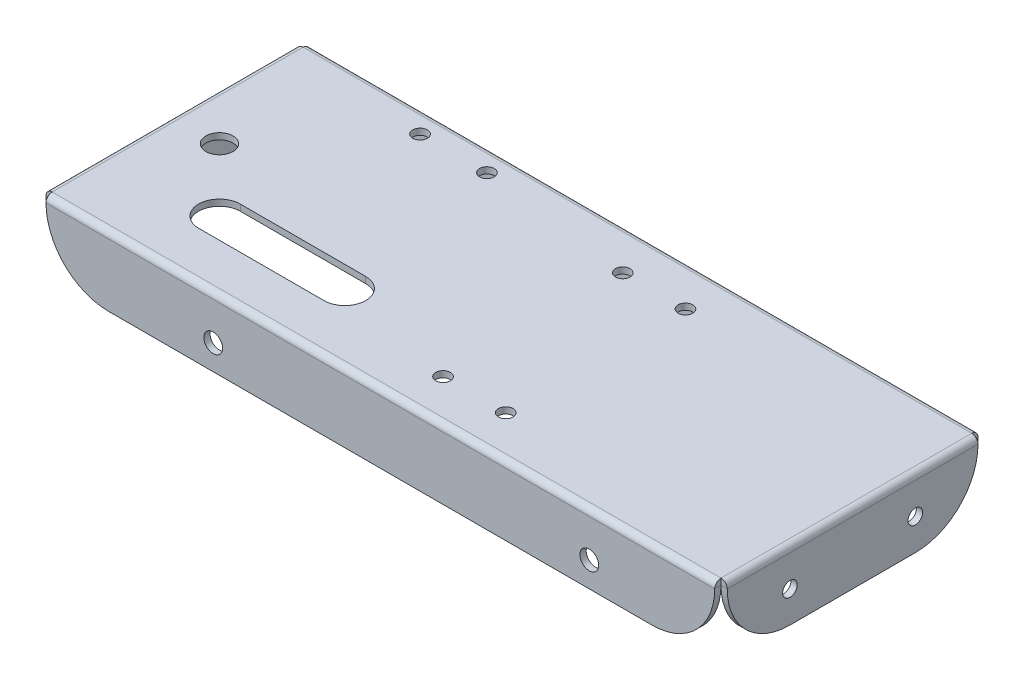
ISO-10303-21;
HEADER;
FILE_DESCRIPTION(('STEP AP214'),'2;1');
FILE_NAME('part.step','',(''),(''),'','','');
FILE_SCHEMA(('AUTOMOTIVE_DESIGN { 1 0 10303 214 1 1 1 1 }'));
ENDSEC;
DATA;
#1=APPLICATION_CONTEXT('core data for automotive mechanical design processes');
#2=APPLICATION_PROTOCOL_DEFINITION('international standard','automotive_design',2000,#1);
#3=PRODUCT_CONTEXT('',#1,'mechanical');
#4=PRODUCT('Part','Part','',(#3));
#5=PRODUCT_RELATED_PRODUCT_CATEGORY('part','',(#4));
#6=PRODUCT_DEFINITION_FORMATION('','',#4);
#7=PRODUCT_DEFINITION_CONTEXT('part definition',#1,'design');
#8=PRODUCT_DEFINITION('design','',#6,#7);
#9=PRODUCT_DEFINITION_SHAPE('','',#8);
#10=(LENGTH_UNIT() NAMED_UNIT(*) SI_UNIT(.MILLI.,.METRE.));
#11=(NAMED_UNIT(*) PLANE_ANGLE_UNIT() SI_UNIT($,.RADIAN.));
#12=(NAMED_UNIT(*) SI_UNIT($,.STERADIAN.) SOLID_ANGLE_UNIT());
#13=UNCERTAINTY_MEASURE_WITH_UNIT(LENGTH_MEASURE(1.E-05),#10,'distance_accuracy_value','');
#14=(GEOMETRIC_REPRESENTATION_CONTEXT(3) GLOBAL_UNCERTAINTY_ASSIGNED_CONTEXT((#13)) GLOBAL_UNIT_ASSIGNED_CONTEXT((#10,
#11,#12)) REPRESENTATION_CONTEXT('',''));
#15=CARTESIAN_POINT('',(0.,0.,0.));
#16=DIRECTION('',(0.,0.,1.));
#17=DIRECTION('',(1.,0.,0.));
#18=AXIS2_PLACEMENT_3D('',#15,#16,#17);
#19=CARTESIAN_POINT('',(15.,1.5,0.));
#20=DIRECTION('',(0.,1.,0.));
#21=DIRECTION('',(0.,0.,1.));
#22=AXIS2_PLACEMENT_3D('',#19,#20,#21);
#23=PLANE('',#22);
#24=CARTESIAN_POINT('',(100.,1.5,-8.5));
#25=DIRECTION('',(0.,1.,0.));
#26=DIRECTION('',(0.,0.,1.));
#27=AXIS2_PLACEMENT_3D('',#24,#25,#26);
#28=CIRCLE('',#27,1.75);
#29=CARTESIAN_POINT('',(100.,1.5,-6.75));
#30=VERTEX_POINT('',#29);
#31=EDGE_CURVE('E632',#30,#30,#28,.T.);
#32=ORIENTED_EDGE('',*,*,#31,.F.);
#33=EDGE_LOOP('',(#32));
#34=FACE_BOUND('',#33,.T.);
#35=CARTESIAN_POINT('',(85.,1.5,-51.5));
#36=DIRECTION('',(0.,1.,0.));
#37=DIRECTION('',(0.,0.,1.));
#38=AXIS2_PLACEMENT_3D('',#35,#36,#37);
#39=CIRCLE('',#38,1.75);
#40=CARTESIAN_POINT('',(85.,1.5,-49.75));
#41=VERTEX_POINT('',#40);
#42=EDGE_CURVE('E644',#41,#41,#39,.T.);
#43=ORIENTED_EDGE('',*,*,#42,.F.);
#44=EDGE_LOOP('',(#43));
#45=FACE_BOUND('',#44,.T.);
#46=CARTESIAN_POINT('',(48.,1.5,-56.));
#47=DIRECTION('',(0.,1.,0.));
#48=DIRECTION('',(0.,0.,1.));
#49=AXIS2_PLACEMENT_3D('',#46,#47,#48);
#50=CIRCLE('',#49,1.75);
#51=CARTESIAN_POINT('',(48.,1.5,-54.25));
#52=VERTEX_POINT('',#51);
#53=EDGE_CURVE('E656',#52,#52,#50,.T.);
#54=ORIENTED_EDGE('',*,*,#53,.F.);
#55=EDGE_LOOP('',(#54));
#56=FACE_BOUND('',#55,.T.);
#57=CARTESIAN_POINT('',(10.,1.5,-30.));
#58=DIRECTION('',(0.,1.,0.));
#59=DIRECTION('',(0.,0.,1.));
#60=AXIS2_PLACEMENT_3D('',#57,#58,#59);
#61=CIRCLE('',#60,3.25);
#62=CARTESIAN_POINT('',(10.,1.5,-26.75));
#63=VERTEX_POINT('',#62);
#64=EDGE_CURVE('E668',#63,#63,#61,.T.);
#65=ORIENTED_EDGE('',*,*,#64,.F.);
#66=EDGE_LOOP('',(#65));
#67=FACE_BOUND('',#66,.T.);
#68=CARTESIAN_POINT('',(32.,1.5,-56.));
#69=DIRECTION('',(0.,1.,0.));
#70=DIRECTION('',(0.,0.,1.));
#71=AXIS2_PLACEMENT_3D('',#68,#69,#70);
#72=CIRCLE('',#71,1.75);
#73=CARTESIAN_POINT('',(32.,1.5,-54.25));
#74=VERTEX_POINT('',#73);
#75=EDGE_CURVE('E662',#74,#74,#72,.T.);
#76=ORIENTED_EDGE('',*,*,#75,.F.);
#77=EDGE_LOOP('',(#76));
#78=FACE_BOUND('',#77,.T.);
#79=CARTESIAN_POINT('',(100.,1.5,-51.5));
#80=DIRECTION('',(0.,1.,0.));
#81=DIRECTION('',(0.,0.,1.));
#82=AXIS2_PLACEMENT_3D('',#79,#80,#81);
#83=CIRCLE('',#82,1.75);
#84=CARTESIAN_POINT('',(100.,1.5,-49.75));
#85=VERTEX_POINT('',#84);
#86=EDGE_CURVE('E650',#85,#85,#83,.T.);
#87=ORIENTED_EDGE('',*,*,#86,.F.);
#88=EDGE_LOOP('',(#87));
#89=FACE_BOUND('',#88,.T.);
#90=CARTESIAN_POINT('',(85.,1.5,-8.5));
#91=DIRECTION('',(0.,1.,0.));
#92=DIRECTION('',(0.,0.,1.));
#93=AXIS2_PLACEMENT_3D('',#90,#91,#92);
#94=CIRCLE('',#93,1.75);
#95=CARTESIAN_POINT('',(85.,1.5,-6.75000000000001));
#96=VERTEX_POINT('',#95);
#97=EDGE_CURVE('E638',#96,#96,#94,.T.);
#98=ORIENTED_EDGE('',*,*,#97,.F.);
#99=EDGE_LOOP('',(#98));
#100=FACE_BOUND('',#99,.T.);
#101=DIRECTION('',(1.,0.,0.));
#102=VECTOR('',#101,1.);
#103=CARTESIAN_POINT('',(25.,1.5,-10.));
#104=LINE('',#103,#102);
#105=CARTESIAN_POINT('',(25.,1.5,-10.));
#106=VERTEX_POINT('',#105);
#107=CARTESIAN_POINT('',(55.,1.5,-10.));
#108=VERTEX_POINT('',#107);
#109=EDGE_CURVE('E602',#106,#108,#104,.T.);
#110=ORIENTED_EDGE('',*,*,#109,.F.);
#111=CARTESIAN_POINT('',(25.,1.5,-15.));
#112=DIRECTION('',(0.,1.,0.));
#113=DIRECTION('',(0.,0.,1.));
#114=AXIS2_PLACEMENT_3D('',#111,#112,#113);
#115=CIRCLE('',#114,5.);
#116=CARTESIAN_POINT('',(25.,1.5,-20.));
#117=VERTEX_POINT('',#116);
#118=EDGE_CURVE('E595',#117,#106,#115,.T.);
#119=ORIENTED_EDGE('',*,*,#118,.F.);
#120=DIRECTION('',(-1.,0.,0.));
#121=VECTOR('',#120,1.);
#122=CARTESIAN_POINT('',(25.,1.5,-20.));
#123=LINE('',#122,#121);
#124=CARTESIAN_POINT('',(55.,1.5,-20.));
#125=VERTEX_POINT('',#124);
#126=EDGE_CURVE('E608',#125,#117,#123,.T.);
#127=ORIENTED_EDGE('',*,*,#126,.F.);
#128=CARTESIAN_POINT('',(55.,1.5,-15.));
#129=DIRECTION('',(0.,1.,0.));
#130=DIRECTION('',(0.,0.,1.));
#131=AXIS2_PLACEMENT_3D('',#128,#129,#130);
#132=CIRCLE('',#131,5.);
#133=EDGE_CURVE('E605',#108,#125,#132,.T.);
#134=ORIENTED_EDGE('',*,*,#133,.F.);
#135=EDGE_LOOP('',(#110,#119,#127,#134));
#136=FACE_BOUND('',#135,.T.);
#137=DIRECTION('',(-1.,0.,0.));
#138=VECTOR('',#137,1.);
#139=CARTESIAN_POINT('',(15.,1.5,-60.));
#140=LINE('',#139,#138);
#141=CARTESIAN_POINT('',(160.,1.5,-60.));
#142=VERTEX_POINT('',#141);
#143=CARTESIAN_POINT('',(2.7163968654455E-12,1.5,-60.));
#144=VERTEX_POINT('',#143);
#145=EDGE_CURVE('E671',#142,#144,#140,.T.);
#146=ORIENTED_EDGE('',*,*,#145,.T.);
#147=DIRECTION('',(0.,0.,1.));
#148=VECTOR('',#147,1.);
#149=CARTESIAN_POINT('',(0.,1.5,0.));
#150=LINE('',#149,#148);
#151=CARTESIAN_POINT('',(0.,1.5,0.));
#152=VERTEX_POINT('',#151);
#153=EDGE_CURVE('E695',#144,#152,#150,.T.);
#154=ORIENTED_EDGE('',*,*,#153,.T.);
#155=DIRECTION('',(-1.,0.,0.));
#156=VECTOR('',#155,1.);
#157=CARTESIAN_POINT('',(15.,1.5,0.));
#158=LINE('',#157,#156);
#159=CARTESIAN_POINT('',(160.,1.5,9.64506252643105E-13));
#160=VERTEX_POINT('',#159);
#161=EDGE_CURVE('E679',#160,#152,#158,.T.);
#162=ORIENTED_EDGE('',*,*,#161,.F.);
#163=DIRECTION('',(0.,0.,1.));
#164=VECTOR('',#163,1.);
#165=CARTESIAN_POINT('',(160.,1.5,0.));
#166=LINE('',#165,#164);
#167=EDGE_CURVE('E685',#142,#160,#166,.T.);
#168=ORIENTED_EDGE('',*,*,#167,.F.);
#169=EDGE_LOOP('',(#146,#154,#162,#168));
#170=FACE_BOUND('',#169,.T.);
#171=ADVANCED_FACE('F98',(#34,#45,#56,#67,#78,#89,#100,#136,#170),#23,.T.);
#172=CARTESIAN_POINT('',(15.,0.,0.));
#173=DIRECTION('',(0.,1.,0.));
#174=DIRECTION('',(0.,0.,1.));
#175=AXIS2_PLACEMENT_3D('',#172,#173,#174);
#176=PLANE('',#175);
#177=DIRECTION('',(0.,0.,1.));
#178=VECTOR('',#177,1.);
#179=CARTESIAN_POINT('',(0.,0.,0.));
#180=LINE('',#179,#178);
#181=CARTESIAN_POINT('',(0.,0.,-60.));
#182=VERTEX_POINT('',#181);
#183=CARTESIAN_POINT('',(0.,0.,0.));
#184=VERTEX_POINT('',#183);
#185=EDGE_CURVE('E106',#182,#184,#180,.T.);
#186=ORIENTED_EDGE('',*,*,#185,.F.);
#187=DIRECTION('',(-1.,0.,0.));
#188=VECTOR('',#187,1.);
#189=CARTESIAN_POINT('',(15.,0.,-60.));
#190=LINE('',#189,#188);
#191=CARTESIAN_POINT('',(160.,0.,-60.));
#192=VERTEX_POINT('',#191);
#193=EDGE_CURVE('E676',#192,#182,#190,.T.);
#194=ORIENTED_EDGE('',*,*,#193,.F.);
#195=DIRECTION('',(0.,0.,1.));
#196=VECTOR('',#195,1.);
#197=CARTESIAN_POINT('',(160.,0.,0.));
#198=LINE('',#197,#196);
#199=CARTESIAN_POINT('',(160.,0.,9.71445146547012E-13));
#200=VERTEX_POINT('',#199);
#201=EDGE_CURVE('E689',#192,#200,#198,.T.);
#202=ORIENTED_EDGE('',*,*,#201,.T.);
#203=DIRECTION('',(-1.,0.,0.));
#204=VECTOR('',#203,1.);
#205=CARTESIAN_POINT('',(15.,0.,0.));
#206=LINE('',#205,#204);
#207=EDGE_CURVE('E682',#200,#184,#206,.T.);
#208=ORIENTED_EDGE('',*,*,#207,.T.);
#209=EDGE_LOOP('',(#186,#194,#202,#208));
#210=FACE_BOUND('',#209,.T.);
#211=CARTESIAN_POINT('',(100.,0.,-8.5));
#212=DIRECTION('',(0.,1.,0.));
#213=DIRECTION('',(0.,0.,1.));
#214=AXIS2_PLACEMENT_3D('',#211,#212,#213);
#215=CIRCLE('',#214,1.75);
#216=CARTESIAN_POINT('',(100.,0.,-6.75));
#217=VERTEX_POINT('',#216);
#218=EDGE_CURVE('E631',#217,#217,#215,.T.);
#219=ORIENTED_EDGE('',*,*,#218,.T.);
#220=EDGE_LOOP('',(#219));
#221=FACE_BOUND('',#220,.T.);
#222=CARTESIAN_POINT('',(85.,0.,-51.5));
#223=DIRECTION('',(0.,1.,0.));
#224=DIRECTION('',(0.,0.,1.));
#225=AXIS2_PLACEMENT_3D('',#222,#223,#224);
#226=CIRCLE('',#225,1.75);
#227=CARTESIAN_POINT('',(85.,0.,-49.75));
#228=VERTEX_POINT('',#227);
#229=EDGE_CURVE('E641',#228,#228,#226,.T.);
#230=ORIENTED_EDGE('',*,*,#229,.T.);
#231=EDGE_LOOP('',(#230));
#232=FACE_BOUND('',#231,.T.);
#233=CARTESIAN_POINT('',(48.,0.,-56.));
#234=DIRECTION('',(0.,1.,0.));
#235=DIRECTION('',(0.,0.,1.));
#236=AXIS2_PLACEMENT_3D('',#233,#234,#235);
#237=CIRCLE('',#236,1.75);
#238=CARTESIAN_POINT('',(48.,0.,-54.25));
#239=VERTEX_POINT('',#238);
#240=EDGE_CURVE('E653',#239,#239,#237,.T.);
#241=ORIENTED_EDGE('',*,*,#240,.T.);
#242=EDGE_LOOP('',(#241));
#243=FACE_BOUND('',#242,.T.);
#244=CARTESIAN_POINT('',(10.,0.,-30.));
#245=DIRECTION('',(0.,1.,0.));
#246=DIRECTION('',(0.,0.,1.));
#247=AXIS2_PLACEMENT_3D('',#244,#245,#246);
#248=CIRCLE('',#247,3.25);
#249=CARTESIAN_POINT('',(10.,0.,-26.75));
#250=VERTEX_POINT('',#249);
#251=EDGE_CURVE('E665',#250,#250,#248,.T.);
#252=ORIENTED_EDGE('',*,*,#251,.T.);
#253=EDGE_LOOP('',(#252));
#254=FACE_BOUND('',#253,.T.);
#255=CARTESIAN_POINT('',(32.,0.,-56.));
#256=DIRECTION('',(0.,1.,0.));
#257=DIRECTION('',(0.,0.,1.));
#258=AXIS2_PLACEMENT_3D('',#255,#256,#257);
#259=CIRCLE('',#258,1.75);
#260=CARTESIAN_POINT('',(32.,0.,-54.25));
#261=VERTEX_POINT('',#260);
#262=EDGE_CURVE('E659',#261,#261,#259,.T.);
#263=ORIENTED_EDGE('',*,*,#262,.T.);
#264=EDGE_LOOP('',(#263));
#265=FACE_BOUND('',#264,.T.);
#266=CARTESIAN_POINT('',(100.,0.,-51.5));
#267=DIRECTION('',(0.,1.,0.));
#268=DIRECTION('',(0.,0.,1.));
#269=AXIS2_PLACEMENT_3D('',#266,#267,#268);
#270=CIRCLE('',#269,1.75);
#271=CARTESIAN_POINT('',(100.,0.,-49.75));
#272=VERTEX_POINT('',#271);
#273=EDGE_CURVE('E647',#272,#272,#270,.T.);
#274=ORIENTED_EDGE('',*,*,#273,.T.);
#275=EDGE_LOOP('',(#274));
#276=FACE_BOUND('',#275,.T.);
#277=CARTESIAN_POINT('',(85.,0.,-8.5));
#278=DIRECTION('',(0.,1.,0.));
#279=DIRECTION('',(0.,0.,1.));
#280=AXIS2_PLACEMENT_3D('',#277,#278,#279);
#281=CIRCLE('',#280,1.75);
#282=CARTESIAN_POINT('',(85.,0.,-6.75000000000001));
#283=VERTEX_POINT('',#282);
#284=EDGE_CURVE('E635',#283,#283,#281,.T.);
#285=ORIENTED_EDGE('',*,*,#284,.T.);
#286=EDGE_LOOP('',(#285));
#287=FACE_BOUND('',#286,.T.);
#288=CARTESIAN_POINT('',(25.,0.,-15.));
#289=DIRECTION('',(0.,1.,0.));
#290=DIRECTION('',(0.,0.,1.));
#291=AXIS2_PLACEMENT_3D('',#288,#289,#290);
#292=CIRCLE('',#291,5.);
#293=CARTESIAN_POINT('',(25.,0.,-20.));
#294=VERTEX_POINT('',#293);
#295=CARTESIAN_POINT('',(25.,0.,-10.));
#296=VERTEX_POINT('',#295);
#297=EDGE_CURVE('E611',#294,#296,#292,.T.);
#298=ORIENTED_EDGE('',*,*,#297,.T.);
#299=DIRECTION('',(1.,0.,0.));
#300=VECTOR('',#299,1.);
#301=CARTESIAN_POINT('',(25.,0.,-10.));
#302=LINE('',#301,#300);
#303=CARTESIAN_POINT('',(55.,0.,-10.));
#304=VERTEX_POINT('',#303);
#305=EDGE_CURVE('E614',#296,#304,#302,.T.);
#306=ORIENTED_EDGE('',*,*,#305,.T.);
#307=CARTESIAN_POINT('',(55.,0.,-15.));
#308=DIRECTION('',(0.,1.,0.));
#309=DIRECTION('',(0.,0.,1.));
#310=AXIS2_PLACEMENT_3D('',#307,#308,#309);
#311=CIRCLE('',#310,5.);
#312=CARTESIAN_POINT('',(55.,0.,-20.));
#313=VERTEX_POINT('',#312);
#314=EDGE_CURVE('E617',#304,#313,#311,.T.);
#315=ORIENTED_EDGE('',*,*,#314,.T.);
#316=DIRECTION('',(-1.,0.,0.));
#317=VECTOR('',#316,1.);
#318=CARTESIAN_POINT('',(25.,0.,-20.));
#319=LINE('',#318,#317);
#320=EDGE_CURVE('E603',#313,#294,#319,.T.);
#321=ORIENTED_EDGE('',*,*,#320,.T.);
#322=EDGE_LOOP('',(#298,#306,#315,#321));
#323=FACE_BOUND('',#322,.T.);
#324=ADVANCED_FACE('F100',(#210,#221,#232,#243,#254,#265,#276,#287,#323),#176,.F.);
#325=CARTESIAN_POINT('',(10.,1.5,-30.));
#326=DIRECTION('',(0.,-1.,0.));
#327=DIRECTION('',(0.,0.,-1.));
#328=AXIS2_PLACEMENT_3D('',#325,#326,#327);
#329=CYLINDRICAL_SURFACE('',#328,3.25);
#330=ORIENTED_EDGE('',*,*,#64,.T.);
#331=EDGE_LOOP('',(#330));
#332=FACE_BOUND('',#331,.T.);
#333=ORIENTED_EDGE('',*,*,#251,.F.);
#334=EDGE_LOOP('',(#333));
#335=FACE_BOUND('',#334,.T.);
#336=ADVANCED_FACE('F784',(#332,#335),#329,.F.);
#337=CARTESIAN_POINT('',(32.,1.5,-56.));
#338=DIRECTION('',(0.,-1.,0.));
#339=DIRECTION('',(0.,0.,-1.));
#340=AXIS2_PLACEMENT_3D('',#337,#338,#339);
#341=CYLINDRICAL_SURFACE('',#340,1.75);
#342=ORIENTED_EDGE('',*,*,#75,.T.);
#343=EDGE_LOOP('',(#342));
#344=FACE_BOUND('',#343,.T.);
#345=ORIENTED_EDGE('',*,*,#262,.F.);
#346=EDGE_LOOP('',(#345));
#347=FACE_BOUND('',#346,.T.);
#348=ADVANCED_FACE('F790',(#344,#347),#341,.F.);
#349=CARTESIAN_POINT('',(48.,1.5,-56.));
#350=DIRECTION('',(0.,-1.,0.));
#351=DIRECTION('',(0.,0.,-1.));
#352=AXIS2_PLACEMENT_3D('',#349,#350,#351);
#353=CYLINDRICAL_SURFACE('',#352,1.75);
#354=ORIENTED_EDGE('',*,*,#53,.T.);
#355=EDGE_LOOP('',(#354));
#356=FACE_BOUND('',#355,.T.);
#357=ORIENTED_EDGE('',*,*,#240,.F.);
#358=EDGE_LOOP('',(#357));
#359=FACE_BOUND('',#358,.T.);
#360=ADVANCED_FACE('F794',(#356,#359),#353,.F.);
#361=CARTESIAN_POINT('',(100.,1.5,-51.5));
#362=DIRECTION('',(0.,-1.,0.));
#363=DIRECTION('',(0.,0.,-1.));
#364=AXIS2_PLACEMENT_3D('',#361,#362,#363);
#365=CYLINDRICAL_SURFACE('',#364,1.75);
#366=ORIENTED_EDGE('',*,*,#86,.T.);
#367=EDGE_LOOP('',(#366));
#368=FACE_BOUND('',#367,.T.);
#369=ORIENTED_EDGE('',*,*,#273,.F.);
#370=EDGE_LOOP('',(#369));
#371=FACE_BOUND('',#370,.T.);
#372=ADVANCED_FACE('F798',(#368,#371),#365,.F.);
#373=CARTESIAN_POINT('',(85.,1.5,-51.5));
#374=DIRECTION('',(0.,-1.,0.));
#375=DIRECTION('',(0.,0.,-1.));
#376=AXIS2_PLACEMENT_3D('',#373,#374,#375);
#377=CYLINDRICAL_SURFACE('',#376,1.75);
#378=ORIENTED_EDGE('',*,*,#42,.T.);
#379=EDGE_LOOP('',(#378));
#380=FACE_BOUND('',#379,.T.);
#381=ORIENTED_EDGE('',*,*,#229,.F.);
#382=EDGE_LOOP('',(#381));
#383=FACE_BOUND('',#382,.T.);
#384=ADVANCED_FACE('F802',(#380,#383),#377,.F.);
#385=CARTESIAN_POINT('',(85.,1.5,-8.5));
#386=DIRECTION('',(0.,-1.,0.));
#387=DIRECTION('',(0.,0.,-1.));
#388=AXIS2_PLACEMENT_3D('',#385,#386,#387);
#389=CYLINDRICAL_SURFACE('',#388,1.75);
#390=ORIENTED_EDGE('',*,*,#97,.T.);
#391=EDGE_LOOP('',(#390));
#392=FACE_BOUND('',#391,.T.);
#393=ORIENTED_EDGE('',*,*,#284,.F.);
#394=EDGE_LOOP('',(#393));
#395=FACE_BOUND('',#394,.T.);
#396=ADVANCED_FACE('F806',(#392,#395),#389,.F.);
#397=CARTESIAN_POINT('',(100.,1.5,-8.5));
#398=DIRECTION('',(0.,-1.,0.));
#399=DIRECTION('',(0.,0.,-1.));
#400=AXIS2_PLACEMENT_3D('',#397,#398,#399);
#401=CYLINDRICAL_SURFACE('',#400,1.75);
#402=ORIENTED_EDGE('',*,*,#31,.T.);
#403=EDGE_LOOP('',(#402));
#404=FACE_BOUND('',#403,.T.);
#405=ORIENTED_EDGE('',*,*,#218,.F.);
#406=EDGE_LOOP('',(#405));
#407=FACE_BOUND('',#406,.T.);
#408=ADVANCED_FACE('F810',(#404,#407),#401,.F.);
#409=CARTESIAN_POINT('',(25.,1.5,-15.));
#410=DIRECTION('',(0.,-1.,0.));
#411=DIRECTION('',(0.,0.,-1.));
#412=AXIS2_PLACEMENT_3D('',#409,#410,#411);
#413=CYLINDRICAL_SURFACE('',#412,5.);
#414=ORIENTED_EDGE('',*,*,#297,.F.);
#415=DIRECTION('',(0.,-1.,0.));
#416=VECTOR('',#415,1.);
#417=CARTESIAN_POINT('',(25.,1.5,-20.));
#418=LINE('',#417,#416);
#419=EDGE_CURVE('E610',#117,#294,#418,.T.);
#420=ORIENTED_EDGE('',*,*,#419,.F.);
#421=ORIENTED_EDGE('',*,*,#118,.T.);
#422=DIRECTION('',(0.,-1.,0.));
#423=VECTOR('',#422,1.);
#424=CARTESIAN_POINT('',(25.,1.5,-10.));
#425=LINE('',#424,#423);
#426=EDGE_CURVE('E628',#106,#296,#425,.T.);
#427=ORIENTED_EDGE('',*,*,#426,.T.);
#428=EDGE_LOOP('',(#414,#420,#421,#427));
#429=FACE_BOUND('',#428,.T.);
#430=ADVANCED_FACE('F814',(#429),#413,.F.);
#431=CARTESIAN_POINT('',(25.,1.5,-10.));
#432=DIRECTION('',(0.,0.,-1.));
#433=DIRECTION('',(-1.,0.,0.));
#434=AXIS2_PLACEMENT_3D('',#431,#432,#433);
#435=PLANE('',#434);
#436=ORIENTED_EDGE('',*,*,#305,.F.);
#437=ORIENTED_EDGE('',*,*,#426,.F.);
#438=ORIENTED_EDGE('',*,*,#109,.T.);
#439=DIRECTION('',(0.,-1.,0.));
#440=VECTOR('',#439,1.);
#441=CARTESIAN_POINT('',(55.,1.5,-10.));
#442=LINE('',#441,#440);
#443=EDGE_CURVE('E626',#108,#304,#442,.T.);
#444=ORIENTED_EDGE('',*,*,#443,.T.);
#445=EDGE_LOOP('',(#436,#437,#438,#444));
#446=FACE_BOUND('',#445,.T.);
#447=ADVANCED_FACE('F818',(#446),#435,.T.);
#448=CARTESIAN_POINT('',(55.,1.5,-15.));
#449=DIRECTION('',(0.,-1.,0.));
#450=DIRECTION('',(0.,0.,-1.));
#451=AXIS2_PLACEMENT_3D('',#448,#449,#450);
#452=CYLINDRICAL_SURFACE('',#451,5.);
#453=ORIENTED_EDGE('',*,*,#314,.F.);
#454=ORIENTED_EDGE('',*,*,#443,.F.);
#455=ORIENTED_EDGE('',*,*,#133,.T.);
#456=DIRECTION('',(0.,-1.,0.));
#457=VECTOR('',#456,1.);
#458=CARTESIAN_POINT('',(55.,1.5,-20.));
#459=LINE('',#458,#457);
#460=EDGE_CURVE('E624',#125,#313,#459,.T.);
#461=ORIENTED_EDGE('',*,*,#460,.T.);
#462=EDGE_LOOP('',(#453,#454,#455,#461));
#463=FACE_BOUND('',#462,.T.);
#464=ADVANCED_FACE('F822',(#463),#452,.F.);
#465=CARTESIAN_POINT('',(25.,1.5,-20.));
#466=DIRECTION('',(0.,0.,1.));
#467=DIRECTION('',(1.,0.,0.));
#468=AXIS2_PLACEMENT_3D('',#465,#466,#467);
#469=PLANE('',#468);
#470=ORIENTED_EDGE('',*,*,#320,.F.);
#471=ORIENTED_EDGE('',*,*,#460,.F.);
#472=ORIENTED_EDGE('',*,*,#126,.T.);
#473=ORIENTED_EDGE('',*,*,#419,.T.);
#474=EDGE_LOOP('',(#470,#471,#472,#473));
#475=FACE_BOUND('',#474,.T.);
#476=ADVANCED_FACE('F826',(#475),#469,.T.);
#477=CARTESIAN_POINT('',(160.,-0.000999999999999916,-60.));
#478=DIRECTION('',(1.,0.,0.));
#479=DIRECTION('',(0.,0.,-1.));
#480=AXIS2_PLACEMENT_3D('',#477,#478,#479);
#481=PLANE('',#480);
#482=DIRECTION('',(0.,-1.,0.));
#483=VECTOR('',#482,1.);
#484=CARTESIAN_POINT('',(160.,1.5,-60.));
#485=LINE('',#484,#483);
#486=EDGE_CURVE('E692',#142,#192,#485,.T.);
#487=ORIENTED_EDGE('',*,*,#486,.T.);
#488=CARTESIAN_POINT('',(160.,0.,-60.));
#489=CARTESIAN_POINT('',(159.999999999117,3.47088957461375E-10,-60.0000163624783));
#490=CARTESIAN_POINT('',(159.999999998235,-4.01582874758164E-07,-60.000032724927));
#491=CARTESIAN_POINT('',(159.99999999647,-2.00750471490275E-06,-60.0000654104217));
#492=CARTESIAN_POINT('',(159.999999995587,-3.21149659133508E-06,-60.0000817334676));
#493=CARTESIAN_POINT('',(159.999999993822,-6.41905006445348E-06,-60.000114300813));
#494=CARTESIAN_POINT('',(159.999999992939,-8.42261166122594E-06,-60.0001305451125));
#495=CARTESIAN_POINT('',(159.999999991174,-1.322436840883E-05,-60.0001629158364));
#496=CARTESIAN_POINT('',(159.999999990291,-1.60225635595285E-05,-60.0001790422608));
#497=CARTESIAN_POINT('',(159.999999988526,-2.24068756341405E-05,-60.0002111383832));
#498=CARTESIAN_POINT('',(159.999999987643,-2.59929925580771E-05,-60.0002271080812));
#499=CARTESIAN_POINT('',(159.999999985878,-3.3944501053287E-05,-60.0002588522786));
#500=CARTESIAN_POINT('',(159.999999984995,-3.83098926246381E-05,-60.0002746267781));
#501=CARTESIAN_POINT('',(159.99999998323,-4.78094359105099E-05,-60.0003059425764));
#502=CARTESIAN_POINT('',(159.999999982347,-5.29435876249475E-05,-60.0003214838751));
#503=CARTESIAN_POINT('',(159.999999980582,-6.39682820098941E-05,-60.0003522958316));
#504=CARTESIAN_POINT('',(159.999999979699,-6.98588246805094E-05,-60.0003675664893));
#505=CARTESIAN_POINT('',(159.999999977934,-8.23821102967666E-05,-60.0003978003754));
#506=CARTESIAN_POINT('',(159.999999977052,-8.90148532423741E-05,-60.0004127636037));
#507=CARTESIAN_POINT('',(159.999999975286,-0.000103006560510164,-60.0004423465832));
#508=CARTESIAN_POINT('',(159.999999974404,-0.000110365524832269,-60.0004569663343));
#509=CARTESIAN_POINT('',(159.999999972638,-0.000125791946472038,-60.0004858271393));
#510=CARTESIAN_POINT('',(159.999999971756,-0.000133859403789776,-60.0005000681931));
#511=CARTESIAN_POINT('',(159.999999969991,-0.000150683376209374,-60.0005281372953));
#512=CARTESIAN_POINT('',(159.999999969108,-0.000159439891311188,-60.0005419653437));
#513=CARTESIAN_POINT('',(159.999999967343,-0.000177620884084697,-60.0005691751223));
#514=CARTESIAN_POINT('',(159.99999996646,-0.000187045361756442,-60.0005825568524));
#515=CARTESIAN_POINT('',(159.999999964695,-0.000206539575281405,-60.0006088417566));
#516=CARTESIAN_POINT('',(159.999999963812,-0.000216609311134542,-60.0006217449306));
#517=CARTESIAN_POINT('',(159.999999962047,-0.000237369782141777,-60.0006470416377));
#518=CARTESIAN_POINT('',(159.999999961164,-0.000248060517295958,-60.0006594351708));
#519=CARTESIAN_POINT('',(159.999999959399,-0.000270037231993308,-60.0006836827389));
#520=CARTESIAN_POINT('',(159.999999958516,-0.000281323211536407,-60.0006955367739));
#521=CARTESIAN_POINT('',(159.999999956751,-0.000304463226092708,-60.0007186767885));
#522=CARTESIAN_POINT('',(159.999999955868,-0.000316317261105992,-60.000729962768));
#523=CARTESIAN_POINT('',(159.999999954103,-0.000340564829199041,-60.0007519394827));
#524=CARTESIAN_POINT('',(159.999999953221,-0.000352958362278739,-60.0007626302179));
#525=CARTESIAN_POINT('',(159.999999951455,-0.000378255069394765,-60.0007833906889));
#526=CARTESIAN_POINT('',(159.999999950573,-0.0003911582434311,-60.0007934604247));
#527=CARTESIAN_POINT('',(159.999999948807,-0.000417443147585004,-60.0008129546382));
#528=CARTESIAN_POINT('',(159.999999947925,-0.000430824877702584,-60.0008223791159));
#529=CARTESIAN_POINT('',(159.99999994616,-0.000458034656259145,-60.0008405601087));
#530=CARTESIAN_POINT('',(159.999999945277,-0.000471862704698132,-60.0008493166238));
#531=CARTESIAN_POINT('',(159.999999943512,-0.000499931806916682,-60.0008661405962));
#532=CARTESIAN_POINT('',(159.999999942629,-0.000514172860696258,-60.0008742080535));
#533=CARTESIAN_POINT('',(159.999999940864,-0.000543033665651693,-60.0008896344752));
#534=CARTESIAN_POINT('',(159.999999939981,-0.000557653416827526,-60.0008969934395));
#535=CARTESIAN_POINT('',(159.999999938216,-0.000587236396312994,-60.0009109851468));
#536=CARTESIAN_POINT('',(159.999999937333,-0.000602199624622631,-60.0009176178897));
#537=CARTESIAN_POINT('',(159.999999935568,-0.000632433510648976,-60.0009301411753));
#538=CARTESIAN_POINT('',(159.999999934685,-0.0006477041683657,-60.000936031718));
#539=CARTESIAN_POINT('',(159.99999993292,-0.000678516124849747,-60.0009470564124));
#540=CARTESIAN_POINT('',(159.999999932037,-0.000694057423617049,-60.0009521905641));
#541=CARTESIAN_POINT('',(159.999999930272,-0.000725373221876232,-60.0009616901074));
#542=CARTESIAN_POINT('',(159.99999992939,-0.000741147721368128,-60.0009660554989));
#543=CARTESIAN_POINT('',(159.999999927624,-0.00077289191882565,-60.0009740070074));
#544=CARTESIAN_POINT('',(159.999999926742,-0.000788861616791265,-60.0009775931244));
#545=CARTESIAN_POINT('',(159.999999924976,-0.000820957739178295,-60.0009839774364));
#546=CARTESIAN_POINT('',(159.999999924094,-0.000837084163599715,-60.0009867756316));
#547=CARTESIAN_POINT('',(159.999999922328,-0.000869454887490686,-60.0009915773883));
#548=CARTESIAN_POINT('',(159.999999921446,-0.000885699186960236,-60.0009935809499));
#549=CARTESIAN_POINT('',(159.999999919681,-0.000918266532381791,-60.0009967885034));
#550=CARTESIAN_POINT('',(159.999999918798,-0.000934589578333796,-60.0009979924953));
#551=CARTESIAN_POINT('',(159.999999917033,-0.000967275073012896,-60.0009995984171));
#552=CARTESIAN_POINT('',(159.99999991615,-0.000983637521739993,-60.0010000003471));
#553=CARTESIAN_POINT('',(159.999999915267,-0.00100000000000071,-60.001));
#554=B_SPLINE_CURVE_WITH_KNOTS('',3,(#488,#489,#490,#491,#492,#493,#494,#495,#496,#497,#498,
#499,#500,#501,#502,#503,#504,#505,#506,#507,#508,#509,#510,#511,#512,#513,#514,#515,#516,#517,
#518,#519,#520,#521,#522,#523,#524,#525,#526,#527,#528,#529,#530,#531,#532,#533,#534,#535,#536,
#537,#538,#539,#540,#541,#542,#543,#544,#545,#546,#547,#548,#549,#550,#551,#552,#553),
.UNSPECIFIED.,.F.,.F.,(4,2,2,2,2,2,2,2,2,2,2,2,2,2,2,2,2,2,2,2,2,2,2,2,2,2,2,2,2,2,2,2,4),(0.,
4.90824571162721E-05,9.81649142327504E-05,0.000147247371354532,0.000196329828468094,
0.000245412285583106,0.000294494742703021,0.00034357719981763,0.000392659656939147,
0.000441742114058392,0.000490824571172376,0.000539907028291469,0.00058898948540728,
0.000638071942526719,0.000687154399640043,0.000736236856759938,0.000785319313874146,
0.000834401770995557,0.000883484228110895,0.00093256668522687,0.000981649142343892,
0.00103073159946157,0.0010798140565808,0.00112889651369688,0.00117797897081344,
0.00122706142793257,0.00127614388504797,0.00132522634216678,0.00137430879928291,
0.00142339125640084,0.00147247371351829,0.00152155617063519,0.00157063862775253),.UNSPECIFIED.);
#555=CARTESIAN_POINT('',(159.999999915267,-0.001000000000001,-60.001));
#556=VERTEX_POINT('',#555);
#557=EDGE_CURVE('E517',#192,#556,#554,.T.);
#558=ORIENTED_EDGE('',*,*,#557,.T.);
#559=DIRECTION('',(0.,0.,1.));
#560=VECTOR('',#559,1.);
#561=CARTESIAN_POINT('',(159.999999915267,-0.00100000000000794,-61.501));
#562=LINE('',#561,#560);
#563=CARTESIAN_POINT('',(159.999999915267,-0.00100000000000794,-61.501));
#564=VERTEX_POINT('',#563);
#565=EDGE_CURVE('E533',#564,#556,#562,.T.);
#566=ORIENTED_EDGE('',*,*,#565,.F.);
#567=CARTESIAN_POINT('',(160.,1.5,-60.));
#568=CARTESIAN_POINT('',(159.999999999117,1.50000052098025,-60.0245600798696));
#569=CARTESIAN_POINT('',(159.999999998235,1.49939722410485,-60.0491201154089));
#570=CARTESIAN_POINT('',(159.99999999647,1.49698673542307,-60.0981810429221));
#571=CARTESIAN_POINT('',(159.999999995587,1.49517954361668,-60.122681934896));
#572=CARTESIAN_POINT('',(159.999999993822,1.49036500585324,-60.1715655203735));
#573=CARTESIAN_POINT('',(159.999999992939,1.48735765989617,-60.1959482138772));
#574=CARTESIAN_POINT('',(159.999999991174,1.48015022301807,-60.244536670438));
#575=CARTESIAN_POINT('',(159.999999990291,1.47595013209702,-60.2687424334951));
#576=CARTESIAN_POINT('',(159.999999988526,1.46636727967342,-60.3169187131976));
#577=CARTESIAN_POINT('',(159.999999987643,1.46098451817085,-60.340889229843));
#578=CARTESIAN_POINT('',(159.999999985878,1.44904930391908,-60.388537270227));
#579=CARTESIAN_POINT('',(159.999999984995,1.44249685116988,-60.4122147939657));
#580=CARTESIAN_POINT('',(159.99999998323,1.42823803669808,-60.4592198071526));
#581=CARTESIAN_POINT('',(159.999999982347,1.42053167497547,-60.4825472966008));
#582=CARTESIAN_POINT('',(159.999999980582,1.40398360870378,-60.5287960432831));
#583=CARTESIAN_POINT('',(159.999999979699,1.39514190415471,-60.5517173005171));
#584=CARTESIAN_POINT('',(159.999999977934,1.37634445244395,-60.5970983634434));
#585=CARTESIAN_POINT('',(159.999999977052,1.36638870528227,-60.6195581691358));
#586=CARTESIAN_POINT('',(159.999999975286,1.34538715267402,-60.6639622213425));
#587=CARTESIAN_POINT('',(159.999999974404,1.33434134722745,-60.685906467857));
#588=CARTESIAN_POINT('',(159.999999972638,1.31118628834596,-60.7292265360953));
#589=CARTESIAN_POINT('',(159.999999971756,1.29907703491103,-60.7506023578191));
#590=CARTESIAN_POINT('',(159.999999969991,1.27382425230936,-60.7927340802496));
#591=CARTESIAN_POINT('',(159.999999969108,1.26068072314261,-60.8134899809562));
#592=CARTESIAN_POINT('',(159.999999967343,1.23339105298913,-60.8543318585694));
#593=CARTESIAN_POINT('',(159.99999996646,1.21924491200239,-60.8744178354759));
#594=CARTESIAN_POINT('',(159.999999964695,1.18998409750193,-60.9138714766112));
#595=CARTESIAN_POINT('',(159.999999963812,1.1748694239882,-60.9332391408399));
#596=CARTESIAN_POINT('',(159.999999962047,1.14370795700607,-60.9712094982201));
#597=CARTESIAN_POINT('',(159.999999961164,1.12766116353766,-60.9898121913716));
#598=CARTESIAN_POINT('',(159.999999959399,1.09467411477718,-61.02620779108));
#599=CARTESIAN_POINT('',(159.999999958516,1.0777338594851,-61.0440006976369));
#600=CARTESIAN_POINT('',(159.999999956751,1.04300069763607,-61.0787338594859));
#601=CARTESIAN_POINT('',(159.999999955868,1.02520779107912,-61.095674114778));
#602=CARTESIAN_POINT('',(159.999999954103,0.988812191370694,-61.1286611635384));
#603=CARTESIAN_POINT('',(159.999999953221,0.970209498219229,-61.1447079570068));
#604=CARTESIAN_POINT('',(159.999999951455,0.932239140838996,-61.1758694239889));
#605=CARTESIAN_POINT('',(159.999999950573,0.912871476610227,-61.1909840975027));
#606=CARTESIAN_POINT('',(159.999999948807,0.873417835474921,-61.2202449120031));
#607=CARTESIAN_POINT('',(159.999999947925,0.853331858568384,-61.2343910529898));
#608=CARTESIAN_POINT('',(159.99999994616,0.812489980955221,-61.2616807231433));
#609=CARTESIAN_POINT('',(159.999999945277,0.791734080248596,-61.27482425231));
#610=CARTESIAN_POINT('',(159.999999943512,0.749602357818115,-61.3000770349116));
#611=CARTESIAN_POINT('',(159.999999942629,0.728226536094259,-61.3121862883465));
#612=CARTESIAN_POINT('',(159.999999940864,0.684906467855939,-61.335341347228));
#613=CARTESIAN_POINT('',(159.999999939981,0.662962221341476,-61.3463871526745));
#614=CARTESIAN_POINT('',(159.999999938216,0.618558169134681,-61.3673887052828));
#615=CARTESIAN_POINT('',(159.999999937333,0.596098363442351,-61.3773444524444));
#616=CARTESIAN_POINT('',(159.999999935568,0.550717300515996,-61.3961419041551));
#617=CARTESIAN_POINT('',(159.999999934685,0.527796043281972,-61.4049836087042));
#618=CARTESIAN_POINT('',(159.99999993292,0.481547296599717,-61.4215316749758));
#619=CARTESIAN_POINT('',(159.999999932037,0.458219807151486,-61.4292380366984));
#620=CARTESIAN_POINT('',(159.999999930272,0.411214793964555,-61.4434968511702));
#621=CARTESIAN_POINT('',(159.99999992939,0.387537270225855,-61.4500493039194));
#622=CARTESIAN_POINT('',(159.999999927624,0.33988922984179,-61.4619845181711));
#623=CARTESIAN_POINT('',(159.999999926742,0.315918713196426,-61.4673672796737));
#624=CARTESIAN_POINT('',(159.999999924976,0.267742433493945,-61.4769501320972));
#625=CARTESIAN_POINT('',(159.999999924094,0.243536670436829,-61.4811502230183));
#626=CARTESIAN_POINT('',(159.999999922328,0.194948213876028,-61.4883576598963));
#627=CARTESIAN_POINT('',(159.999999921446,0.170565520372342,-61.4913650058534));
#628=CARTESIAN_POINT('',(159.999999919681,0.121681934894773,-61.4961795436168));
#629=CARTESIAN_POINT('',(159.999999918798,0.0971810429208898,-61.4979867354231));
#630=CARTESIAN_POINT('',(159.999999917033,0.0481201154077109,-61.5003972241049));
#631=CARTESIAN_POINT('',(159.99999991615,0.0235600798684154,-61.5010005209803));
#632=CARTESIAN_POINT('',(159.999999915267,-0.00100000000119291,-61.501));
#633=B_SPLINE_CURVE_WITH_KNOTS('',3,(#567,#568,#569,#570,#571,#572,#573,#574,#575,#576,#577,
#578,#579,#580,#581,#582,#583,#584,#585,#586,#587,#588,#589,#590,#591,#592,#593,#594,#595,#596,
#597,#598,#599,#600,#601,#602,#603,#604,#605,#606,#607,#608,#609,#610,#611,#612,#613,#614,#615,
#616,#617,#618,#619,#620,#621,#622,#623,#624,#625,#626,#627,#628,#629,#630,#631,#632),
.UNSPECIFIED.,.F.,.F.,(4,2,2,2,2,2,2,2,2,2,2,2,2,2,2,2,2,2,2,2,2,2,2,2,2,2,2,2,2,2,2,2,4),(0.,
0.0736727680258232,0.147345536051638,0.221018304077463,0.294691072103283,0.368363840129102,
0.442036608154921,0.515709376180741,0.58938214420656,0.66305491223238,0.736727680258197,
0.81040044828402,0.884073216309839,0.95774598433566,1.03141875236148,1.1050915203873,
1.17876428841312,1.25243705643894,1.32610982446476,1.39978259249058,1.4734553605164,
1.54712812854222,1.62080089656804,1.69447366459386,1.76814643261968,1.8418192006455,
1.91549196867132,1.98916473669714,2.06283750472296,2.13651027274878,2.2101830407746,
2.28385580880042,2.35752857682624),.UNSPECIFIED.);
#634=EDGE_CURVE('E557',#142,#564,#633,.T.);
#635=ORIENTED_EDGE('',*,*,#634,.F.);
#636=EDGE_LOOP('',(#487,#558,#566,#635));
#637=FACE_BOUND('',#636,.T.);
#638=ADVANCED_FACE('F829',(#637),#481,.T.);
#639=CARTESIAN_POINT('',(8.47326098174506E-08,-0.000999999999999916,-60.));
#640=DIRECTION('',(1.,0.,0.));
#641=DIRECTION('',(0.,0.,-1.));
#642=AXIS2_PLACEMENT_3D('',#639,#640,#641);
#643=PLANE('',#642);
#644=DIRECTION('',(0.,0.,-1.));
#645=VECTOR('',#644,1.);
#646=CARTESIAN_POINT('',(8.47326098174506E-08,-0.00100000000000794,-61.501));
#647=LINE('',#646,#645);
#648=CARTESIAN_POINT('',(8.47326098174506E-08,-0.001000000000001,-60.001));
#649=VERTEX_POINT('',#648);
#650=CARTESIAN_POINT('',(8.47326098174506E-08,-0.00100000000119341,-61.501));
#651=VERTEX_POINT('',#650);
#652=EDGE_CURVE('E518',#649,#651,#647,.T.);
#653=ORIENTED_EDGE('',*,*,#652,.F.);
#654=CARTESIAN_POINT('',(8.47326098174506E-08,-0.00100000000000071,-60.001));
#655=CARTESIAN_POINT('',(8.38499665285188E-08,-0.000983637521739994,-60.0010000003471));
#656=CARTESIAN_POINT('',(8.29673310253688E-08,-0.000967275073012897,-60.0009995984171));
#657=CARTESIAN_POINT('',(8.12020692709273E-08,-0.000934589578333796,-60.0009979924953));
#658=CARTESIAN_POINT('',(8.03194430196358E-08,-0.000918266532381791,-60.0009967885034));
#659=CARTESIAN_POINT('',(7.85541934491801E-08,-0.000885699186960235,-60.0009935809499));
#660=CARTESIAN_POINT('',(7.76715701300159E-08,-0.000869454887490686,-60.0009915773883));
#661=CARTESIAN_POINT('',(7.59063025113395E-08,-0.000837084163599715,-60.0009867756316));
#662=CARTESIAN_POINT('',(7.50236582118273E-08,-0.000820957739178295,-60.0009839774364));
#663=CARTESIAN_POINT('',(7.32583950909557E-08,-0.000788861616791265,-60.0009775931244));
#664=CARTESIAN_POINT('',(7.23757762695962E-08,-0.00077289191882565,-60.0009740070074));
#665=CARTESIAN_POINT('',(7.06105132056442E-08,-0.000741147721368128,-60.0009660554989));
#666=CARTESIAN_POINT('',(6.97278689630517E-08,-0.000725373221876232,-60.0009616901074));
#667=CARTESIAN_POINT('',(6.79626011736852E-08,-0.000694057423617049,-60.0009521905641));
#668=CARTESIAN_POINT('',(6.70799776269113E-08,-0.000678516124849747,-60.0009470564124));
#669=CARTESIAN_POINT('',(6.53147286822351E-08,-0.0006477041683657,-60.000936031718));
#670=CARTESIAN_POINT('',(6.4432103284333E-08,-0.000632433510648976,-60.0009301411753));
#671=CARTESIAN_POINT('',(6.26668391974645E-08,-0.00060219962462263,-60.0009176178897));
#672=CARTESIAN_POINT('',(6.17842005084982E-08,-0.000587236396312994,-60.0009109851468));
#673=CARTESIAN_POINT('',(6.00189226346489E-08,-0.000557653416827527,-60.0008969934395));
#674=CARTESIAN_POINT('',(5.9136283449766E-08,-0.000543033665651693,-60.0008896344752));
#675=CARTESIAN_POINT('',(5.73710203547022E-08,-0.000514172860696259,-60.0008742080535));
#676=CARTESIAN_POINT('',(5.64883964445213E-08,-0.000499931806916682,-60.0008661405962));
#677=CARTESIAN_POINT('',(5.47231435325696E-08,-0.000471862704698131,-60.0008493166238));
#678=CARTESIAN_POINT('',(5.38405145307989E-08,-0.000458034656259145,-60.0008405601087));
#679=CARTESIAN_POINT('',(5.20752616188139E-08,-0.000430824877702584,-60.0008223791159));
#680=CARTESIAN_POINT('',(5.11926377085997E-08,-0.000417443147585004,-60.0008129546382));
#681=CARTESIAN_POINT('',(4.94273746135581E-08,-0.000391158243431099,-60.0007934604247));
#682=CARTESIAN_POINT('',(4.85447354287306E-08,-0.000378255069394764,-60.0007833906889));
#683=CARTESIAN_POINT('',(4.67794575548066E-08,-0.000352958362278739,-60.0007626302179));
#684=CARTESIAN_POINT('',(4.58968188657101E-08,-0.000340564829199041,-60.0007519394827));
#685=CARTESIAN_POINT('',(4.41315547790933E-08,-0.000316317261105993,-60.000729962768));
#686=CARTESIAN_POINT('',(4.32489293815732E-08,-0.000304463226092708,-60.0007186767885));
#687=CARTESIAN_POINT('',(4.14836804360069E-08,-0.000281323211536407,-60.0006955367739));
#688=CARTESIAN_POINT('',(4.06010568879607E-08,-0.000270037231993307,-60.0006836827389));
#689=CARTESIAN_POINT('',(3.88357891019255E-08,-0.000248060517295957,-60.0006594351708));
#690=CARTESIAN_POINT('',(3.79531448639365E-08,-0.000237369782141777,-60.0006470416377));
#691=CARTESIAN_POINT('',(3.6187881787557E-08,-0.000216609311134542,-60.0006217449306));
#692=CARTESIAN_POINT('',(3.53052629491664E-08,-0.000206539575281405,-60.0006088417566));
#693=CARTESIAN_POINT('',(3.3539999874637E-08,-0.000187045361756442,-60.0005825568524));
#694=CARTESIAN_POINT('',(3.26573556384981E-08,-0.000177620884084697,-60.0005691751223));
#695=CARTESIAN_POINT('',(3.08920878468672E-08,-0.000159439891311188,-60.0005419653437));
#696=CARTESIAN_POINT('',(3.00094642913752E-08,-0.000150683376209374,-60.0005281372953));
#697=CARTESIAN_POINT('',(2.8244215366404E-08,-0.000133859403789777,-60.0005000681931));
#698=CARTESIAN_POINT('',(2.73615899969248E-08,-0.000125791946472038,-60.0004858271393));
#699=CARTESIAN_POINT('',(2.55963258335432E-08,-0.000110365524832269,-60.0004569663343));
#700=CARTESIAN_POINT('',(2.47136870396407E-08,-0.000103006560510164,-60.0004423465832));
#701=CARTESIAN_POINT('',(2.29484094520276E-08,-8.90148532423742E-05,-60.0004127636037));
#702=CARTESIAN_POINT('',(2.2065770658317E-08,-8.23821102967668E-05,-60.0003978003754));
#703=CARTESIAN_POINT('',(2.03005064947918E-08,-6.98588246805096E-05,-60.0003675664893));
#704=CARTESIAN_POINT('',(1.94178811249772E-08,-6.3968282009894E-05,-60.0003522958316));
#705=CARTESIAN_POINT('',(1.76526322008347E-08,-5.29435876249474E-05,-60.0003214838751));
#706=CARTESIAN_POINT('',(1.67700086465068E-08,-4.78094359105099E-05,-60.0003059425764));
#707=CARTESIAN_POINT('',(1.50047408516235E-08,-3.83098926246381E-05,-60.0002746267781));
#708=CARTESIAN_POINT('',(1.41220966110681E-08,-3.39445010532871E-05,-60.0002588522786));
#709=CARTESIAN_POINT('',(1.23568335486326E-08,-2.59929925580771E-05,-60.0002271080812));
#710=CARTESIAN_POINT('',(1.14742147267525E-08,-2.24068756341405E-05,-60.0002111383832));
#711=CARTESIAN_POINT('',(9.70895160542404E-09,-1.60225635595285E-05,-60.0001790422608));
#712=CARTESIAN_POINT('',(8.82630730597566E-09,-1.322436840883E-05,-60.0001629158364));
#713=CARTESIAN_POINT('',(7.06103968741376E-09,-8.42261166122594E-06,-60.0001305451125));
#714=CARTESIAN_POINT('',(6.17841636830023E-09,-6.4190500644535E-06,-60.000114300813));
#715=CARTESIAN_POINT('',(4.41316679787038E-09,-3.21149659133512E-06,-60.0000817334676));
#716=CARTESIAN_POINT('',(3.53054054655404E-09,-2.00750471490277E-06,-60.0000654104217));
#717=CARTESIAN_POINT('',(1.76527879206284E-09,-4.01582874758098E-07,-60.000032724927));
#718=CARTESIAN_POINT('',(8.82643288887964E-10,3.47088957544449E-10,-60.0000163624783));
#719=CARTESIAN_POINT('',(0.,0.,-60.));
#720=B_SPLINE_CURVE_WITH_KNOTS('',3,(#654,#655,#656,#657,#658,#659,#660,#661,#662,#663,#664,
#665,#666,#667,#668,#669,#670,#671,#672,#673,#674,#675,#676,#677,#678,#679,#680,#681,#682,#683,
#684,#685,#686,#687,#688,#689,#690,#691,#692,#693,#694,#695,#696,#697,#698,#699,#700,#701,#702,
#703,#704,#705,#706,#707,#708,#709,#710,#711,#712,#713,#714,#715,#716,#717,#718,#719),
.UNSPECIFIED.,.F.,.F.,(4,2,2,2,2,2,2,2,2,2,2,2,2,2,2,2,2,2,2,2,2,2,2,2,2,2,2,2,2,2,2,2,4),(0.,
4.90824571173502E-05,9.81649142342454E-05,0.000147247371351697,0.000196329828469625,
0.000245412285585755,0.000294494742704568,0.000343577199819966,0.000392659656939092,
0.000441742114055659,0.000490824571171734,0.000539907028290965,0.000588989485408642,
0.000638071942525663,0.00068715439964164,0.000736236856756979,0.000785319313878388,
0.000834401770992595,0.000883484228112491,0.000932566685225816,0.000981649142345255,
0.00103073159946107,0.00107981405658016,0.00112889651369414,0.00117797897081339,
0.0012270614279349,0.00127614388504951,0.00132522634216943,0.00137430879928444,
0.001423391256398,0.00147247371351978,0.00152155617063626,0.00157063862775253),.UNSPECIFIED.);
#721=EDGE_CURVE('E564',#649,#182,#720,.T.);
#722=ORIENTED_EDGE('',*,*,#721,.T.);
#723=DIRECTION('',(0.,-1.,0.));
#724=VECTOR('',#723,1.);
#725=CARTESIAN_POINT('',(0.,1.5,-60.));
#726=LINE('',#725,#724);
#727=EDGE_CURVE('E698',#144,#182,#726,.T.);
#728=ORIENTED_EDGE('',*,*,#727,.F.);
#729=CARTESIAN_POINT('',(8.47326098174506E-08,-0.00100000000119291,-61.501));
#730=CARTESIAN_POINT('',(8.38499665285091E-08,0.0235600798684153,-61.5010005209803));
#731=CARTESIAN_POINT('',(8.29673310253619E-08,0.0481201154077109,-61.5003972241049));
#732=CARTESIAN_POINT('',(8.1202069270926E-08,0.0971810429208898,-61.4979867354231));
#733=CARTESIAN_POINT('',(8.03194430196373E-08,0.121681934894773,-61.4961795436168));
#734=CARTESIAN_POINT('',(7.85541934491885E-08,0.170565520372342,-61.4913650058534));
#735=CARTESIAN_POINT('',(7.76715701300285E-08,0.194948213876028,-61.4883576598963));
#736=CARTESIAN_POINT('',(7.59063025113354E-08,0.243536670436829,-61.4811502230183));
#737=CARTESIAN_POINT('',(7.50236582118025E-08,0.267742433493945,-61.4769501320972));
#738=CARTESIAN_POINT('',(7.32583950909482E-08,0.315918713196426,-61.4673672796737));
#739=CARTESIAN_POINT('',(7.23757762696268E-08,0.33988922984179,-61.4619845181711));
#740=CARTESIAN_POINT('',(7.06105132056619E-08,0.387537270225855,-61.4500493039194));
#741=CARTESIAN_POINT('',(6.97278689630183E-08,0.411214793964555,-61.4434968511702));
#742=CARTESIAN_POINT('',(6.79626011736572E-08,0.458219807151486,-61.4292380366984));
#743=CARTESIAN_POINT('',(6.70799776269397E-08,0.481547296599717,-61.4215316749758));
#744=CARTESIAN_POINT('',(6.53147286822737E-08,0.527796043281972,-61.4049836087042));
#745=CARTESIAN_POINT('',(6.44321032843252E-08,0.550717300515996,-61.3961419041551));
#746=CARTESIAN_POINT('',(6.26668391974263E-08,0.596098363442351,-61.3773444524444));
#747=CARTESIAN_POINT('',(6.17842005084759E-08,0.618558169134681,-61.3673887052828));
#748=CARTESIAN_POINT('',(6.00189226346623E-08,0.662962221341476,-61.3463871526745));
#749=CARTESIAN_POINT('',(5.91362834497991E-08,0.684906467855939,-61.335341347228));
#750=CARTESIAN_POINT('',(5.73710203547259E-08,0.728226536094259,-61.3121862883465));
#751=CARTESIAN_POINT('',(5.6488396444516E-08,0.749602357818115,-61.3000770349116));
#752=CARTESIAN_POINT('',(5.4723143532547E-08,0.791734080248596,-61.27482425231));
#753=CARTESIAN_POINT('',(5.3840514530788E-08,0.812489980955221,-61.2616807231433));
#754=CARTESIAN_POINT('',(5.20752616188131E-08,0.853331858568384,-61.2343910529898));
#755=CARTESIAN_POINT('',(5.11926377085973E-08,0.873417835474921,-61.2202449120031));
#756=CARTESIAN_POINT('',(4.94273746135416E-08,0.912871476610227,-61.1909840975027));
#757=CARTESIAN_POINT('',(4.85447354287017E-08,0.932239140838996,-61.1758694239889));
#758=CARTESIAN_POINT('',(4.67794575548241E-08,0.970209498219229,-61.1447079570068));
#759=CARTESIAN_POINT('',(4.58968188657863E-08,0.988812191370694,-61.1286611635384));
#760=CARTESIAN_POINT('',(4.41315547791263E-08,1.02520779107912,-61.095674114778));
#761=CARTESIAN_POINT('',(4.3248929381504E-08,1.04300069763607,-61.0787338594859));
#762=CARTESIAN_POINT('',(4.14836804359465E-08,1.0777338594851,-61.0440006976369));
#763=CARTESIAN_POINT('',(4.06010568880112E-08,1.09467411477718,-61.02620779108));
#764=CARTESIAN_POINT('',(3.88357891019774E-08,1.12766116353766,-60.9898121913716));
#765=CARTESIAN_POINT('',(3.79531448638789E-08,1.14370795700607,-60.9712094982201));
#766=CARTESIAN_POINT('',(3.61878817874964E-08,1.17486942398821,-60.9332391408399));
#767=CARTESIAN_POINT('',(3.53052629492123E-08,1.18998409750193,-60.9138714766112));
#768=CARTESIAN_POINT('',(3.35399998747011E-08,1.21924491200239,-60.8744178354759));
#769=CARTESIAN_POINT('',(3.2657355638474E-08,1.23339105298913,-60.8543318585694));
#770=CARTESIAN_POINT('',(3.08920878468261E-08,1.26068072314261,-60.8134899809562));
#771=CARTESIAN_POINT('',(3.00094642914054E-08,1.27382425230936,-60.7927340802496));
#772=CARTESIAN_POINT('',(2.82442153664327E-08,1.29907703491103,-60.7506023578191));
#773=CARTESIAN_POINT('',(2.73615899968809E-08,1.31118628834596,-60.7292265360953));
#774=CARTESIAN_POINT('',(2.55963258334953E-08,1.33434134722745,-60.685906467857));
#775=CARTESIAN_POINT('',(2.47136870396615E-08,1.34538715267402,-60.6639622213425));
#776=CARTESIAN_POINT('',(2.29484094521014E-08,1.36638870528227,-60.6195581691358));
#777=CARTESIAN_POINT('',(2.2065770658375E-08,1.37634445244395,-60.5970983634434));
#778=CARTESIAN_POINT('',(2.03005064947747E-08,1.39514190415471,-60.5517173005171));
#779=CARTESIAN_POINT('',(1.94178811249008E-08,1.40398360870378,-60.5287960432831));
#780=CARTESIAN_POINT('',(1.76526322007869E-08,1.42053167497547,-60.4825472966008));
#781=CARTESIAN_POINT('',(1.67700086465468E-08,1.42823803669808,-60.4592198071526));
#782=CARTESIAN_POINT('',(1.50047408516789E-08,1.44249685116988,-60.4122147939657));
#783=CARTESIAN_POINT('',(1.41220966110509E-08,1.44904930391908,-60.388537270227));
#784=CARTESIAN_POINT('',(1.23568335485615E-08,1.46098451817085,-60.340889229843));
#785=CARTESIAN_POINT('',(1.14742147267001E-08,1.46636727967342,-60.3169187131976));
#786=CARTESIAN_POINT('',(9.70895160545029E-09,1.47595013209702,-60.2687424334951));
#787=CARTESIAN_POINT('',(8.82630730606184E-09,1.48015022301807,-60.244536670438));
#788=CARTESIAN_POINT('',(7.06103968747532E-09,1.48735765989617,-60.1959482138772));
#789=CARTESIAN_POINT('',(6.17841636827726E-09,1.49036500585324,-60.1715655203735));
#790=CARTESIAN_POINT('',(4.41316679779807E-09,1.49517954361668,-60.122681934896));
#791=CARTESIAN_POINT('',(3.53054054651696E-09,1.49698673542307,-60.0981810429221));
#792=CARTESIAN_POINT('',(1.76527879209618E-09,1.49939722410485,-60.0491201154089));
#793=CARTESIAN_POINT('',(8.8264328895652E-10,1.50000052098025,-60.0245600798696));
#794=CARTESIAN_POINT('',(0.,1.5,-60.));
#795=B_SPLINE_CURVE_WITH_KNOTS('',3,(#729,#730,#731,#732,#733,#734,#735,#736,#737,#738,#739,
#740,#741,#742,#743,#744,#745,#746,#747,#748,#749,#750,#751,#752,#753,#754,#755,#756,#757,#758,
#759,#760,#761,#762,#763,#764,#765,#766,#767,#768,#769,#770,#771,#772,#773,#774,#775,#776,#777,
#778,#779,#780,#781,#782,#783,#784,#785,#786,#787,#788,#789,#790,#791,#792,#793,#794),
.UNSPECIFIED.,.F.,.F.,(4,2,2,2,2,2,2,2,2,2,2,2,2,2,2,2,2,2,2,2,2,2,2,2,2,2,2,2,2,2,2,2,4),(0.,
0.0736727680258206,0.147345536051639,0.22101830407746,0.29469107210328,0.368363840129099,
0.44203660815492,0.515709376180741,0.589382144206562,0.663054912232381,0.7367276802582,
0.810400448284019,0.884073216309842,0.957745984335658,1.03141875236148,1.1050915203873,
1.17876428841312,1.25243705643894,1.32610982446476,1.39978259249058,1.4734553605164,
1.54712812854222,1.62080089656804,1.69447366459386,1.76814643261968,1.8418192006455,
1.91549196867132,1.98916473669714,2.06283750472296,2.13651027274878,2.2101830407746,
2.28385580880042,2.35752857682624),.UNSPECIFIED.);
#796=EDGE_CURVE('E563',#651,#144,#795,.T.);
#797=ORIENTED_EDGE('',*,*,#796,.F.);
#798=EDGE_LOOP('',(#653,#722,#728,#797));
#799=FACE_BOUND('',#798,.T.);
#800=ADVANCED_FACE('F578',(#799),#643,.F.);
#801=CARTESIAN_POINT('',(240.007031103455,-0.000999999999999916,-60.));
#802=DIRECTION('',(-1.,0.,0.));
#803=DIRECTION('',(0.,0.,1.));
#804=AXIS2_PLACEMENT_3D('',#801,#802,#803);
#805=CYLINDRICAL_SURFACE('',#804,1.501);
#806=ORIENTED_EDGE('',*,*,#796,.T.);
#807=ORIENTED_EDGE('',*,*,#145,.F.);
#808=ORIENTED_EDGE('',*,*,#634,.T.);
#809=DIRECTION('',(-1.,0.,0.));
#810=VECTOR('',#809,1.);
#811=CARTESIAN_POINT('',(15.,-0.00100000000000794,-61.501));
#812=LINE('',#811,#810);
#813=EDGE_CURVE('E554',#564,#651,#812,.T.);
#814=ORIENTED_EDGE('',*,*,#813,.T.);
#815=EDGE_LOOP('',(#806,#807,#808,#814));
#816=FACE_BOUND('',#815,.T.);
#817=ADVANCED_FACE('F567',(#816),#805,.T.);
#818=CARTESIAN_POINT('',(240.007031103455,-0.000999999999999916,-60.));
#819=DIRECTION('',(-1.,0.,0.));
#820=DIRECTION('',(0.,0.,1.));
#821=AXIS2_PLACEMENT_3D('',#818,#819,#820);
#822=CYLINDRICAL_SURFACE('',#821,0.000999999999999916);
#823=ORIENTED_EDGE('',*,*,#721,.F.);
#824=DIRECTION('',(-1.,0.,0.));
#825=VECTOR('',#824,1.);
#826=CARTESIAN_POINT('',(15.,-0.001000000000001,-60.001));
#827=LINE('',#826,#825);
#828=EDGE_CURVE('E522',#556,#649,#827,.T.);
#829=ORIENTED_EDGE('',*,*,#828,.F.);
#830=ORIENTED_EDGE('',*,*,#557,.F.);
#831=ORIENTED_EDGE('',*,*,#193,.T.);
#832=EDGE_LOOP('',(#823,#829,#830,#831));
#833=FACE_BOUND('',#832,.T.);
#834=ADVANCED_FACE('F577',(#833),#822,.F.);
#835=CARTESIAN_POINT('',(130.,-8.9994056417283,-61.501));
#836=DIRECTION('',(0.,0.,1.));
#837=DIRECTION('',(0.,-1.,0.));
#838=AXIS2_PLACEMENT_3D('',#835,#836,#837);
#839=CYLINDRICAL_SURFACE('',#838,2.25000000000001);
#840=CARTESIAN_POINT('',(130.,-8.9994056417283,-61.501));
#841=DIRECTION('',(0.,0.,-1.));
#842=DIRECTION('',(0.,1.,0.));
#843=AXIS2_PLACEMENT_3D('',#840,#841,#842);
#844=CIRCLE('',#843,2.25000000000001);
#845=CARTESIAN_POINT('',(130.,-6.74940564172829,-61.501));
#846=VERTEX_POINT('',#845);
#847=EDGE_CURVE('E551',#846,#846,#844,.T.);
#848=ORIENTED_EDGE('',*,*,#847,.T.);
#849=EDGE_LOOP('',(#848));
#850=FACE_BOUND('',#849,.T.);
#851=CARTESIAN_POINT('',(130.,-8.9994056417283,-60.001));
#852=DIRECTION('',(0.,0.,-1.));
#853=DIRECTION('',(0.,1.,0.));
#854=AXIS2_PLACEMENT_3D('',#851,#852,#853);
#855=CIRCLE('',#854,2.25000000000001);
#856=CARTESIAN_POINT('',(130.,-6.74940564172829,-60.001));
#857=VERTEX_POINT('',#856);
#858=EDGE_CURVE('E525',#857,#857,#855,.T.);
#859=ORIENTED_EDGE('',*,*,#858,.F.);
#860=EDGE_LOOP('',(#859));
#861=FACE_BOUND('',#860,.T.);
#862=ADVANCED_FACE('F586',(#850,#861),#839,.F.);
#863=CARTESIAN_POINT('',(40.,-8.9994056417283,-61.501));
#864=DIRECTION('',(0.,0.,1.));
#865=DIRECTION('',(0.,-1.,0.));
#866=AXIS2_PLACEMENT_3D('',#863,#864,#865);
#867=CYLINDRICAL_SURFACE('',#866,2.25);
#868=CARTESIAN_POINT('',(40.,-8.9994056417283,-61.501));
#869=DIRECTION('',(0.,0.,-1.));
#870=DIRECTION('',(0.,1.,0.));
#871=AXIS2_PLACEMENT_3D('',#868,#869,#870);
#872=CIRCLE('',#871,2.25);
#873=CARTESIAN_POINT('',(40.,-6.74940564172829,-61.501));
#874=VERTEX_POINT('',#873);
#875=EDGE_CURVE('E548',#874,#874,#872,.T.);
#876=ORIENTED_EDGE('',*,*,#875,.T.);
#877=EDGE_LOOP('',(#876));
#878=FACE_BOUND('',#877,.T.);
#879=CARTESIAN_POINT('',(40.,-8.9994056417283,-60.001));
#880=DIRECTION('',(0.,0.,-1.));
#881=DIRECTION('',(0.,1.,0.));
#882=AXIS2_PLACEMENT_3D('',#879,#880,#881);
#883=CIRCLE('',#882,2.25);
#884=CARTESIAN_POINT('',(40.,-6.74940564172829,-60.001));
#885=VERTEX_POINT('',#884);
#886=EDGE_CURVE('E528',#885,#885,#883,.T.);
#887=ORIENTED_EDGE('',*,*,#886,.F.);
#888=EDGE_LOOP('',(#887));
#889=FACE_BOUND('',#888,.T.);
#890=ADVANCED_FACE('F863',(#878,#889),#867,.F.);
#891=CARTESIAN_POINT('',(15.,-14.9994056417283,-61.5009999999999));
#892=DIRECTION('',(0.,1.,0.));
#893=DIRECTION('',(1.,0.,0.));
#894=AXIS2_PLACEMENT_3D('',#891,#892,#893);
#895=PLANE('',#894);
#896=DIRECTION('',(-1.,0.,0.));
#897=VECTOR('',#896,1.);
#898=CARTESIAN_POINT('',(15.,-14.9994056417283,-60.0009999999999));
#899=LINE('',#898,#897);
#900=CARTESIAN_POINT('',(145.,-14.9994056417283,-60.0009999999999));
#901=VERTEX_POINT('',#900);
#902=CARTESIAN_POINT('',(15.,-14.9994056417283,-60.0009999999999));
#903=VERTEX_POINT('',#902);
#904=EDGE_CURVE('E546',#901,#903,#899,.T.);
#905=ORIENTED_EDGE('',*,*,#904,.T.);
#906=DIRECTION('',(0.,0.,1.));
#907=VECTOR('',#906,1.);
#908=CARTESIAN_POINT('',(15.,-14.9994056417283,-61.5009999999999));
#909=LINE('',#908,#907);
#910=CARTESIAN_POINT('',(15.,-14.9994056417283,-61.5009999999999));
#911=VERTEX_POINT('',#910);
#912=EDGE_CURVE('E509',#911,#903,#909,.T.);
#913=ORIENTED_EDGE('',*,*,#912,.F.);
#914=DIRECTION('',(-1.,0.,0.));
#915=VECTOR('',#914,1.);
#916=CARTESIAN_POINT('',(15.,-14.9994056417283,-61.5009999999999));
#917=LINE('',#916,#915);
#918=CARTESIAN_POINT('',(145.,-14.9994056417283,-61.5009999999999));
#919=VERTEX_POINT('',#918);
#920=EDGE_CURVE('E539',#919,#911,#917,.T.);
#921=ORIENTED_EDGE('',*,*,#920,.F.);
#922=DIRECTION('',(0.,0.,1.));
#923=VECTOR('',#922,1.);
#924=CARTESIAN_POINT('',(145.,-14.9994056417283,-61.5009999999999));
#925=LINE('',#924,#923);
#926=EDGE_CURVE('E543',#919,#901,#925,.T.);
#927=ORIENTED_EDGE('',*,*,#926,.T.);
#928=EDGE_LOOP('',(#905,#913,#921,#927));
#929=FACE_BOUND('',#928,.T.);
#930=ADVANCED_FACE('F848',(#929),#895,.F.);
#931=CARTESIAN_POINT('',(15.,60.0005943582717,-61.5010000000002));
#932=DIRECTION('',(0.,0.,-1.));
#933=DIRECTION('',(0.,1.,0.));
#934=AXIS2_PLACEMENT_3D('',#931,#932,#933);
#935=PLANE('',#934);
#936=ORIENTED_EDGE('',*,*,#813,.F.);
#937=CARTESIAN_POINT('',(145.,0.000594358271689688,-61.501));
#938=DIRECTION('',(0.,0.,-1.));
#939=DIRECTION('',(0.,1.,0.));
#940=AXIS2_PLACEMENT_3D('',#937,#938,#939);
#941=CIRCLE('',#940,15.);
#942=EDGE_CURVE('E541',#564,#919,#941,.T.);
#943=ORIENTED_EDGE('',*,*,#942,.T.);
#944=ORIENTED_EDGE('',*,*,#920,.T.);
#945=CARTESIAN_POINT('',(15.,0.000594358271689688,-61.501));
#946=DIRECTION('',(0.,0.,-1.));
#947=DIRECTION('',(0.,1.,0.));
#948=AXIS2_PLACEMENT_3D('',#945,#946,#947);
#949=CIRCLE('',#948,15.);
#950=EDGE_CURVE('E536',#911,#651,#949,.T.);
#951=ORIENTED_EDGE('',*,*,#950,.T.);
#952=EDGE_LOOP('',(#936,#943,#944,#951));
#953=FACE_BOUND('',#952,.T.);
#954=ORIENTED_EDGE('',*,*,#875,.F.);
#955=EDGE_LOOP('',(#954));
#956=FACE_BOUND('',#955,.T.);
#957=ORIENTED_EDGE('',*,*,#847,.F.);
#958=EDGE_LOOP('',(#957));
#959=FACE_BOUND('',#958,.T.);
#960=ADVANCED_FACE('F853',(#953,#956,#959),#935,.T.);
#961=CARTESIAN_POINT('',(145.,0.000594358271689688,-61.501));
#962=DIRECTION('',(0.,0.,1.));
#963=DIRECTION('',(0.,-1.,0.));
#964=AXIS2_PLACEMENT_3D('',#961,#962,#963);
#965=CYLINDRICAL_SURFACE('',#964,15.);
#966=ORIENTED_EDGE('',*,*,#942,.F.);
#967=ORIENTED_EDGE('',*,*,#565,.T.);
#968=CARTESIAN_POINT('',(145.,0.000594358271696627,-60.001));
#969=DIRECTION('',(0.,0.,-1.));
#970=DIRECTION('',(0.,1.,0.));
#971=AXIS2_PLACEMENT_3D('',#968,#969,#970);
#972=CIRCLE('',#971,15.);
#973=EDGE_CURVE('E531',#556,#901,#972,.T.);
#974=ORIENTED_EDGE('',*,*,#973,.T.);
#975=ORIENTED_EDGE('',*,*,#926,.F.);
#976=EDGE_LOOP('',(#966,#967,#974,#975));
#977=FACE_BOUND('',#976,.T.);
#978=ADVANCED_FACE('F840',(#977),#965,.T.);
#979=CARTESIAN_POINT('',(15.,60.0005943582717,-60.0010000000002));
#980=DIRECTION('',(0.,0.,-1.));
#981=DIRECTION('',(0.,1.,0.));
#982=AXIS2_PLACEMENT_3D('',#979,#980,#981);
#983=PLANE('',#982);
#984=ORIENTED_EDGE('',*,*,#886,.T.);
#985=EDGE_LOOP('',(#984));
#986=FACE_BOUND('',#985,.T.);
#987=ORIENTED_EDGE('',*,*,#858,.T.);
#988=EDGE_LOOP('',(#987));
#989=FACE_BOUND('',#988,.T.);
#990=ORIENTED_EDGE('',*,*,#973,.F.);
#991=ORIENTED_EDGE('',*,*,#828,.T.);
#992=CARTESIAN_POINT('',(15.,0.000594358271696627,-60.001));
#993=DIRECTION('',(0.,0.,-1.));
#994=DIRECTION('',(0.,1.,0.));
#995=AXIS2_PLACEMENT_3D('',#992,#993,#994);
#996=CIRCLE('',#995,15.);
#997=EDGE_CURVE('E520',#903,#649,#996,.T.);
#998=ORIENTED_EDGE('',*,*,#997,.F.);
#999=ORIENTED_EDGE('',*,*,#904,.F.);
#1000=EDGE_LOOP('',(#990,#991,#998,#999));
#1001=FACE_BOUND('',#1000,.T.);
#1002=ADVANCED_FACE('F844',(#986,#989,#1001),#983,.F.);
#1003=CARTESIAN_POINT('',(15.,0.000594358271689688,-61.501));
#1004=DIRECTION('',(0.,0.,1.));
#1005=DIRECTION('',(0.,-1.,0.));
#1006=AXIS2_PLACEMENT_3D('',#1003,#1004,#1005);
#1007=CYLINDRICAL_SURFACE('',#1006,15.);
#1008=ORIENTED_EDGE('',*,*,#997,.T.);
#1009=ORIENTED_EDGE('',*,*,#652,.T.);
#1010=ORIENTED_EDGE('',*,*,#950,.F.);
#1011=ORIENTED_EDGE('',*,*,#912,.T.);
#1012=EDGE_LOOP('',(#1008,#1009,#1010,#1011));
#1013=FACE_BOUND('',#1012,.T.);
#1014=ADVANCED_FACE('F580',(#1013),#1007,.T.);
#1015=CARTESIAN_POINT('',(159.999999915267,-0.000999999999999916,0.));
#1016=DIRECTION('',(-1.,0.,0.));
#1017=DIRECTION('',(0.,0.,1.));
#1018=AXIS2_PLACEMENT_3D('',#1015,#1016,#1017);
#1019=PLANE('',#1018);
#1020=DIRECTION('',(0.,0.,-1.));
#1021=VECTOR('',#1020,1.);
#1022=CARTESIAN_POINT('',(159.999999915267,-0.00100000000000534,1.501));
#1023=LINE('',#1022,#1021);
#1024=CARTESIAN_POINT('',(159.999999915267,-0.000999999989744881,1.501));
#1025=VERTEX_POINT('',#1024);
#1026=CARTESIAN_POINT('',(159.999999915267,-0.0010000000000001,0.00099999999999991));
#1027=VERTEX_POINT('',#1026);
#1028=EDGE_CURVE('E467',#1025,#1027,#1023,.T.);
#1029=ORIENTED_EDGE('',*,*,#1028,.T.);
#1030=CARTESIAN_POINT('',(159.999999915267,-0.000999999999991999,0.000999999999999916));
#1031=CARTESIAN_POINT('',(159.99999991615,-0.0009836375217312,0.00100000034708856));
#1032=CARTESIAN_POINT('',(159.999999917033,-0.000967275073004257,0.000999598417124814));
#1033=CARTESIAN_POINT('',(159.999999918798,-0.000934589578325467,0.000997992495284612));
#1034=CARTESIAN_POINT('',(159.999999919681,-0.000918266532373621,0.000996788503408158));
#1035=CARTESIAN_POINT('',(159.999999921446,-0.000885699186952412,0.000993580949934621));
#1036=CARTESIAN_POINT('',(159.999999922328,-0.000869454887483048,0.000991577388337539));
#1037=CARTESIAN_POINT('',(159.999999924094,-0.000837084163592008,0.000986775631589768));
#1038=CARTESIAN_POINT('',(159.999999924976,-0.000820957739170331,0.00098397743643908));
#1039=CARTESIAN_POINT('',(159.999999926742,-0.000788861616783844,0.000977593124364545));
#1040=CARTESIAN_POINT('',(159.999999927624,-0.000772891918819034,0.000974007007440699));
#1041=CARTESIAN_POINT('',(159.99999992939,-0.000741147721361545,0.000966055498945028));
#1042=CARTESIAN_POINT('',(159.999999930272,-0.000725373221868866,0.000961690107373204));
#1043=CARTESIAN_POINT('',(159.999999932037,-0.000694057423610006,0.000952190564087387));
#1044=CARTESIAN_POINT('',(159.99999993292,-0.000678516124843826,0.000947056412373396));
#1045=CARTESIAN_POINT('',(159.999999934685,-0.000647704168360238,0.000936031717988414));
#1046=CARTESIAN_POINT('',(159.999999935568,-0.000632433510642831,0.000930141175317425));
#1047=CARTESIAN_POINT('',(159.999999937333,-0.000602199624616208,0.000917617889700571));
#1048=CARTESIAN_POINT('',(159.999999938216,-0.000587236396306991,0.000910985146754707));
#1049=CARTESIAN_POINT('',(159.999999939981,-0.000557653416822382,0.000896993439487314));
#1050=CARTESIAN_POINT('',(159.999999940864,-0.00054303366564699,0.000889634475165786));
#1051=CARTESIAN_POINT('',(159.999999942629,-0.000514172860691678,0.000874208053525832));
#1052=CARTESIAN_POINT('',(159.999999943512,-0.000499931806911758,0.000866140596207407));
#1053=CARTESIAN_POINT('',(159.999999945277,-0.000471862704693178,0.000849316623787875));
#1054=CARTESIAN_POINT('',(159.99999994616,-0.000458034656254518,0.000840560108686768));
#1055=CARTESIAN_POINT('',(159.999999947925,-0.000430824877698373,0.00082237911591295));
#1056=CARTESIAN_POINT('',(159.999999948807,-0.000417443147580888,0.000812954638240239));
#1057=CARTESIAN_POINT('',(159.999999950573,-0.000391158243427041,0.000793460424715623));
#1058=CARTESIAN_POINT('',(159.999999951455,-0.000378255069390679,0.000783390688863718));
#1059=CARTESIAN_POINT('',(159.999999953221,-0.000352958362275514,0.000762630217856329));
#1060=CARTESIAN_POINT('',(159.999999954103,-0.000340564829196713,0.000751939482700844));
#1061=CARTESIAN_POINT('',(159.999999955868,-0.000316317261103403,0.0007299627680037));
#1062=CARTESIAN_POINT('',(159.999999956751,-0.000304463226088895,0.00071867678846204));
#1063=CARTESIAN_POINT('',(159.999999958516,-0.000281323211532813,0.000695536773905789));
#1064=CARTESIAN_POINT('',(159.999999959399,-0.000270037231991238,0.000683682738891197));
#1065=CARTESIAN_POINT('',(159.999999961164,-0.00024806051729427,0.000659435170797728));
#1066=CARTESIAN_POINT('',(159.999999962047,-0.000237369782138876,0.000647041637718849));
#1067=CARTESIAN_POINT('',(159.999999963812,-0.000216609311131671,0.000621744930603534));
#1068=CARTESIAN_POINT('',(159.999999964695,-0.000206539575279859,0.000608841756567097));
#1069=CARTESIAN_POINT('',(159.99999996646,-0.000187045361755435,0.000582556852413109));
#1070=CARTESIAN_POINT('',(159.999999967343,-0.000177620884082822,0.000569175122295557));
#1071=CARTESIAN_POINT('',(159.999999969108,-0.000159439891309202,0.000541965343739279));
#1072=CARTESIAN_POINT('',(159.999999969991,-0.000150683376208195,0.000528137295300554));
#1073=CARTESIAN_POINT('',(159.999999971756,-0.000133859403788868,0.000500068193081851));
#1074=CARTESIAN_POINT('',(159.999999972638,-0.000125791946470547,0.000485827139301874));
#1075=CARTESIAN_POINT('',(159.999999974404,-0.000110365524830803,0.00045696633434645));
#1076=CARTESIAN_POINT('',(159.999999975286,-0.000103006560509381,0.000442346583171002));
#1077=CARTESIAN_POINT('',(159.999999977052,-8.90148532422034E-05,0.000412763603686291));
#1078=CARTESIAN_POINT('',(159.999999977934,-8.23821102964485E-05,0.000397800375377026));
#1079=CARTESIAN_POINT('',(159.999999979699,-6.98588246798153E-05,0.000367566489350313));
#1080=CARTESIAN_POINT('',(159.999999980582,-6.3968282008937E-05,0.000352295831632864));
#1081=CARTESIAN_POINT('',(159.999999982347,-5.29435876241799E-05,0.000321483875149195));
#1082=CARTESIAN_POINT('',(159.99999998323,-4.78094359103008E-05,0.000305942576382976));
#1083=CARTESIAN_POINT('',(159.999999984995,-3.83098926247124E-05,0.000274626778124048));
#1084=CARTESIAN_POINT('',(159.999999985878,-3.3944501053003E-05,0.000258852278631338));
#1085=CARTESIAN_POINT('',(159.999999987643,-2.59929925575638E-05,0.000227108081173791));
#1086=CARTESIAN_POINT('',(159.999999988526,-2.2406875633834E-05,0.000211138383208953));
#1087=CARTESIAN_POINT('',(159.999999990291,-1.60225635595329E-05,0.00017904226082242));
#1088=CARTESIAN_POINT('',(159.999999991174,-1.32243684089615E-05,0.000162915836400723));
#1089=CARTESIAN_POINT('',(159.999999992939,-8.42261166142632E-06,0.000130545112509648));
#1090=CARTESIAN_POINT('',(159.999999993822,-6.41905006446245E-06,0.00011430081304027));
#1091=CARTESIAN_POINT('',(159.999999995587,-3.21149659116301E-06,8.17334676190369E-05));
#1092=CARTESIAN_POINT('',(159.99999999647,-2.00750471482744E-06,6.54104216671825E-05));
#1093=CARTESIAN_POINT('',(159.999999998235,-4.01582874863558E-07,3.2724926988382E-05));
#1094=CARTESIAN_POINT('',(159.999999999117,3.47088764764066E-10,1.63624782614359E-05));
#1095=CARTESIAN_POINT('',(160.,0.,0.));
#1096=B_SPLINE_CURVE_WITH_KNOTS('',3,(#1030,#1031,#1032,#1033,#1034,#1035,#1036,#1037,#1038,
#1039,#1040,#1041,#1042,#1043,#1044,#1045,#1046,#1047,#1048,#1049,#1050,#1051,#1052,#1053,#1054,
#1055,#1056,#1057,#1058,#1059,#1060,#1061,#1062,#1063,#1064,#1065,#1066,#1067,#1068,#1069,#1070,
#1071,#1072,#1073,#1074,#1075,#1076,#1077,#1078,#1079,#1080,#1081,#1082,#1083,#1084,#1085,#1086,
#1087,#1088,#1089,#1090,#1091,#1092,#1093,#1094,#1095),.UNSPECIFIED.,.F.,.F.,(4,2,2,2,2,2,2,2,2,
2,2,2,2,2,2,2,2,2,2,2,2,2,2,2,2,2,2,2,2,2,2,2,4),(0.,4.90824571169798E-05,9.81649142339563E-05,
0.000147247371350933,0.00019632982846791,0.000245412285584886,0.000294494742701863,
0.000343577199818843,0.00039265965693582,0.000441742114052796,0.000490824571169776,
0.00053990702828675,0.000588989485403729,0.000638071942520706,0.000687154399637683,
0.00073623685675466,0.000785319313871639,0.000834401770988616,0.000883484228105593,
0.00093256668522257,0.000981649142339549,0.00103073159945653,0.0010798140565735,
0.00112889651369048,0.00117797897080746,0.00122706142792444,0.00127614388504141,
0.00132522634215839,0.00137430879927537,0.00142339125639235,0.00147247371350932,
0.0015215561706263,0.00157063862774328),.UNSPECIFIED.);
#1097=EDGE_CURVE('E429',#1027,#200,#1096,.T.);
#1098=ORIENTED_EDGE('',*,*,#1097,.T.);
#1099=DIRECTION('',(0.,-1.,0.));
#1100=VECTOR('',#1099,1.);
#1101=CARTESIAN_POINT('',(160.,1.5,0.));
#1102=LINE('',#1101,#1100);
#1103=EDGE_CURVE('E687',#160,#200,#1102,.T.);
#1104=ORIENTED_EDGE('',*,*,#1103,.F.);
#1105=CARTESIAN_POINT('',(159.999999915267,-0.000999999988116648,1.501));
#1106=CARTESIAN_POINT('',(159.99999991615,0.0235600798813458,1.50100052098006));
#1107=CARTESIAN_POINT('',(159.999999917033,0.0481201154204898,1.50039722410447));
#1108=CARTESIAN_POINT('',(159.999999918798,0.0971810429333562,1.49798673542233));
#1109=CARTESIAN_POINT('',(159.999999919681,0.121681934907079,1.49617954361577));
#1110=CARTESIAN_POINT('',(159.999999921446,0.170565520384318,1.49136500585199));
#1111=CARTESIAN_POINT('',(159.999999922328,0.194948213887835,1.48835765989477));
#1112=CARTESIAN_POINT('',(159.999999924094,0.24353667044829,1.48115022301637));
#1113=CARTESIAN_POINT('',(159.999999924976,0.267742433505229,1.47695013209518));
#1114=CARTESIAN_POINT('',(159.999999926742,0.31591871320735,1.4673672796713));
#1115=CARTESIAN_POINT('',(159.999999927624,0.339889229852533,1.46198451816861));
#1116=CARTESIAN_POINT('',(159.99999992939,0.387537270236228,1.45004930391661));
#1117=CARTESIAN_POINT('',(159.999999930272,0.41121479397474,1.4434968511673));
#1118=CARTESIAN_POINT('',(159.999999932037,0.458219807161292,1.42923803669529));
#1119=CARTESIAN_POINT('',(159.99999993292,0.481547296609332,1.42153167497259));
#1120=CARTESIAN_POINT('',(159.999999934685,0.527796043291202,1.40498360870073));
#1121=CARTESIAN_POINT('',(159.999999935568,0.550717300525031,1.39614190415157));
#1122=CARTESIAN_POINT('',(159.999999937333,0.596098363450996,1.37734445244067));
#1123=CARTESIAN_POINT('',(159.999999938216,0.618558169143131,1.36738870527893));
#1124=CARTESIAN_POINT('',(159.999999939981,0.662962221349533,1.34638715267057));
#1125=CARTESIAN_POINT('',(159.999999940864,0.684906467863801,1.33534134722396));
#1126=CARTESIAN_POINT('',(159.999999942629,0.728226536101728,1.31218628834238));
#1127=CARTESIAN_POINT('',(159.999999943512,0.749602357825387,1.30007703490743));
#1128=CARTESIAN_POINT('',(159.999999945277,0.791734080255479,1.27482425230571));
#1129=CARTESIAN_POINT('',(159.99999994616,0.812489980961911,1.26168072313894));
#1130=CARTESIAN_POINT('',(159.999999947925,0.853331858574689,1.23439105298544));
#1131=CARTESIAN_POINT('',(159.999999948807,0.873417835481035,1.2202449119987));
#1132=CARTESIAN_POINT('',(159.999999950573,0.912871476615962,1.19098409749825));
#1133=CARTESIAN_POINT('',(159.999999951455,0.932239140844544,1.17586942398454));
#1134=CARTESIAN_POINT('',(159.999999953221,0.970209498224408,1.14470795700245));
#1135=CARTESIAN_POINT('',(159.999999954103,0.98881219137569,1.12866116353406));
#1136=CARTESIAN_POINT('',(159.999999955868,1.02520779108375,1.09567411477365));
#1137=CARTESIAN_POINT('',(159.999999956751,1.04300069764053,1.07873385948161));
#1138=CARTESIAN_POINT('',(159.999999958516,1.07773385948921,1.04400069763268));
#1139=CARTESIAN_POINT('',(159.999999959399,1.09467411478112,1.02620779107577));
#1140=CARTESIAN_POINT('',(159.999999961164,1.12766116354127,0.989812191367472));
#1141=CARTESIAN_POINT('',(159.999999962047,1.14370795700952,0.971209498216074));
#1142=CARTESIAN_POINT('',(159.999999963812,1.17486942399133,0.933239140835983));
#1143=CARTESIAN_POINT('',(159.999999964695,1.1899840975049,0.91387147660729));
#1144=CARTESIAN_POINT('',(159.99999996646,1.21924491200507,0.87441783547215));
#1145=CARTESIAN_POINT('',(159.999999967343,1.23339105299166,0.854331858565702));
#1146=CARTESIAN_POINT('',(159.999999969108,1.26068072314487,0.813489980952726));
#1147=CARTESIAN_POINT('',(159.999999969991,1.27382425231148,0.792734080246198));
#1148=CARTESIAN_POINT('',(159.999999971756,1.29907703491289,0.750602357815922));
#1149=CARTESIAN_POINT('',(159.999999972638,1.31118628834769,0.729226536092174));
#1150=CARTESIAN_POINT('',(159.999999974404,1.33434134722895,0.685906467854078));
#1151=CARTESIAN_POINT('',(159.999999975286,1.34538715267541,0.66396222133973));
#1152=CARTESIAN_POINT('',(159.999999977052,1.36638870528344,0.619558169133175));
#1153=CARTESIAN_POINT('',(159.999999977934,1.37634445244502,0.597098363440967));
#1154=CARTESIAN_POINT('',(159.999999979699,1.39514190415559,0.551717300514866));
#1155=CARTESIAN_POINT('',(159.999999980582,1.40398360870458,0.528796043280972));
#1156=CARTESIAN_POINT('',(159.999999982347,1.4205316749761,0.482547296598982));
#1157=CARTESIAN_POINT('',(159.99999998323,1.42823803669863,0.459219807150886));
#1158=CARTESIAN_POINT('',(159.999999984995,1.4424968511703,0.41221479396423));
#1159=CARTESIAN_POINT('',(159.999999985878,1.44904930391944,0.38853727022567));
#1160=CARTESIAN_POINT('',(159.999999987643,1.46098451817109,0.340889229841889));
#1161=CARTESIAN_POINT('',(159.999999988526,1.46636727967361,0.316918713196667));
#1162=CARTESIAN_POINT('',(159.999999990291,1.47595013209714,0.268742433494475));
#1163=CARTESIAN_POINT('',(159.999999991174,1.48015022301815,0.244536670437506));
#1164=CARTESIAN_POINT('',(159.999999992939,1.4873576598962,0.195948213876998));
#1165=CARTESIAN_POINT('',(159.999999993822,1.49036500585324,0.171565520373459));
#1166=CARTESIAN_POINT('',(159.999999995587,1.49517954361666,0.122681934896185));
#1167=CARTESIAN_POINT('',(159.99999999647,1.49698673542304,0.0981810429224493));
#1168=CARTESIAN_POINT('',(159.999999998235,1.49939722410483,0.0491201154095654));
#1169=CARTESIAN_POINT('',(159.999999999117,1.50000052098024,0.0245600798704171));
#1170=CARTESIAN_POINT('',(160.,1.5,9.54780937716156E-13));
#1171=B_SPLINE_CURVE_WITH_KNOTS('',3,(#1105,#1106,#1107,#1108,#1109,#1110,#1111,#1112,#1113,
#1114,#1115,#1116,#1117,#1118,#1119,#1120,#1121,#1122,#1123,#1124,#1125,#1126,#1127,#1128,#1129,
#1130,#1131,#1132,#1133,#1134,#1135,#1136,#1137,#1138,#1139,#1140,#1141,#1142,#1143,#1144,#1145,
#1146,#1147,#1148,#1149,#1150,#1151,#1152,#1153,#1154,#1155,#1156,#1157,#1158,#1159,#1160,#1161,
#1162,#1163,#1164,#1165,#1166,#1167,#1168,#1169,#1170),.UNSPECIFIED.,.F.,.F.,(4,2,2,2,2,2,2,2,2,
2,2,2,2,2,2,2,2,2,2,2,2,2,2,2,2,2,2,2,2,2,2,2,4),(0.,0.073672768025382,0.147345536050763,
0.221018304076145,0.294691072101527,0.368363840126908,0.44203660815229,0.515709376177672,
0.589382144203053,0.663054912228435,0.736727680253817,0.810400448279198,0.88407321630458,
0.957745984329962,1.03141875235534,1.10509152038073,1.17876428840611,1.25243705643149,
1.32610982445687,1.39978259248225,1.47345536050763,1.54712812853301,1.6208008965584,
1.69447366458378,1.76814643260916,1.84181920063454,1.91549196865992,1.98916473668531,
2.06283750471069,2.13651027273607,2.21018304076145,2.28385580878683,2.35752857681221),.UNSPECIFIED.);
#1172=EDGE_CURVE('E470',#1025,#160,#1171,.T.);
#1173=ORIENTED_EDGE('',*,*,#1172,.F.);
#1174=EDGE_LOOP('',(#1029,#1098,#1104,#1173));
#1175=FACE_BOUND('',#1174,.T.);
#1176=ADVANCED_FACE('F493',(#1175),#1019,.F.);
#1177=CARTESIAN_POINT('',(0.,-0.000999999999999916,0.));
#1178=DIRECTION('',(-1.,0.,0.));
#1179=DIRECTION('',(0.,0.,1.));
#1180=AXIS2_PLACEMENT_3D('',#1177,#1178,#1179);
#1181=PLANE('',#1180);
#1182=CARTESIAN_POINT('',(0.,0.,0.));
#1183=CARTESIAN_POINT('',(8.82612078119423E-10,3.4708893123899E-10,1.63624782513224E-05));
#1184=CARTESIAN_POINT('',(1.76524468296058E-09,-4.01582874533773E-07,3.27249269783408E-05));
#1185=CARTESIAN_POINT('',(3.53051914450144E-09,-2.00750471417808E-06,6.54104216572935E-05));
#1186=CARTESIAN_POINT('',(4.41316100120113E-09,-3.21149659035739E-06,8.17334676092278E-05));
#1187=CARTESIAN_POINT('',(6.17842216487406E-09,-6.41905006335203E-06,0.000114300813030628));
#1188=CARTESIAN_POINT('',(7.0610414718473E-09,-8.42261166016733E-06,0.000130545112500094));
#1189=CARTESIAN_POINT('',(8.82630552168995E-09,-1.32243684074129E-05,0.00016291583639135));
#1190=CARTESIAN_POINT('',(9.70895026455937E-09,-1.60225635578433E-05,0.000179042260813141));
#1191=CARTESIAN_POINT('',(1.14742160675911E-08,-2.24068756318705E-05,0.000211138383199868));
#1192=CARTESIAN_POINT('',(1.23568371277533E-08,-2.59929925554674E-05,0.000227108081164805));
#1193=CARTESIAN_POINT('',(1.41220930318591E-08,-3.39445010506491E-05,0.000258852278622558));
#1194=CARTESIAN_POINT('',(1.50047278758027E-08,-3.83098926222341E-05,0.000274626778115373));
#1195=CARTESIAN_POINT('',(1.67699938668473E-08,-4.78094359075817E-05,0.000305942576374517));
#1196=CARTESIAN_POINT('',(1.76526250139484E-08,-5.29435876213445E-05,0.000321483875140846));
#1197=CARTESIAN_POINT('',(1.94178883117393E-08,-6.39682820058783E-05,0.00035229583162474));
#1198=CARTESIAN_POINT('',(2.03005204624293E-08,-6.98588246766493E-05,0.000367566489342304));
#1199=CARTESIAN_POINT('',(2.2065784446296E-08,-8.23821102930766E-05,0.000397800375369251));
#1200=CARTESIAN_POINT('',(2.29484162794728E-08,-8.90148532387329E-05,0.000412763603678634));
#1201=CARTESIAN_POINT('',(2.47136802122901E-08,-0.000103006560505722,0.000442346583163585));
#1202=CARTESIAN_POINT('',(2.55963123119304E-08,-0.000110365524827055,0.000456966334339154));
#1203=CARTESIAN_POINT('',(2.73615757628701E-08,-0.000125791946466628,0.000485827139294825));
#1204=CARTESIAN_POINT('',(2.82442071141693E-08,-0.000133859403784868,0.000500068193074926));
#1205=CARTESIAN_POINT('',(3.00094725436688E-08,-0.000150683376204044,0.000528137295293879));
#1206=CARTESIAN_POINT('',(3.0892106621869E-08,-0.000159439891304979,0.000541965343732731));
#1207=CARTESIAN_POINT('',(3.26573646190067E-08,-0.000177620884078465,0.000569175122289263));
#1208=CARTESIAN_POINT('',(3.35399885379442E-08,-0.000187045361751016,0.000582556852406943));
#1209=CARTESIAN_POINT('',(3.53052465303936E-08,-0.000206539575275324,0.000608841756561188));
#1210=CARTESIAN_POINT('',(3.61878806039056E-08,-0.000216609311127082,0.000621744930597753));
#1211=CARTESIAN_POINT('',(3.79531460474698E-08,-0.000237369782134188,0.000647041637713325));
#1212=CARTESIAN_POINT('',(3.88357774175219E-08,-0.000248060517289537,0.000659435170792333));
#1213=CARTESIAN_POINT('',(4.0601040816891E-08,-0.000270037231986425,0.00068368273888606));
#1214=CARTESIAN_POINT('',(4.1483672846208E-08,-0.000281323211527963,0.000695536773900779));
#1215=CARTESIAN_POINT('',(4.32489369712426E-08,-0.000304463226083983,0.000718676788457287));
#1216=CARTESIAN_POINT('',(4.41315690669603E-08,-0.000316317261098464,0.000729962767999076));
#1217=CARTESIAN_POINT('',(4.58968323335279E-08,-0.000340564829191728,0.000751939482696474));
#1218=CARTESIAN_POINT('',(4.67794635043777E-08,-0.000352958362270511,0.000762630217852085));
#1219=CARTESIAN_POINT('',(4.85447294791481E-08,-0.000378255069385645,0.000783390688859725));
#1220=CARTESIAN_POINT('',(4.94273642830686E-08,-0.000391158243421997,0.000793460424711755));
#1221=CARTESIAN_POINT('',(5.11926202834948E-08,-0.000417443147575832,0.000812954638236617));
#1222=CARTESIAN_POINT('',(5.20752414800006E-08,-0.000430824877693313,0.00082237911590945));
#1223=CARTESIAN_POINT('',(5.38405069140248E-08,-0.000458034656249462,0.00084056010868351));
#1224=CARTESIAN_POINT('',(5.47231511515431E-08,-0.000471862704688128,0.000849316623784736));
#1225=CARTESIAN_POINT('',(5.64884165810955E-08,-0.000499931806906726,0.000866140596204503));
#1226=CARTESIAN_POINT('',(5.73710377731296E-08,-0.000514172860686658,0.000874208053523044));
#1227=CARTESIAN_POINT('',(5.9136293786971E-08,-0.000543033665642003,0.000889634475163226));
#1228=CARTESIAN_POINT('',(6.00189286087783E-08,-0.000557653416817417,0.000896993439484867));
#1229=CARTESIAN_POINT('',(6.178419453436E-08,-0.000587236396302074,0.00091098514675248));
#1230=CARTESIAN_POINT('',(6.26668256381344E-08,-0.000602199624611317,0.000917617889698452));
#1231=CARTESIAN_POINT('',(6.44320890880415E-08,-0.000632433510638,0.000930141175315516));
#1232=CARTESIAN_POINT('',(6.53147214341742E-08,-0.00064770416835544,0.000936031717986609));
#1233=CARTESIAN_POINT('',(6.70799848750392E-08,-0.000678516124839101,0.000947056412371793));
#1234=CARTESIAN_POINT('',(6.79626159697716E-08,-0.000694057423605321,0.000952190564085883));
#1235=CARTESIAN_POINT('',(6.97278819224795E-08,-0.000725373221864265,0.000961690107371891));
#1236=CARTESIAN_POINT('',(7.06105167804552E-08,-0.000741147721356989,0.000966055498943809));
#1237=CARTESIAN_POINT('',(7.23757726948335E-08,-0.000772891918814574,0.00097400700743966));
#1238=CARTESIAN_POINT('',(7.32583937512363E-08,-0.000788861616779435,0.000977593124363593));
#1239=CARTESIAN_POINT('',(7.50236595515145E-08,-0.000820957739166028,0.000983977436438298));
#1240=CARTESIAN_POINT('',(7.59063042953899E-08,-0.00083708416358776,0.000986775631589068));
#1241=CARTESIAN_POINT('',(7.76715683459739E-08,-0.000869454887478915,0.000991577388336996));
#1242=CARTESIAN_POINT('',(7.85541876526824E-08,-0.000885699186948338,0.000993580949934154));
#1243=CARTESIAN_POINT('',(8.03194488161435E-08,-0.000918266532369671,0.000996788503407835));
#1244=CARTESIAN_POINT('',(8.12020906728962E-08,-0.00093458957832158,0.000997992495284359));
#1245=CARTESIAN_POINT('',(8.29673651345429E-08,-0.000967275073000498,0.000999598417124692));
#1246=CARTESIAN_POINT('',(8.3849997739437E-08,-0.000983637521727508,0.0010000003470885));
#1247=CARTESIAN_POINT('',(8.47326098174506E-08,-0.000999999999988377,0.000999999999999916));
#1248=B_SPLINE_CURVE_WITH_KNOTS('',3,(#1182,#1183,#1184,#1185,#1186,#1187,#1188,#1189,#1190,
#1191,#1192,#1193,#1194,#1195,#1196,#1197,#1198,#1199,#1200,#1201,#1202,#1203,#1204,#1205,#1206,
#1207,#1208,#1209,#1210,#1211,#1212,#1213,#1214,#1215,#1216,#1217,#1218,#1219,#1220,#1221,#1222,
#1223,#1224,#1225,#1226,#1227,#1228,#1229,#1230,#1231,#1232,#1233,#1234,#1235,#1236,#1237,#1238,
#1239,#1240,#1241,#1242,#1243,#1244,#1245,#1246,#1247),.UNSPECIFIED.,.F.,.F.,(4,2,2,2,2,2,2,2,2,
2,2,2,2,2,2,2,2,2,2,2,2,2,2,2,2,2,2,2,2,2,2,2,4),(0.,4.90824571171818E-05,9.81649142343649E-05,
0.000147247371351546,0.00019632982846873,0.000245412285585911,0.000294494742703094,
0.000343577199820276,0.000392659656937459,0.000441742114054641,0.000490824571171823,
0.000539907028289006,0.000588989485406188,0.00063807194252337,0.000687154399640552,
0.000736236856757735,0.000785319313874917,0.0008344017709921,0.000883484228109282,
0.000932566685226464,0.000981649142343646,0.00103073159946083,0.00107981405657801,
0.00112889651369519,0.00117797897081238,0.00122706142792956,0.00127614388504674,
0.00132522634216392,0.0013743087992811,0.00142339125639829,0.00147247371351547,
0.00152155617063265,0.00157063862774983),.UNSPECIFIED.);
#1249=CARTESIAN_POINT('',(8.47326098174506E-08,-0.0010000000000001,0.00099999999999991));
#1250=VERTEX_POINT('',#1249);
#1251=EDGE_CURVE('E477',#184,#1250,#1248,.T.);
#1252=ORIENTED_EDGE('',*,*,#1251,.T.);
#1253=DIRECTION('',(0.,0.,1.));
#1254=VECTOR('',#1253,1.);
#1255=CARTESIAN_POINT('',(8.47326098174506E-08,-0.00100000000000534,1.501));
#1256=LINE('',#1255,#1254);
#1257=CARTESIAN_POINT('',(8.47326098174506E-08,-0.00100000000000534,1.501));
#1258=VERTEX_POINT('',#1257);
#1259=EDGE_CURVE('E461',#1250,#1258,#1256,.T.);
#1260=ORIENTED_EDGE('',*,*,#1259,.T.);
#1261=CARTESIAN_POINT('',(0.,1.5,-1.43291838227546E-11));
#1262=CARTESIAN_POINT('',(8.8261207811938E-10,1.50000052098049,0.0245600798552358));
#1263=CARTESIAN_POINT('',(1.76524468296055E-09,1.49939722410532,0.0491201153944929));
#1264=CARTESIAN_POINT('',(3.53051914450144E-09,1.49698673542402,0.0981810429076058));
#1265=CARTESIAN_POINT('',(4.41316100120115E-09,1.49517954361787,0.122681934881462));
#1266=CARTESIAN_POINT('',(6.17842216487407E-09,1.49036500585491,0.171565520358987));
#1267=CARTESIAN_POINT('',(7.06104147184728E-09,1.48735765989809,0.195948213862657));
#1268=CARTESIAN_POINT('',(8.82630552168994E-09,1.48015022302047,0.244536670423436));
#1269=CARTESIAN_POINT('',(9.70895026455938E-09,1.47595013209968,0.268742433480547));
#1270=CARTESIAN_POINT('',(1.14742160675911E-08,1.46636727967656,0.316918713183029));
#1271=CARTESIAN_POINT('',(1.23568371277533E-08,1.46098451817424,0.340889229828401));
#1272=CARTESIAN_POINT('',(1.41220930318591E-08,1.44904930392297,0.388537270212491));
#1273=CARTESIAN_POINT('',(1.50047278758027E-08,1.44249685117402,0.41221479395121));
#1274=CARTESIAN_POINT('',(1.67699938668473E-08,1.42823803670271,0.459219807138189));
#1275=CARTESIAN_POINT('',(1.76526250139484E-08,1.42053167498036,0.482547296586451));
#1276=CARTESIAN_POINT('',(1.94178883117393E-08,1.40398360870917,0.528796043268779));
#1277=CARTESIAN_POINT('',(2.03005204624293E-08,1.39514190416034,0.551717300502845));
#1278=CARTESIAN_POINT('',(2.2065784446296E-08,1.37634445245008,0.597098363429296));
#1279=CARTESIAN_POINT('',(2.29484162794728E-08,1.36638870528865,0.619558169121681));
#1280=CARTESIAN_POINT('',(2.47136802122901E-08,1.3453871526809,0.663962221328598));
#1281=CARTESIAN_POINT('',(2.55963123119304E-08,1.33434134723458,0.685906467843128));
#1282=CARTESIAN_POINT('',(2.73615757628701E-08,1.31118628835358,0.729226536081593));
#1283=CARTESIAN_POINT('',(2.82442071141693E-08,1.2990770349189,0.750602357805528));
#1284=CARTESIAN_POINT('',(3.00094725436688E-08,1.27382425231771,0.79273408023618));
#1285=CARTESIAN_POINT('',(3.0892106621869E-08,1.26068072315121,0.813489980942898));
#1286=CARTESIAN_POINT('',(3.26573646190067E-08,1.2333910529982,0.854331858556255));
#1287=CARTESIAN_POINT('',(3.35399885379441E-08,1.2192449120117,0.874417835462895));
#1288=CARTESIAN_POINT('',(3.53052465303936E-08,1.18998409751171,0.91387147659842));
#1289=CARTESIAN_POINT('',(3.61878806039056E-08,1.17486942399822,0.933239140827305));
#1290=CARTESIAN_POINT('',(3.79531460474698E-08,1.14370795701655,0.971209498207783));
#1291=CARTESIAN_POINT('',(3.88357774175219E-08,1.12766116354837,0.989812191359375));
#1292=CARTESIAN_POINT('',(4.0601040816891E-08,1.09467411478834,1.02620779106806));
#1293=CARTESIAN_POINT('',(4.1483672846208E-08,1.07773385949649,1.04400069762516));
#1294=CARTESIAN_POINT('',(4.32489369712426E-08,1.0430006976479,1.07873385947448));
#1295=CARTESIAN_POINT('',(4.41315690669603E-08,1.02520779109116,1.0956741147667));
#1296=CARTESIAN_POINT('',(4.58968323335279E-08,0.988812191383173,1.1286611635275));
#1297=CARTESIAN_POINT('',(4.67794635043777E-08,0.970209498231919,1.14470795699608));
#1298=CARTESIAN_POINT('',(4.85447294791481E-08,0.932239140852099,1.17586942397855));
#1299=CARTESIAN_POINT('',(4.94273642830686E-08,0.912871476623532,1.19098409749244));
#1300=CARTESIAN_POINT('',(5.11926202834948E-08,0.873417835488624,1.22024491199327));
#1301=CARTESIAN_POINT('',(5.20752414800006E-08,0.853331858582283,1.23439105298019));
#1302=CARTESIAN_POINT('',(5.38405069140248E-08,0.8124899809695,1.26168072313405));
#1303=CARTESIAN_POINT('',(5.47231511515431E-08,0.79173408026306,1.274824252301));
#1304=CARTESIAN_POINT('',(5.64884165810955E-08,0.74960235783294,1.30007703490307));
#1305=CARTESIAN_POINT('',(5.73710377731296E-08,0.728226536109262,1.3121862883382));
#1306=CARTESIAN_POINT('',(5.9136293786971E-08,0.684906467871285,1.33534134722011));
#1307=CARTESIAN_POINT('',(6.00189286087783E-08,0.662962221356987,1.3463871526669));
#1308=CARTESIAN_POINT('',(6.178419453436E-08,0.618558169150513,1.36738870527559));
#1309=CARTESIAN_POINT('',(6.26668256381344E-08,0.596098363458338,1.37734445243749));
#1310=CARTESIAN_POINT('',(6.44320890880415E-08,0.550717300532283,1.39614190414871));
#1311=CARTESIAN_POINT('',(6.53147214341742E-08,0.527796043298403,1.40498360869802));
#1312=CARTESIAN_POINT('',(6.70799848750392E-08,0.481547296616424,1.42153167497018));
#1313=CARTESIAN_POINT('',(6.79626159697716E-08,0.458219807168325,1.42923803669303));
#1314=CARTESIAN_POINT('',(6.97278819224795E-08,0.411214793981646,1.44349685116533));
#1315=CARTESIAN_POINT('',(7.06105167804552E-08,0.387537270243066,1.45004930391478));
#1316=CARTESIAN_POINT('',(7.23757726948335E-08,0.339889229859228,1.46198451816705));
#1317=CARTESIAN_POINT('',(7.32583937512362E-08,0.315918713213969,1.46736727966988));
#1318=CARTESIAN_POINT('',(7.50236595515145E-08,0.267742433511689,1.47695013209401));
#1319=CARTESIAN_POINT('',(7.590630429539E-08,0.243536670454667,1.48115022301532));
#1320=CARTESIAN_POINT('',(7.76715683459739E-08,0.194948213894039,1.48835765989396));
#1321=CARTESIAN_POINT('',(7.85541876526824E-08,0.170565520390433,1.49136500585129));
#1322=CARTESIAN_POINT('',(8.03194488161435E-08,0.121681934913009,1.49617954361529));
#1323=CARTESIAN_POINT('',(8.12020906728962E-08,0.0971810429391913,1.49798673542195));
#1324=CARTESIAN_POINT('',(8.2967365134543E-08,0.0481201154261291,1.50039722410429));
#1325=CARTESIAN_POINT('',(8.38499977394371E-08,0.0235600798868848,1.50100052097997));
#1326=CARTESIAN_POINT('',(8.47326098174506E-08,-0.000999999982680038,1.501));
#1327=B_SPLINE_CURVE_WITH_KNOTS('',3,(#1261,#1262,#1263,#1264,#1265,#1266,#1267,#1268,#1269,
#1270,#1271,#1272,#1273,#1274,#1275,#1276,#1277,#1278,#1279,#1280,#1281,#1282,#1283,#1284,#1285,
#1286,#1287,#1288,#1289,#1290,#1291,#1292,#1293,#1294,#1295,#1296,#1297,#1298,#1299,#1300,#1301,
#1302,#1303,#1304,#1305,#1306,#1307,#1308,#1309,#1310,#1311,#1312,#1313,#1314,#1315,#1316,#1317,
#1318,#1319,#1320,#1321,#1322,#1323,#1324,#1325,#1326),.UNSPECIFIED.,.F.,.F.,(4,2,2,2,2,2,2,2,2,
2,2,2,2,2,2,2,2,2,2,2,2,2,2,2,2,2,2,2,2,2,2,2,4),(0.,0.0736727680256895,0.147345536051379,
0.221018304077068,0.294691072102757,0.368363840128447,0.442036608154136,0.515709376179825,
0.589382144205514,0.663054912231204,0.736727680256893,0.810400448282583,0.884073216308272,
0.957745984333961,1.03141875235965,1.10509152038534,1.17876428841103,1.25243705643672,
1.32610982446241,1.3997825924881,1.47345536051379,1.54712812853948,1.62080089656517,
1.69447366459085,1.76814643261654,1.84181920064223,1.91549196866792,1.98916473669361,
2.0628375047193,2.13651027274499,2.21018304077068,2.28385580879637,2.35752857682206),.UNSPECIFIED.);
#1328=EDGE_CURVE('E476',#152,#1258,#1327,.T.);
#1329=ORIENTED_EDGE('',*,*,#1328,.F.);
#1330=DIRECTION('',(0.,-1.,0.));
#1331=VECTOR('',#1330,1.);
#1332=CARTESIAN_POINT('',(0.,1.5,0.));
#1333=LINE('',#1332,#1331);
#1334=EDGE_CURVE('E12',#152,#184,#1333,.T.);
#1335=ORIENTED_EDGE('',*,*,#1334,.T.);
#1336=EDGE_LOOP('',(#1252,#1260,#1329,#1335));
#1337=FACE_BOUND('',#1336,.T.);
#1338=ADVANCED_FACE('F491',(#1337),#1181,.T.);
#1339=CARTESIAN_POINT('',(-80.0070311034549,-0.000999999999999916,0.));
#1340=DIRECTION('',(1.,0.,0.));
#1341=DIRECTION('',(0.,0.,-1.));
#1342=AXIS2_PLACEMENT_3D('',#1339,#1340,#1341);
#1343=CYLINDRICAL_SURFACE('',#1342,1.501);
#1344=ORIENTED_EDGE('',*,*,#161,.T.);
#1345=ORIENTED_EDGE('',*,*,#1328,.T.);
#1346=DIRECTION('',(-1.,0.,0.));
#1347=VECTOR('',#1346,1.);
#1348=CARTESIAN_POINT('',(15.,-0.00100000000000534,1.501));
#1349=LINE('',#1348,#1347);
#1350=EDGE_CURVE('E445',#1025,#1258,#1349,.T.);
#1351=ORIENTED_EDGE('',*,*,#1350,.F.);
#1352=ORIENTED_EDGE('',*,*,#1172,.T.);
#1353=EDGE_LOOP('',(#1344,#1345,#1351,#1352));
#1354=FACE_BOUND('',#1353,.T.);
#1355=ADVANCED_FACE('F480',(#1354),#1343,.T.);
#1356=CARTESIAN_POINT('',(-80.0070311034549,-0.000999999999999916,0.));
#1357=DIRECTION('',(1.,0.,0.));
#1358=DIRECTION('',(0.,0.,-1.));
#1359=AXIS2_PLACEMENT_3D('',#1356,#1357,#1358);
#1360=CYLINDRICAL_SURFACE('',#1359,0.000999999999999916);
#1361=ORIENTED_EDGE('',*,*,#207,.F.);
#1362=ORIENTED_EDGE('',*,*,#1097,.F.);
#1363=DIRECTION('',(-1.,0.,0.));
#1364=VECTOR('',#1363,1.);
#1365=CARTESIAN_POINT('',(15.,-0.00100000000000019,0.00099999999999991));
#1366=LINE('',#1365,#1364);
#1367=EDGE_CURVE('E464',#1027,#1250,#1366,.T.);
#1368=ORIENTED_EDGE('',*,*,#1367,.T.);
#1369=ORIENTED_EDGE('',*,*,#1251,.F.);
#1370=EDGE_LOOP('',(#1361,#1362,#1368,#1369));
#1371=FACE_BOUND('',#1370,.T.);
#1372=ADVANCED_FACE('F490',(#1371),#1360,.F.);
#1373=CARTESIAN_POINT('',(145.,-14.9994056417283,1.50099999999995));
#1374=DIRECTION('',(0.,1.,0.));
#1375=DIRECTION('',(-1.,0.,0.));
#1376=AXIS2_PLACEMENT_3D('',#1373,#1374,#1375);
#1377=PLANE('',#1376);
#1378=DIRECTION('',(1.,0.,0.));
#1379=VECTOR('',#1378,1.);
#1380=CARTESIAN_POINT('',(145.,-14.9994056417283,0.000999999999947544));
#1381=LINE('',#1380,#1379);
#1382=CARTESIAN_POINT('',(15.,-14.9994056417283,0.000999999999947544));
#1383=VERTEX_POINT('',#1382);
#1384=CARTESIAN_POINT('',(145.,-14.9994056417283,0.000999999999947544));
#1385=VERTEX_POINT('',#1384);
#1386=EDGE_CURVE('E459',#1383,#1385,#1381,.T.);
#1387=ORIENTED_EDGE('',*,*,#1386,.T.);
#1388=DIRECTION('',(0.,0.,-1.));
#1389=VECTOR('',#1388,1.);
#1390=CARTESIAN_POINT('',(145.,-14.9994056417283,1.50099999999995));
#1391=LINE('',#1390,#1389);
#1392=CARTESIAN_POINT('',(145.,-14.9994056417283,1.50099999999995));
#1393=VERTEX_POINT('',#1392);
#1394=EDGE_CURVE('E430',#1393,#1385,#1391,.T.);
#1395=ORIENTED_EDGE('',*,*,#1394,.F.);
#1396=DIRECTION('',(1.,0.,0.));
#1397=VECTOR('',#1396,1.);
#1398=CARTESIAN_POINT('',(145.,-14.9994056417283,1.50099999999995));
#1399=LINE('',#1398,#1397);
#1400=CARTESIAN_POINT('',(15.,-14.9994056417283,1.50099999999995));
#1401=VERTEX_POINT('',#1400);
#1402=EDGE_CURVE('E441',#1401,#1393,#1399,.T.);
#1403=ORIENTED_EDGE('',*,*,#1402,.F.);
#1404=DIRECTION('',(0.,0.,-1.));
#1405=VECTOR('',#1404,1.);
#1406=CARTESIAN_POINT('',(15.,-14.9994056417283,1.50099999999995));
#1407=LINE('',#1406,#1405);
#1408=EDGE_CURVE('E456',#1401,#1383,#1407,.T.);
#1409=ORIENTED_EDGE('',*,*,#1408,.T.);
#1410=EDGE_LOOP('',(#1387,#1395,#1403,#1409));
#1411=FACE_BOUND('',#1410,.T.);
#1412=ADVANCED_FACE('F500',(#1411),#1377,.F.);
#1413=CARTESIAN_POINT('',(130.,-8.99940564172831,1.50099999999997));
#1414=DIRECTION('',(0.,0.,-1.));
#1415=DIRECTION('',(0.,1.,0.));
#1416=AXIS2_PLACEMENT_3D('',#1413,#1414,#1415);
#1417=CYLINDRICAL_SURFACE('',#1416,2.25000000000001);
#1418=CARTESIAN_POINT('',(130.,-8.99940564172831,1.50099999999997));
#1419=DIRECTION('',(0.,0.,1.));
#1420=DIRECTION('',(0.,-1.,0.));
#1421=AXIS2_PLACEMENT_3D('',#1418,#1419,#1420);
#1422=CIRCLE('',#1421,2.25000000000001);
#1423=CARTESIAN_POINT('',(130.,-11.2494056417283,1.50099999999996));
#1424=VERTEX_POINT('',#1423);
#1425=EDGE_CURVE('E453',#1424,#1424,#1422,.T.);
#1426=ORIENTED_EDGE('',*,*,#1425,.T.);
#1427=EDGE_LOOP('',(#1426));
#1428=FACE_BOUND('',#1427,.T.);
#1429=CARTESIAN_POINT('',(130.,-8.9994056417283,0.000999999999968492));
#1430=DIRECTION('',(0.,0.,1.));
#1431=DIRECTION('',(0.,-1.,0.));
#1432=AXIS2_PLACEMENT_3D('',#1429,#1430,#1431);
#1433=CIRCLE('',#1432,2.25000000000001);
#1434=CARTESIAN_POINT('',(130.,-11.2494056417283,0.000999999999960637));
#1435=VERTEX_POINT('',#1434);
#1436=EDGE_CURVE('E436',#1435,#1435,#1433,.T.);
#1437=ORIENTED_EDGE('',*,*,#1436,.F.);
#1438=EDGE_LOOP('',(#1437));
#1439=FACE_BOUND('',#1438,.T.);
#1440=ADVANCED_FACE('F915',(#1428,#1439),#1417,.F.);
#1441=CARTESIAN_POINT('',(40.,-8.99940564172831,1.50099999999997));
#1442=DIRECTION('',(0.,0.,-1.));
#1443=DIRECTION('',(0.,1.,0.));
#1444=AXIS2_PLACEMENT_3D('',#1441,#1442,#1443);
#1445=CYLINDRICAL_SURFACE('',#1444,2.25);
#1446=CARTESIAN_POINT('',(40.,-8.99940564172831,1.50099999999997));
#1447=DIRECTION('',(0.,0.,1.));
#1448=DIRECTION('',(0.,-1.,0.));
#1449=AXIS2_PLACEMENT_3D('',#1446,#1447,#1448);
#1450=CIRCLE('',#1449,2.25);
#1451=CARTESIAN_POINT('',(40.,-11.2494056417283,1.50099999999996));
#1452=VERTEX_POINT('',#1451);
#1453=EDGE_CURVE('E450',#1452,#1452,#1450,.T.);
#1454=ORIENTED_EDGE('',*,*,#1453,.T.);
#1455=EDGE_LOOP('',(#1454));
#1456=FACE_BOUND('',#1455,.T.);
#1457=CARTESIAN_POINT('',(40.,-8.9994056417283,0.000999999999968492));
#1458=DIRECTION('',(0.,0.,1.));
#1459=DIRECTION('',(0.,-1.,0.));
#1460=AXIS2_PLACEMENT_3D('',#1457,#1458,#1459);
#1461=CIRCLE('',#1460,2.25);
#1462=CARTESIAN_POINT('',(40.,-11.2494056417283,0.000999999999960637));
#1463=VERTEX_POINT('',#1462);
#1464=EDGE_CURVE('E433',#1463,#1463,#1461,.T.);
#1465=ORIENTED_EDGE('',*,*,#1464,.F.);
#1466=EDGE_LOOP('',(#1465));
#1467=FACE_BOUND('',#1466,.T.);
#1468=ADVANCED_FACE('F909',(#1456,#1467),#1445,.F.);
#1469=CARTESIAN_POINT('',(15.,0.000594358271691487,1.501));
#1470=DIRECTION('',(0.,0.,1.));
#1471=DIRECTION('',(0.,-1.,0.));
#1472=AXIS2_PLACEMENT_3D('',#1469,#1470,#1471);
#1473=PLANE('',#1472);
#1474=ORIENTED_EDGE('',*,*,#1453,.F.);
#1475=EDGE_LOOP('',(#1474));
#1476=FACE_BOUND('',#1475,.T.);
#1477=ORIENTED_EDGE('',*,*,#1425,.F.);
#1478=EDGE_LOOP('',(#1477));
#1479=FACE_BOUND('',#1478,.T.);
#1480=CARTESIAN_POINT('',(145.,0.000594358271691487,1.501));
#1481=DIRECTION('',(0.,0.,1.));
#1482=DIRECTION('',(0.,-1.,0.));
#1483=AXIS2_PLACEMENT_3D('',#1480,#1481,#1482);
#1484=CIRCLE('',#1483,15.);
#1485=EDGE_CURVE('E447',#1393,#1025,#1484,.T.);
#1486=ORIENTED_EDGE('',*,*,#1485,.T.);
#1487=ORIENTED_EDGE('',*,*,#1350,.T.);
#1488=CARTESIAN_POINT('',(15.,0.000594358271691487,1.501));
#1489=DIRECTION('',(0.,0.,1.));
#1490=DIRECTION('',(0.,-1.,0.));
#1491=AXIS2_PLACEMENT_3D('',#1488,#1489,#1490);
#1492=CIRCLE('',#1491,15.);
#1493=EDGE_CURVE('E443',#1258,#1401,#1492,.T.);
#1494=ORIENTED_EDGE('',*,*,#1493,.T.);
#1495=ORIENTED_EDGE('',*,*,#1402,.T.);
#1496=EDGE_LOOP('',(#1486,#1487,#1494,#1495));
#1497=FACE_BOUND('',#1496,.T.);
#1498=ADVANCED_FACE('F890',(#1476,#1479,#1497),#1473,.T.);
#1499=CARTESIAN_POINT('',(15.,0.000594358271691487,1.501));
#1500=DIRECTION('',(0.,0.,-1.));
#1501=DIRECTION('',(0.,1.,0.));
#1502=AXIS2_PLACEMENT_3D('',#1499,#1500,#1501);
#1503=CYLINDRICAL_SURFACE('',#1502,15.);
#1504=ORIENTED_EDGE('',*,*,#1259,.F.);
#1505=CARTESIAN_POINT('',(15.,0.000594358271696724,0.000999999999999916));
#1506=DIRECTION('',(0.,0.,1.));
#1507=DIRECTION('',(0.,-1.,0.));
#1508=AXIS2_PLACEMENT_3D('',#1505,#1506,#1507);
#1509=CIRCLE('',#1508,15.);
#1510=EDGE_CURVE('E439',#1250,#1383,#1509,.T.);
#1511=ORIENTED_EDGE('',*,*,#1510,.T.);
#1512=ORIENTED_EDGE('',*,*,#1408,.F.);
#1513=ORIENTED_EDGE('',*,*,#1493,.F.);
#1514=EDGE_LOOP('',(#1504,#1511,#1512,#1513));
#1515=FACE_BOUND('',#1514,.T.);
#1516=ADVANCED_FACE('F902',(#1515),#1503,.T.);
#1517=CARTESIAN_POINT('',(15.,0.000594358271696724,0.000999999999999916));
#1518=DIRECTION('',(0.,0.,1.));
#1519=DIRECTION('',(0.,-1.,0.));
#1520=AXIS2_PLACEMENT_3D('',#1517,#1518,#1519);
#1521=PLANE('',#1520);
#1522=ORIENTED_EDGE('',*,*,#1367,.F.);
#1523=CARTESIAN_POINT('',(145.,0.000594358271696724,0.000999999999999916));
#1524=DIRECTION('',(0.,0.,1.));
#1525=DIRECTION('',(0.,-1.,0.));
#1526=AXIS2_PLACEMENT_3D('',#1523,#1524,#1525);
#1527=CIRCLE('',#1526,15.);
#1528=EDGE_CURVE('E422',#1385,#1027,#1527,.T.);
#1529=ORIENTED_EDGE('',*,*,#1528,.F.);
#1530=ORIENTED_EDGE('',*,*,#1386,.F.);
#1531=ORIENTED_EDGE('',*,*,#1510,.F.);
#1532=EDGE_LOOP('',(#1522,#1529,#1530,#1531));
#1533=FACE_BOUND('',#1532,.T.);
#1534=ORIENTED_EDGE('',*,*,#1436,.T.);
#1535=EDGE_LOOP('',(#1534));
#1536=FACE_BOUND('',#1535,.T.);
#1537=ORIENTED_EDGE('',*,*,#1464,.T.);
#1538=EDGE_LOOP('',(#1537));
#1539=FACE_BOUND('',#1538,.T.);
#1540=ADVANCED_FACE('F898',(#1533,#1536,#1539),#1521,.F.);
#1541=CARTESIAN_POINT('',(145.,0.000594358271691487,1.501));
#1542=DIRECTION('',(0.,0.,-1.));
#1543=DIRECTION('',(0.,1.,0.));
#1544=AXIS2_PLACEMENT_3D('',#1541,#1542,#1543);
#1545=CYLINDRICAL_SURFACE('',#1544,15.);
#1546=ORIENTED_EDGE('',*,*,#1028,.F.);
#1547=ORIENTED_EDGE('',*,*,#1485,.F.);
#1548=ORIENTED_EDGE('',*,*,#1394,.T.);
#1549=ORIENTED_EDGE('',*,*,#1528,.T.);
#1550=EDGE_LOOP('',(#1546,#1547,#1548,#1549));
#1551=FACE_BOUND('',#1550,.T.);
#1552=ADVANCED_FACE('F494',(#1551),#1545,.T.);
#1553=CARTESIAN_POINT('',(160.,-0.000999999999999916,-59.9999999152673));
#1554=DIRECTION('',(0.,0.,1.));
#1555=DIRECTION('',(1.,0.,0.));
#1556=AXIS2_PLACEMENT_3D('',#1553,#1554,#1555);
#1557=PLANE('',#1556);
#1558=DIRECTION('',(-1.,0.,0.));
#1559=VECTOR('',#1558,1.);
#1560=CARTESIAN_POINT('',(161.501,-0.001000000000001,-59.9999999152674));
#1561=LINE('',#1560,#1559);
#1562=CARTESIAN_POINT('',(161.501,-0.000999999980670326,-59.9999999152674));
#1563=VERTEX_POINT('',#1562);
#1564=CARTESIAN_POINT('',(160.001,-0.001000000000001,-59.9999999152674));
#1565=VERTEX_POINT('',#1564);
#1566=EDGE_CURVE('E381',#1563,#1565,#1561,.T.);
#1567=ORIENTED_EDGE('',*,*,#1566,.T.);
#1568=CARTESIAN_POINT('',(160.001,-0.000999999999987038,-59.9999999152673));
#1569=CARTESIAN_POINT('',(160.001000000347,-0.000983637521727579,-59.99999991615));
#1570=CARTESIAN_POINT('',(160.000999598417,-0.000967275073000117,-59.9999999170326));
#1571=CARTESIAN_POINT('',(160.000997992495,-0.000934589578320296,-59.9999999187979));
#1572=CARTESIAN_POINT('',(160.000996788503,-0.000918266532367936,-59.9999999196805));
#1573=CARTESIAN_POINT('',(160.00099358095,-0.000885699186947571,-59.9999999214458));
#1574=CARTESIAN_POINT('',(160.000991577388,-0.000869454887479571,-59.9999999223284));
#1575=CARTESIAN_POINT('',(160.000986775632,-0.000837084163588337,-59.9999999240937));
#1576=CARTESIAN_POINT('',(160.000983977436,-0.000820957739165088,-59.9999999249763));
#1577=CARTESIAN_POINT('',(160.000977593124,-0.000788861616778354,-59.9999999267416));
#1578=CARTESIAN_POINT('',(160.000974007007,-0.000772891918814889,-59.9999999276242));
#1579=CARTESIAN_POINT('',(160.000966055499,-0.000741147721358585,-59.9999999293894));
#1580=CARTESIAN_POINT('',(160.000961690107,-0.000725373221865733,-59.9999999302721));
#1581=CARTESIAN_POINT('',(160.000952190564,-0.000694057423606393,-59.9999999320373));
#1582=CARTESIAN_POINT('',(160.000947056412,-0.000678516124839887,-59.99999993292));
#1583=CARTESIAN_POINT('',(160.000936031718,-0.000647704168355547,-59.9999999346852));
#1584=CARTESIAN_POINT('',(160.000930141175,-0.00063243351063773,-59.9999999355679));
#1585=CARTESIAN_POINT('',(160.00091761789,-0.000602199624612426,-59.9999999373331));
#1586=CARTESIAN_POINT('',(160.000910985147,-0.000587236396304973,-59.9999999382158));
#1587=CARTESIAN_POINT('',(160.00089699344,-0.000557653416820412,-59.999999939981));
#1588=CARTESIAN_POINT('',(160.000889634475,-0.000543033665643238,-59.9999999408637));
#1589=CARTESIAN_POINT('',(160.000874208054,-0.000514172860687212,-59.9999999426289));
#1590=CARTESIAN_POINT('',(160.000866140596,-0.000499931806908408,-59.9999999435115));
#1591=CARTESIAN_POINT('',(160.000849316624,-0.000471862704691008,-59.9999999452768));
#1592=CARTESIAN_POINT('',(160.000840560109,-0.0004580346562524,-59.9999999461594));
#1593=CARTESIAN_POINT('',(160.000822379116,-0.000430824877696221,-59.9999999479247));
#1594=CARTESIAN_POINT('',(160.000812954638,-0.000417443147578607,-59.9999999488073));
#1595=CARTESIAN_POINT('',(160.000793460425,-0.000391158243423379,-59.9999999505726));
#1596=CARTESIAN_POINT('',(160.000783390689,-0.000378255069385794,-59.9999999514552));
#1597=CARTESIAN_POINT('',(160.000762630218,-0.000352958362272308,-59.9999999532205));
#1598=CARTESIAN_POINT('',(160.000751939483,-0.000340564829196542,-59.9999999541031));
#1599=CARTESIAN_POINT('',(160.000729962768,-0.000316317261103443,-59.9999999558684));
#1600=CARTESIAN_POINT('',(160.000718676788,-0.000304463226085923,-59.999999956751));
#1601=CARTESIAN_POINT('',(160.000695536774,-0.000281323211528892,-59.9999999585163));
#1602=CARTESIAN_POINT('',(160.000683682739,-0.000270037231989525,-59.9999999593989));
#1603=CARTESIAN_POINT('',(160.000659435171,-0.000248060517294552,-59.9999999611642));
#1604=CARTESIAN_POINT('',(160.000647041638,-0.000237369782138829,-59.9999999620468));
#1605=CARTESIAN_POINT('',(160.000621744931,-0.000216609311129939,-59.9999999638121));
#1606=CARTESIAN_POINT('',(160.000608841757,-0.000206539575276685,-59.9999999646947));
#1607=CARTESIAN_POINT('',(160.000582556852,-0.000187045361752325,-59.99999996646));
#1608=CARTESIAN_POINT('',(160.000569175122,-0.000177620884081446,-59.9999999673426));
#1609=CARTESIAN_POINT('',(160.000541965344,-0.0001594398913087,-59.9999999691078));
#1610=CARTESIAN_POINT('',(160.000528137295,-0.000150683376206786,-59.9999999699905));
#1611=CARTESIAN_POINT('',(160.000500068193,-0.000133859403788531,-59.9999999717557));
#1612=CARTESIAN_POINT('',(160.000485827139,-0.000125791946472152,-59.9999999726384));
#1613=CARTESIAN_POINT('',(160.000456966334,-0.000110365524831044,-59.9999999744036));
#1614=CARTESIAN_POINT('',(160.000442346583,-0.000103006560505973,-59.9999999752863));
#1615=CARTESIAN_POINT('',(160.000412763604,-8.90148532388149E-05,-59.9999999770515));
#1616=CARTESIAN_POINT('',(160.000397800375,-8.23821102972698E-05,-59.9999999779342));
#1617=CARTESIAN_POINT('',(160.000367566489,-6.98588246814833E-05,-59.9999999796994));
#1618=CARTESIAN_POINT('',(160.000352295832,-6.39682820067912E-05,-59.9999999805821));
#1619=CARTESIAN_POINT('',(160.000321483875,-5.29435876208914E-05,-59.9999999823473));
#1620=CARTESIAN_POINT('',(160.000305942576,-4.78094359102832E-05,-59.99999998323));
#1621=CARTESIAN_POINT('',(160.000274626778,-3.83098926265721E-05,-59.9999999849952));
#1622=CARTESIAN_POINT('',(160.000258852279,-3.3944501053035E-05,-59.9999999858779));
#1623=CARTESIAN_POINT('',(160.000227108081,-2.59929925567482E-05,-59.9999999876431));
#1624=CARTESIAN_POINT('',(160.000211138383,-2.24068756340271E-05,-59.9999999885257));
#1625=CARTESIAN_POINT('',(160.000179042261,-1.60225635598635E-05,-59.999999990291));
#1626=CARTESIAN_POINT('',(160.000162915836,-1.32243684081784E-05,-59.9999999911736));
#1627=CARTESIAN_POINT('',(160.000130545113,-8.42261166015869E-06,-59.9999999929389));
#1628=CARTESIAN_POINT('',(160.000114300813,-6.41905006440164E-06,-59.9999999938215));
#1629=CARTESIAN_POINT('',(160.000081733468,-3.21149659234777E-06,-59.9999999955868));
#1630=CARTESIAN_POINT('',(160.000065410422,-2.00750471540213E-06,-59.9999999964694));
#1631=CARTESIAN_POINT('',(160.000032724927,-4.01582873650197E-07,-59.9999999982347));
#1632=CARTESIAN_POINT('',(160.000016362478,3.47090593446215E-10,-59.9999999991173));
#1633=CARTESIAN_POINT('',(160.,0.,-60.));
#1634=B_SPLINE_CURVE_WITH_KNOTS('',3,(#1568,#1569,#1570,#1571,#1572,#1573,#1574,#1575,#1576,
#1577,#1578,#1579,#1580,#1581,#1582,#1583,#1584,#1585,#1586,#1587,#1588,#1589,#1590,#1591,#1592,
#1593,#1594,#1595,#1596,#1597,#1598,#1599,#1600,#1601,#1602,#1603,#1604,#1605,#1606,#1607,#1608,
#1609,#1610,#1611,#1612,#1613,#1614,#1615,#1616,#1617,#1618,#1619,#1620,#1621,#1622,#1623,#1624,
#1625,#1626,#1627,#1628,#1629,#1630,#1631,#1632,#1633),.UNSPECIFIED.,.F.,.F.,(4,2,2,2,2,2,2,2,2,
2,2,2,2,2,2,2,2,2,2,2,2,2,2,2,2,2,2,2,2,2,2,2,4),(0.,4.90824571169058E-05,9.81649142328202E-05,
0.000147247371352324,0.000196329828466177,0.000245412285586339,0.000294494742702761,
0.000343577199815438,0.000392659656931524,0.000441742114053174,0.000490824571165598,
0.000539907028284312,0.000588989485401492,0.000638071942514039,0.000687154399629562,
0.000736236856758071,0.000785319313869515,0.000834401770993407,0.000883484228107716,
0.000932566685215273,0.000981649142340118,0.00103073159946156,0.00107981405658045,
0.00112889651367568,0.00117797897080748,0.00122706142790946,0.00127614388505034,
0.00132522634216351,0.00137430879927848,0.00142339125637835,0.00147247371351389,
0.0015215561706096,0.00157063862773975),.UNSPECIFIED.);
#1635=EDGE_CURVE('E120',#1565,#192,#1634,.T.);
#1636=ORIENTED_EDGE('',*,*,#1635,.T.);
#1637=ORIENTED_EDGE('',*,*,#486,.F.);
#1638=CARTESIAN_POINT('',(161.501,-0.000999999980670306,-59.9999999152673));
#1639=CARTESIAN_POINT('',(161.50100052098,0.0235600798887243,-59.99999991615));
#1640=CARTESIAN_POINT('',(161.500397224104,0.0481201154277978,-59.9999999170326));
#1641=CARTESIAN_POINT('',(161.497986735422,0.0971810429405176,-59.9999999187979));
#1642=CARTESIAN_POINT('',(161.496179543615,0.121681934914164,-59.9999999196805));
#1643=CARTESIAN_POINT('',(161.491365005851,0.170565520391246,-59.9999999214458));
#1644=CARTESIAN_POINT('',(161.488357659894,0.194948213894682,-59.9999999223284));
#1645=CARTESIAN_POINT('',(161.481150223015,0.24353667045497,-59.9999999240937));
#1646=CARTESIAN_POINT('',(161.476950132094,0.267742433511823,-59.9999999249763));
#1647=CARTESIAN_POINT('',(161.46736727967,0.315918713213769,-59.9999999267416));
#1648=CARTESIAN_POINT('',(161.461984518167,0.339889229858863,-59.9999999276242));
#1649=CARTESIAN_POINT('',(161.450049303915,0.387537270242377,-59.9999999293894));
#1650=CARTESIAN_POINT('',(161.443496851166,0.411214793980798,-59.9999999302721));
#1651=CARTESIAN_POINT('',(161.429238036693,0.458219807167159,-59.9999999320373));
#1652=CARTESIAN_POINT('',(161.421531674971,0.4815472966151,-59.99999993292));
#1653=CARTESIAN_POINT('',(161.404983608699,0.527796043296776,-59.9999999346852));
#1654=CARTESIAN_POINT('',(161.396141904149,0.550717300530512,-59.9999999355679));
#1655=CARTESIAN_POINT('',(161.377344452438,0.596098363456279,-59.9999999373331));
#1656=CARTESIAN_POINT('',(161.367388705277,0.61855816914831,-59.9999999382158));
#1657=CARTESIAN_POINT('',(161.346387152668,0.662962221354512,-59.999999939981));
#1658=CARTESIAN_POINT('',(161.335341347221,0.684906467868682,-59.9999999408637));
#1659=CARTESIAN_POINT('',(161.31218628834,0.728226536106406,-59.9999999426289));
#1660=CARTESIAN_POINT('',(161.300077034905,0.749602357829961,-59.9999999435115));
#1661=CARTESIAN_POINT('',(161.274824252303,0.791734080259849,-59.9999999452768));
#1662=CARTESIAN_POINT('',(161.261680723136,0.812489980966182,-59.9999999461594));
#1663=CARTESIAN_POINT('',(161.234391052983,0.853331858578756,-59.9999999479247));
#1664=CARTESIAN_POINT('',(161.220244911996,0.873417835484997,-59.9999999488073));
#1665=CARTESIAN_POINT('',(161.190984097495,0.912871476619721,-59.9999999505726));
#1666=CARTESIAN_POINT('',(161.175869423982,0.932239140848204,-59.9999999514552));
#1667=CARTESIAN_POINT('',(161.144707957,0.970209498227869,-59.9999999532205));
#1668=CARTESIAN_POINT('',(161.128661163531,0.98881219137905,-59.9999999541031));
#1669=CARTESIAN_POINT('',(161.095674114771,1.02520779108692,-59.9999999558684));
#1670=CARTESIAN_POINT('',(161.078733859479,1.0430006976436,-59.999999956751));
#1671=CARTESIAN_POINT('',(161.04400069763,1.07773385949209,-59.9999999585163));
#1672=CARTESIAN_POINT('',(161.026207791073,1.0946741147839,-59.9999999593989));
#1673=CARTESIAN_POINT('',(160.989812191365,1.12766116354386,-59.9999999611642));
#1674=CARTESIAN_POINT('',(160.971209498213,1.14370795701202,-59.9999999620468));
#1675=CARTESIAN_POINT('',(160.933239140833,1.17486942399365,-59.9999999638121));
#1676=CARTESIAN_POINT('',(160.913871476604,1.18998409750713,-59.9999999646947));
#1677=CARTESIAN_POINT('',(160.874417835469,1.21924491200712,-59.99999996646));
#1678=CARTESIAN_POINT('',(160.854331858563,1.23339105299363,-59.9999999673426));
#1679=CARTESIAN_POINT('',(160.81348998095,1.26068072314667,-59.9999999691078));
#1680=CARTESIAN_POINT('',(160.792734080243,1.2738242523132,-59.9999999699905));
#1681=CARTESIAN_POINT('',(160.750602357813,1.29907703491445,-59.9999999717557));
#1682=CARTESIAN_POINT('',(160.72922653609,1.31118628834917,-59.9999999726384));
#1683=CARTESIAN_POINT('',(160.685906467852,1.33434134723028,-59.9999999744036));
#1684=CARTESIAN_POINT('',(160.663962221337,1.34538715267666,-59.9999999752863));
#1685=CARTESIAN_POINT('',(160.619558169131,1.36638870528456,-59.9999999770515));
#1686=CARTESIAN_POINT('',(160.597098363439,1.37634445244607,-59.9999999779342));
#1687=CARTESIAN_POINT('',(160.551717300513,1.39514190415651,-59.9999999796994));
#1688=CARTESIAN_POINT('',(160.528796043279,1.40398360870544,-59.9999999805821));
#1689=CARTESIAN_POINT('',(160.482547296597,1.42053167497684,-59.9999999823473));
#1690=CARTESIAN_POINT('',(160.459219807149,1.42823803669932,-59.99999998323));
#1691=CARTESIAN_POINT('',(160.412214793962,1.44249685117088,-59.9999999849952));
#1692=CARTESIAN_POINT('',(160.388537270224,1.44904930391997,-59.9999999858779));
#1693=CARTESIAN_POINT('',(160.34088922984,1.46098451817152,-59.9999999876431));
#1694=CARTESIAN_POINT('',(160.316918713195,1.466367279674,-59.9999999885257));
#1695=CARTESIAN_POINT('',(160.268742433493,1.47595013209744,-59.999999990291));
#1696=CARTESIAN_POINT('',(160.244536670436,1.48015022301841,-59.9999999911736));
#1697=CARTESIAN_POINT('',(160.195948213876,1.48735765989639,-59.9999999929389));
#1698=CARTESIAN_POINT('',(160.171565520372,1.4903650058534,-59.9999999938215));
#1699=CARTESIAN_POINT('',(160.122681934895,1.49517954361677,-59.9999999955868));
#1700=CARTESIAN_POINT('',(160.098181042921,1.49698673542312,-59.9999999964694));
#1701=CARTESIAN_POINT('',(160.049120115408,1.49939722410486,-59.9999999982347));
#1702=CARTESIAN_POINT('',(160.024560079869,1.50000052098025,-59.9999999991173));
#1703=CARTESIAN_POINT('',(160.,1.5,-60.));
#1704=B_SPLINE_CURVE_WITH_KNOTS('',3,(#1638,#1639,#1640,#1641,#1642,#1643,#1644,#1645,#1646,
#1647,#1648,#1649,#1650,#1651,#1652,#1653,#1654,#1655,#1656,#1657,#1658,#1659,#1660,#1661,#1662,
#1663,#1664,#1665,#1666,#1667,#1668,#1669,#1670,#1671,#1672,#1673,#1674,#1675,#1676,#1677,#1678,
#1679,#1680,#1681,#1682,#1683,#1684,#1685,#1686,#1687,#1688,#1689,#1690,#1691,#1692,#1693,#1694,
#1695,#1696,#1697,#1698,#1699,#1700,#1701,#1702,#1703),.UNSPECIFIED.,.F.,.F.,(4,2,2,2,2,2,2,2,2,
2,2,2,2,2,2,2,2,2,2,2,2,2,2,2,2,2,2,2,2,2,2,2,4),(0.,0.0736727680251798,0.147345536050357,
0.221018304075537,0.294691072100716,0.368363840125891,0.442036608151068,0.515709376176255,
0.589382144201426,0.66305491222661,0.736727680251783,0.810400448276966,0.884073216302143,
0.957745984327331,1.03141875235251,1.10509152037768,1.17876428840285,1.25243705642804,
1.32610982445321,1.39978259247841,1.47345536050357,1.54712812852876,1.62080089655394,
1.69447366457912,1.76814643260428,1.84181920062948,1.91549196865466,1.98916473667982,
2.06283750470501,2.13651027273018,2.21018304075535,2.28385580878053,2.35752857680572),.UNSPECIFIED.);
#1705=EDGE_CURVE('E383',#1563,#142,#1704,.T.);
#1706=ORIENTED_EDGE('',*,*,#1705,.F.);
#1707=EDGE_LOOP('',(#1567,#1636,#1637,#1706));
#1708=FACE_BOUND('',#1707,.T.);
#1709=ADVANCED_FACE('F406',(#1708),#1557,.F.);
#1710=CARTESIAN_POINT('',(160.,-0.000999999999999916,0.));
#1711=DIRECTION('',(0.,0.,1.));
#1712=DIRECTION('',(1.,0.,0.));
#1713=AXIS2_PLACEMENT_3D('',#1710,#1711,#1712);
#1714=PLANE('',#1713);
#1715=CARTESIAN_POINT('',(160.,0.,0.));
#1716=CARTESIAN_POINT('',(160.000016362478,3.47090593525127E-10,-8.82612029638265E-10));
#1717=CARTESIAN_POINT('',(160.000032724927,-4.01582873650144E-07,-1.76524379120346E-09));
#1718=CARTESIAN_POINT('',(160.000065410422,-2.00750471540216E-06,-3.53050615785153E-09));
#1719=CARTESIAN_POINT('',(160.000081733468,-3.21149659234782E-06,-4.4131367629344E-09));
#1720=CARTESIAN_POINT('',(160.000114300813,-6.41905006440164E-06,-6.17839783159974E-09));
#1721=CARTESIAN_POINT('',(160.000130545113,-8.42261166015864E-06,-7.06102829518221E-09));
#1722=CARTESIAN_POINT('',(160.000162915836,-1.32243684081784E-05,-8.82629094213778E-09));
#1723=CARTESIAN_POINT('',(160.000179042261,-1.60225635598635E-05,-9.70892312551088E-09));
#1724=CARTESIAN_POINT('',(160.000211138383,-2.24068756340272E-05,-1.147418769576E-08));
#1725=CARTESIAN_POINT('',(160.000227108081,-2.59929925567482E-05,-1.23568200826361E-08));
#1726=CARTESIAN_POINT('',(160.000258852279,-3.3944501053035E-05,-1.41220823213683E-08));
#1727=CARTESIAN_POINT('',(160.000274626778,-3.83098926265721E-05,-1.50047121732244E-08));
#1728=CARTESIAN_POINT('',(160.000305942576,-4.78094359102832E-05,-1.67699748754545E-08));
#1729=CARTESIAN_POINT('',(160.000321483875,-5.29435876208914E-05,-1.76526077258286E-08));
#1730=CARTESIAN_POINT('',(160.000352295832,-6.39682820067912E-05,-1.94178709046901E-08));
#1731=CARTESIAN_POINT('',(160.000367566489,-6.98588246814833E-05,-2.03005012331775E-08));
#1732=CARTESIAN_POINT('',(160.000397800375,-8.23821102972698E-05,-2.20657620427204E-08));
#1733=CARTESIAN_POINT('',(160.000412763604,-8.90148532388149E-05,-2.29483925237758E-08));
#1734=CARTESIAN_POINT('',(160.000442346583,-0.000103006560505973,-2.4713655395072E-08));
#1735=CARTESIAN_POINT('',(160.000456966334,-0.000110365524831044,-2.55962877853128E-08));
#1736=CARTESIAN_POINT('',(160.000485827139,-0.000125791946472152,-2.7361551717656E-08));
#1737=CARTESIAN_POINT('',(160.000500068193,-0.000133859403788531,-2.82441832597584E-08));
#1738=CARTESIAN_POINT('',(160.000528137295,-0.000150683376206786,-3.00094478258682E-08));
#1739=CARTESIAN_POINT('',(160.000541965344,-0.0001594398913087,-3.08920808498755E-08));
#1740=CARTESIAN_POINT('',(160.000569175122,-0.000177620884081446,-3.26573418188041E-08));
#1741=CARTESIAN_POINT('',(160.000582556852,-0.000187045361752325,-3.35399697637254E-08));
#1742=CARTESIAN_POINT('',(160.000608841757,-0.000206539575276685,-3.53052306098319E-08));
#1743=CARTESIAN_POINT('',(160.000621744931,-0.000216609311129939,-3.61878635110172E-08));
#1744=CARTESIAN_POINT('',(160.000647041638,-0.000237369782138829,-3.795312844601E-08));
#1745=CARTESIAN_POINT('',(160.000659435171,-0.000248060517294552,-3.88357604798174E-08));
#1746=CARTESIAN_POINT('',(160.000683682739,-0.000270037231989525,-4.06010230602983E-08));
#1747=CARTESIAN_POINT('',(160.000695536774,-0.000281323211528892,-4.14836536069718E-08));
#1748=CARTESIAN_POINT('',(160.000718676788,-0.000304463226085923,-4.32489145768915E-08));
#1749=CARTESIAN_POINT('',(160.000729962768,-0.000316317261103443,-4.41315450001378E-08));
#1750=CARTESIAN_POINT('',(160.000751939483,-0.000340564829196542,-4.58968078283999E-08));
#1751=CARTESIAN_POINT('',(160.000762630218,-0.000352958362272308,-4.67794402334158E-08));
#1752=CARTESIAN_POINT('',(160.000783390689,-0.000378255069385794,-4.85447041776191E-08));
#1753=CARTESIAN_POINT('',(160.000793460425,-0.000391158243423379,-4.94273357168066E-08));
#1754=CARTESIAN_POINT('',(160.000812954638,-0.000417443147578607,-5.1192600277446E-08));
#1755=CARTESIAN_POINT('',(160.000822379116,-0.00043082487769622,-5.2075233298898E-08));
#1756=CARTESIAN_POINT('',(160.000840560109,-0.0004580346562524,-5.3840494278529E-08));
#1757=CARTESIAN_POINT('',(160.000849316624,-0.000471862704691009,-5.47231222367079E-08));
#1758=CARTESIAN_POINT('',(160.000866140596,-0.000499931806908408,-5.64883830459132E-08));
#1759=CARTESIAN_POINT('',(160.000874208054,-0.000514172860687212,-5.73710158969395E-08));
#1760=CARTESIAN_POINT('',(160.000889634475,-0.000543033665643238,-5.91362809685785E-08));
#1761=CARTESIAN_POINT('',(160.00089699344,-0.000557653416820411,-6.00189131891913E-08));
#1762=CARTESIAN_POINT('',(160.000910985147,-0.000587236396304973,-6.17841752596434E-08));
#1763=CARTESIAN_POINT('',(160.00091761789,-0.000602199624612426,-6.26668051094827E-08));
#1764=CARTESIAN_POINT('',(160.000930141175,-0.00063243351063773,-6.44320679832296E-08));
#1765=CARTESIAN_POINT('',(160.000936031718,-0.000647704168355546,-6.53147010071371E-08));
#1766=CARTESIAN_POINT('',(160.000947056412,-0.000678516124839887,-6.70799636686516E-08));
#1767=CARTESIAN_POINT('',(160.000952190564,-0.000694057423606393,-6.79625933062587E-08));
#1768=CARTESIAN_POINT('',(160.000961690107,-0.000725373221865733,-6.97278560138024E-08));
#1769=CARTESIAN_POINT('',(160.000966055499,-0.000741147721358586,-7.06104890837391E-08));
#1770=CARTESIAN_POINT('',(160.000974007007,-0.000772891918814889,-7.23757518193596E-08));
#1771=CARTESIAN_POINT('',(160.000977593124,-0.000788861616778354,-7.32583814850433E-08));
#1772=CARTESIAN_POINT('',(160.000983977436,-0.000820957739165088,-7.50236440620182E-08));
#1773=CARTESIAN_POINT('',(160.000986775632,-0.000837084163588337,-7.59062769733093E-08));
#1774=CARTESIAN_POINT('',(160.000991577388,-0.000869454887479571,-7.7671540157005E-08));
#1775=CARTESIAN_POINT('',(160.00099358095,-0.000885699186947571,-7.85541704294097E-08));
#1776=CARTESIAN_POINT('',(160.000996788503,-0.000918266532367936,-8.03194313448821E-08));
#1777=CARTESIAN_POINT('',(160.000997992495,-0.000934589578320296,-8.120206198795E-08));
#1778=CARTESIAN_POINT('',(160.000999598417,-0.000967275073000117,-8.2967324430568E-08));
#1779=CARTESIAN_POINT('',(160.001000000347,-0.000983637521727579,-8.38499562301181E-08));
#1780=CARTESIAN_POINT('',(160.001,-0.000999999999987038,-8.47325890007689E-08));
#1781=B_SPLINE_CURVE_WITH_KNOTS('',3,(#1715,#1716,#1717,#1718,#1719,#1720,#1721,#1722,#1723,
#1724,#1725,#1726,#1727,#1728,#1729,#1730,#1731,#1732,#1733,#1734,#1735,#1736,#1737,#1738,#1739,
#1740,#1741,#1742,#1743,#1744,#1745,#1746,#1747,#1748,#1749,#1750,#1751,#1752,#1753,#1754,#1755,
#1756,#1757,#1758,#1759,#1760,#1761,#1762,#1763,#1764,#1765,#1766,#1767,#1768,#1769,#1770,#1771,
#1772,#1773,#1774,#1775,#1776,#1777,#1778,#1779,#1780),.UNSPECIFIED.,.F.,.F.,(4,2,2,2,2,2,2,2,2,
2,2,2,2,2,2,2,2,2,2,2,2,2,2,2,2,2,2,2,2,2,2,2,4),(0.,4.9082457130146E-05,9.81649142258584E-05,
0.000147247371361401,0.000196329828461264,0.000245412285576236,0.000294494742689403,
0.000343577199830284,0.000392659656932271,0.000441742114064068,0.000490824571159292,
0.000539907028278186,0.000588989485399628,0.000638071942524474,0.000687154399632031,
0.000736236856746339,0.000785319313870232,0.000834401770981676,0.000883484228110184,
0.000932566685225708,0.000981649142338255,0.00103073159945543,0.00107981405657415,
0.00112889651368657,0.00117797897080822,0.00122706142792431,0.00127614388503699,
0.00132522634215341,0.00137430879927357,0.00142339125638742,0.00147247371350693,
0.00152155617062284,0.00157063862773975),.UNSPECIFIED.);
#1782=CARTESIAN_POINT('',(160.001,-0.001000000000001,-8.47326028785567E-08));
#1783=VERTEX_POINT('',#1782);
#1784=EDGE_CURVE('E390',#200,#1783,#1781,.T.);
#1785=ORIENTED_EDGE('',*,*,#1784,.T.);
#1786=DIRECTION('',(1.,0.,0.));
#1787=VECTOR('',#1786,1.);
#1788=CARTESIAN_POINT('',(161.501,-0.001000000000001,-8.47326028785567E-08));
#1789=LINE('',#1788,#1787);
#1790=CARTESIAN_POINT('',(161.501,-0.001000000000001,-8.47326028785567E-08));
#1791=VERTEX_POINT('',#1790);
#1792=EDGE_CURVE('E375',#1783,#1791,#1789,.T.);
#1793=ORIENTED_EDGE('',*,*,#1792,.T.);
#1794=CARTESIAN_POINT('',(160.,1.5,0.));
#1795=CARTESIAN_POINT('',(160.024560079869,1.50000052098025,-8.82612030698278E-10));
#1796=CARTESIAN_POINT('',(160.049120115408,1.49939722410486,-1.76524379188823E-09));
#1797=CARTESIAN_POINT('',(160.098181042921,1.49698673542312,-3.53050615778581E-09));
#1798=CARTESIAN_POINT('',(160.122681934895,1.49517954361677,-4.41313676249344E-09));
#1799=CARTESIAN_POINT('',(160.171565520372,1.4903650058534,-6.17839783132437E-09));
#1800=CARTESIAN_POINT('',(160.195948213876,1.48735765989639,-7.06102829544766E-09));
#1801=CARTESIAN_POINT('',(160.244536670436,1.48015022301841,-8.82629094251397E-09));
#1802=CARTESIAN_POINT('',(160.268742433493,1.47595013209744,-9.70892312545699E-09));
#1803=CARTESIAN_POINT('',(160.316918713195,1.466367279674,-1.14741876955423E-08));
#1804=CARTESIAN_POINT('',(160.34088922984,1.46098451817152,-1.23568200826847E-08));
#1805=CARTESIAN_POINT('',(160.388537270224,1.44904930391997,-1.4122082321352E-08));
#1806=CARTESIAN_POINT('',(160.412214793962,1.44249685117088,-1.5004712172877E-08));
#1807=CARTESIAN_POINT('',(160.459219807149,1.42823803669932,-1.67699748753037E-08));
#1808=CARTESIAN_POINT('',(160.482547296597,1.42053167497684,-1.76526077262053E-08));
#1809=CARTESIAN_POINT('',(160.528796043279,1.40398360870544,-1.94178709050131E-08));
#1810=CARTESIAN_POINT('',(160.551717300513,1.39514190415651,-2.03005012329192E-08));
#1811=CARTESIAN_POINT('',(160.597098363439,1.37634445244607,-2.20657620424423E-08));
#1812=CARTESIAN_POINT('',(160.619558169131,1.36638870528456,-2.29483925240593E-08));
#1813=CARTESIAN_POINT('',(160.663962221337,1.34538715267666,-2.47136553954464E-08));
#1814=CARTESIAN_POINT('',(160.685906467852,1.33434134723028,-2.55962877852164E-08));
#1815=CARTESIAN_POINT('',(160.72922653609,1.31118628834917,-2.73615517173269E-08));
#1816=CARTESIAN_POINT('',(160.750602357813,1.29907703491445,-2.82441832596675E-08));
#1817=CARTESIAN_POINT('',(160.792734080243,1.2738242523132,-3.00094478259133E-08));
#1818=CARTESIAN_POINT('',(160.81348998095,1.26068072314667,-3.08920808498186E-08));
#1819=CARTESIAN_POINT('',(160.854331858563,1.23339105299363,-3.26573418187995E-08));
#1820=CARTESIAN_POINT('',(160.874417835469,1.21924491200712,-3.35399697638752E-08));
#1821=CARTESIAN_POINT('',(160.913871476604,1.18998409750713,-3.53052306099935E-08));
#1822=CARTESIAN_POINT('',(160.933239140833,1.17486942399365,-3.61878635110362E-08));
#1823=CARTESIAN_POINT('',(160.971209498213,1.14370795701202,-3.79531284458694E-08));
#1824=CARTESIAN_POINT('',(160.989812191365,1.12766116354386,-3.88357604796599E-08));
#1825=CARTESIAN_POINT('',(161.026207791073,1.0946741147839,-4.06010230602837E-08));
#1826=CARTESIAN_POINT('',(161.04400069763,1.07773385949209,-4.1483653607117E-08));
#1827=CARTESIAN_POINT('',(161.078733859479,1.0430006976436,-4.324891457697E-08));
#1828=CARTESIAN_POINT('',(161.095674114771,1.02520779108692,-4.41315449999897E-08));
#1829=CARTESIAN_POINT('',(161.128661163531,0.98881219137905,-4.58968078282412E-08));
#1830=CARTESIAN_POINT('',(161.144707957,0.970209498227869,-4.67794402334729E-08));
#1831=CARTESIAN_POINT('',(161.175869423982,0.932239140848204,-4.85447041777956E-08));
#1832=CARTESIAN_POINT('',(161.190984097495,0.912871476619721,-4.94273357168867E-08));
#1833=CARTESIAN_POINT('',(161.220244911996,0.873417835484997,-5.11926002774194E-08));
#1834=CARTESIAN_POINT('',(161.234391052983,0.853331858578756,-5.2075233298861E-08));
#1835=CARTESIAN_POINT('',(161.261680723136,0.812489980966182,-5.38404942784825E-08));
#1836=CARTESIAN_POINT('',(161.274824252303,0.791734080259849,-5.47231222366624E-08));
#1837=CARTESIAN_POINT('',(161.300077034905,0.749602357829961,-5.64883830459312E-08));
#1838=CARTESIAN_POINT('',(161.31218628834,0.728226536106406,-5.737101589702E-08));
#1839=CARTESIAN_POINT('',(161.335341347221,0.684906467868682,-5.91362809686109E-08));
#1840=CARTESIAN_POINT('',(161.346387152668,0.662962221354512,-6.0018913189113E-08));
#1841=CARTESIAN_POINT('',(161.367388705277,0.61855816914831,-6.17841752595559E-08));
#1842=CARTESIAN_POINT('',(161.377344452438,0.596098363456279,-6.26668051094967E-08));
#1843=CARTESIAN_POINT('',(161.396141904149,0.550717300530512,-6.44320679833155E-08));
#1844=CARTESIAN_POINT('',(161.404983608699,0.527796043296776,-6.53147010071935E-08));
#1845=CARTESIAN_POINT('',(161.421531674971,0.4815472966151,-6.70799636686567E-08));
#1846=CARTESIAN_POINT('',(161.429238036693,0.458219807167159,-6.79625933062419E-08));
#1847=CARTESIAN_POINT('',(161.443496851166,0.411214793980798,-6.97278560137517E-08));
#1848=CARTESIAN_POINT('',(161.450049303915,0.387537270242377,-7.06104890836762E-08));
#1849=CARTESIAN_POINT('',(161.461984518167,0.339889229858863,-7.23757518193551E-08));
#1850=CARTESIAN_POINT('',(161.46736727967,0.315918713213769,-7.32583814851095E-08));
#1851=CARTESIAN_POINT('',(161.476950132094,0.267742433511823,-7.50236440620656E-08));
#1852=CARTESIAN_POINT('',(161.481150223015,0.24353667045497,-7.59062769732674E-08));
#1853=CARTESIAN_POINT('',(161.488357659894,0.194948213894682,-7.76715401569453E-08));
#1854=CARTESIAN_POINT('',(161.491365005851,0.170565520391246,-7.85541704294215E-08));
#1855=CARTESIAN_POINT('',(161.496179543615,0.121681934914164,-8.03194313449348E-08));
#1856=CARTESIAN_POINT('',(161.497986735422,0.0971810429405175,-8.12020619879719E-08));
#1857=CARTESIAN_POINT('',(161.500397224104,0.0481201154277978,-8.29673244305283E-08));
#1858=CARTESIAN_POINT('',(161.50100052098,0.0235600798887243,-8.38499562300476E-08));
#1859=CARTESIAN_POINT('',(161.501,-0.000999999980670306,-8.47325890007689E-08));
#1860=B_SPLINE_CURVE_WITH_KNOTS('',3,(#1794,#1795,#1796,#1797,#1798,#1799,#1800,#1801,#1802,
#1803,#1804,#1805,#1806,#1807,#1808,#1809,#1810,#1811,#1812,#1813,#1814,#1815,#1816,#1817,#1818,
#1819,#1820,#1821,#1822,#1823,#1824,#1825,#1826,#1827,#1828,#1829,#1830,#1831,#1832,#1833,#1834,
#1835,#1836,#1837,#1838,#1839,#1840,#1841,#1842,#1843,#1844,#1845,#1846,#1847,#1848,#1849,#1850,
#1851,#1852,#1853,#1854,#1855,#1856,#1857,#1858,#1859),.UNSPECIFIED.,.F.,.F.,(4,2,2,2,2,2,2,2,2,
2,2,2,2,2,2,2,2,2,2,2,2,2,2,2,2,2,2,2,2,2,2,2,4),(0.,0.0736727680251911,0.14734553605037,
0.221018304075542,0.294691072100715,0.368363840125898,0.442036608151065,0.515709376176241,
0.589382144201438,0.663054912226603,0.73672768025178,0.810400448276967,0.884073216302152,
0.957745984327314,1.03141875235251,1.10509152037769,1.17876428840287,1.25243705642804,
1.32610982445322,1.39978259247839,1.47345536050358,1.54712812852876,1.62080089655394,
1.69447366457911,1.7681464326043,1.84181920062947,1.91549196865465,1.98916473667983,
2.06283750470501,2.13651027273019,2.21018304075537,2.28385580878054,2.35752857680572),.UNSPECIFIED.);
#1861=EDGE_CURVE('E389',#160,#1791,#1860,.T.);
#1862=ORIENTED_EDGE('',*,*,#1861,.F.);
#1863=ORIENTED_EDGE('',*,*,#1103,.T.);
#1864=EDGE_LOOP('',(#1785,#1793,#1862,#1863));
#1865=FACE_BOUND('',#1864,.T.);
#1866=ADVANCED_FACE('F404',(#1865),#1714,.T.);
#1867=CARTESIAN_POINT('',(160.,-0.000999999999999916,30.0187470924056));
#1868=DIRECTION('',(0.,0.,-1.));
#1869=DIRECTION('',(-1.,0.,0.));
#1870=AXIS2_PLACEMENT_3D('',#1867,#1868,#1869);
#1871=CYLINDRICAL_SURFACE('',#1870,1.501);
#1872=ORIENTED_EDGE('',*,*,#167,.T.);
#1873=ORIENTED_EDGE('',*,*,#1861,.T.);
#1874=DIRECTION('',(0.,0.,1.));
#1875=VECTOR('',#1874,1.);
#1876=CARTESIAN_POINT('',(161.501,-0.001000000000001,0.));
#1877=LINE('',#1876,#1875);
#1878=EDGE_CURVE('E359',#1563,#1791,#1877,.T.);
#1879=ORIENTED_EDGE('',*,*,#1878,.F.);
#1880=ORIENTED_EDGE('',*,*,#1705,.T.);
#1881=EDGE_LOOP('',(#1872,#1873,#1879,#1880));
#1882=FACE_BOUND('',#1881,.T.);
#1883=ADVANCED_FACE('F393',(#1882),#1871,.T.);
#1884=CARTESIAN_POINT('',(160.,-0.000999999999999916,30.0187470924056));
#1885=DIRECTION('',(0.,0.,-1.));
#1886=DIRECTION('',(-1.,0.,0.));
#1887=AXIS2_PLACEMENT_3D('',#1884,#1885,#1886);
#1888=CYLINDRICAL_SURFACE('',#1887,0.000999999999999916);
#1889=ORIENTED_EDGE('',*,*,#201,.F.);
#1890=ORIENTED_EDGE('',*,*,#1635,.F.);
#1891=DIRECTION('',(0.,0.,1.));
#1892=VECTOR('',#1891,1.);
#1893=CARTESIAN_POINT('',(160.001,-0.001000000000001,0.));
#1894=LINE('',#1893,#1892);
#1895=EDGE_CURVE('E378',#1565,#1783,#1894,.T.);
#1896=ORIENTED_EDGE('',*,*,#1895,.T.);
#1897=ORIENTED_EDGE('',*,*,#1784,.F.);
#1898=EDGE_LOOP('',(#1889,#1890,#1896,#1897));
#1899=FACE_BOUND('',#1898,.T.);
#1900=ADVANCED_FACE('F403',(#1899),#1888,.F.);
#1901=CARTESIAN_POINT('',(161.501,-14.9994056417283,-45.));
#1902=DIRECTION('',(0.,1.,0.));
#1903=DIRECTION('',(0.,0.,1.));
#1904=AXIS2_PLACEMENT_3D('',#1901,#1902,#1903);
#1905=PLANE('',#1904);
#1906=DIRECTION('',(0.,0.,-1.));
#1907=VECTOR('',#1906,1.);
#1908=CARTESIAN_POINT('',(160.001,-14.9994056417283,-45.));
#1909=LINE('',#1908,#1907);
#1910=CARTESIAN_POINT('',(160.001,-14.9994056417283,-15.));
#1911=VERTEX_POINT('',#1910);
#1912=CARTESIAN_POINT('',(160.001,-14.9994056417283,-45.));
#1913=VERTEX_POINT('',#1912);
#1914=EDGE_CURVE('E373',#1911,#1913,#1909,.T.);
#1915=ORIENTED_EDGE('',*,*,#1914,.T.);
#1916=DIRECTION('',(-1.,0.,0.));
#1917=VECTOR('',#1916,1.);
#1918=CARTESIAN_POINT('',(161.501,-14.9994056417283,-45.));
#1919=LINE('',#1918,#1917);
#1920=CARTESIAN_POINT('',(161.501,-14.9994056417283,-45.));
#1921=VERTEX_POINT('',#1920);
#1922=EDGE_CURVE('E344',#1921,#1913,#1919,.T.);
#1923=ORIENTED_EDGE('',*,*,#1922,.F.);
#1924=DIRECTION('',(0.,0.,-1.));
#1925=VECTOR('',#1924,1.);
#1926=CARTESIAN_POINT('',(161.501,-14.9994056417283,-45.));
#1927=LINE('',#1926,#1925);
#1928=CARTESIAN_POINT('',(161.501,-14.9994056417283,-15.));
#1929=VERTEX_POINT('',#1928);
#1930=EDGE_CURVE('E355',#1929,#1921,#1927,.T.);
#1931=ORIENTED_EDGE('',*,*,#1930,.F.);
#1932=DIRECTION('',(-1.,0.,0.));
#1933=VECTOR('',#1932,1.);
#1934=CARTESIAN_POINT('',(161.501,-14.9994056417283,-15.));
#1935=LINE('',#1934,#1933);
#1936=EDGE_CURVE('E370',#1929,#1911,#1935,.T.);
#1937=ORIENTED_EDGE('',*,*,#1936,.T.);
#1938=EDGE_LOOP('',(#1915,#1923,#1931,#1937));
#1939=FACE_BOUND('',#1938,.T.);
#1940=ADVANCED_FACE('F413',(#1939),#1905,.F.);
#1941=CARTESIAN_POINT('',(161.501,-7.4994056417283,-45.));
#1942=DIRECTION('',(-1.,0.,0.));
#1943=DIRECTION('',(0.,0.,-1.));
#1944=AXIS2_PLACEMENT_3D('',#1941,#1942,#1943);
#1945=CYLINDRICAL_SURFACE('',#1944,1.75000000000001);
#1946=CARTESIAN_POINT('',(161.501,-7.4994056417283,-45.));
#1947=DIRECTION('',(1.,0.,0.));
#1948=DIRECTION('',(0.,0.,1.));
#1949=AXIS2_PLACEMENT_3D('',#1946,#1947,#1948);
#1950=CIRCLE('',#1949,1.75000000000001);
#1951=CARTESIAN_POINT('',(161.501,-7.4994056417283,-43.25));
#1952=VERTEX_POINT('',#1951);
#1953=EDGE_CURVE('E367',#1952,#1952,#1950,.T.);
#1954=ORIENTED_EDGE('',*,*,#1953,.T.);
#1955=EDGE_LOOP('',(#1954));
#1956=FACE_BOUND('',#1955,.T.);
#1957=CARTESIAN_POINT('',(160.001,-7.4994056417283,-45.));
#1958=DIRECTION('',(1.,0.,0.));
#1959=DIRECTION('',(0.,0.,1.));
#1960=AXIS2_PLACEMENT_3D('',#1957,#1958,#1959);
#1961=CIRCLE('',#1960,1.75000000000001);
#1962=CARTESIAN_POINT('',(160.001,-7.4994056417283,-43.25));
#1963=VERTEX_POINT('',#1962);
#1964=EDGE_CURVE('E347',#1963,#1963,#1961,.T.);
#1965=ORIENTED_EDGE('',*,*,#1964,.F.);
#1966=EDGE_LOOP('',(#1965));
#1967=FACE_BOUND('',#1966,.T.);
#1968=ADVANCED_FACE('F771',(#1956,#1967),#1945,.F.);
#1969=CARTESIAN_POINT('',(161.501,-7.4994056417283,-15.));
#1970=DIRECTION('',(-1.,0.,0.));
#1971=DIRECTION('',(0.,0.,-1.));
#1972=AXIS2_PLACEMENT_3D('',#1969,#1970,#1971);
#1973=CYLINDRICAL_SURFACE('',#1972,1.75000000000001);
#1974=CARTESIAN_POINT('',(161.501,-7.4994056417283,-15.));
#1975=DIRECTION('',(1.,0.,0.));
#1976=DIRECTION('',(0.,0.,1.));
#1977=AXIS2_PLACEMENT_3D('',#1974,#1975,#1976);
#1978=CIRCLE('',#1977,1.75000000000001);
#1979=CARTESIAN_POINT('',(161.501,-7.4994056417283,-13.25));
#1980=VERTEX_POINT('',#1979);
#1981=EDGE_CURVE('E364',#1980,#1980,#1978,.T.);
#1982=ORIENTED_EDGE('',*,*,#1981,.T.);
#1983=EDGE_LOOP('',(#1982));
#1984=FACE_BOUND('',#1983,.T.);
#1985=CARTESIAN_POINT('',(160.001,-7.4994056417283,-15.));
#1986=DIRECTION('',(1.,0.,0.));
#1987=DIRECTION('',(0.,0.,1.));
#1988=AXIS2_PLACEMENT_3D('',#1985,#1986,#1987);
#1989=CIRCLE('',#1988,1.75000000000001);
#1990=CARTESIAN_POINT('',(160.001,-7.4994056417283,-13.25));
#1991=VERTEX_POINT('',#1990);
#1992=EDGE_CURVE('E350',#1991,#1991,#1989,.T.);
#1993=ORIENTED_EDGE('',*,*,#1992,.F.);
#1994=EDGE_LOOP('',(#1993));
#1995=FACE_BOUND('',#1994,.T.);
#1996=ADVANCED_FACE('F776',(#1984,#1995),#1973,.F.);
#1997=CARTESIAN_POINT('',(161.501000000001,145.000594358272,0.));
#1998=DIRECTION('',(1.,0.,0.));
#1999=DIRECTION('',(0.,0.,1.));
#2000=AXIS2_PLACEMENT_3D('',#1997,#1998,#1999);
#2001=PLANE('',#2000);
#2002=ORIENTED_EDGE('',*,*,#1981,.F.);
#2003=EDGE_LOOP('',(#2002));
#2004=FACE_BOUND('',#2003,.T.);
#2005=ORIENTED_EDGE('',*,*,#1953,.F.);
#2006=EDGE_LOOP('',(#2005));
#2007=FACE_BOUND('',#2006,.T.);
#2008=CARTESIAN_POINT('',(161.501,0.000594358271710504,-45.));
#2009=DIRECTION('',(1.,0.,0.));
#2010=DIRECTION('',(0.,0.,1.));
#2011=AXIS2_PLACEMENT_3D('',#2008,#2009,#2010);
#2012=CIRCLE('',#2011,15.);
#2013=EDGE_CURVE('E361',#1921,#1563,#2012,.T.);
#2014=ORIENTED_EDGE('',*,*,#2013,.T.);
#2015=ORIENTED_EDGE('',*,*,#1878,.T.);
#2016=CARTESIAN_POINT('',(161.501,0.000594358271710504,-15.));
#2017=DIRECTION('',(1.,0.,0.));
#2018=DIRECTION('',(0.,0.,1.));
#2019=AXIS2_PLACEMENT_3D('',#2016,#2017,#2018);
#2020=CIRCLE('',#2019,15.);
#2021=EDGE_CURVE('E357',#1791,#1929,#2020,.T.);
#2022=ORIENTED_EDGE('',*,*,#2021,.T.);
#2023=ORIENTED_EDGE('',*,*,#1930,.T.);
#2024=EDGE_LOOP('',(#2014,#2015,#2022,#2023));
#2025=FACE_BOUND('',#2024,.T.);
#2026=ADVANCED_FACE('F766',(#2004,#2007,#2025),#2001,.T.);
#2027=CARTESIAN_POINT('',(161.501,0.000594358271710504,-15.));
#2028=DIRECTION('',(-1.,0.,0.));
#2029=DIRECTION('',(0.,0.,-1.));
#2030=AXIS2_PLACEMENT_3D('',#2027,#2028,#2029);
#2031=CYLINDRICAL_SURFACE('',#2030,15.);
#2032=ORIENTED_EDGE('',*,*,#1792,.F.);
#2033=CARTESIAN_POINT('',(160.001,0.000594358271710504,-15.));
#2034=DIRECTION('',(1.,0.,0.));
#2035=DIRECTION('',(0.,0.,1.));
#2036=AXIS2_PLACEMENT_3D('',#2033,#2034,#2035);
#2037=CIRCLE('',#2036,15.);
#2038=EDGE_CURVE('E353',#1783,#1911,#2037,.T.);
#2039=ORIENTED_EDGE('',*,*,#2038,.T.);
#2040=ORIENTED_EDGE('',*,*,#1936,.F.);
#2041=ORIENTED_EDGE('',*,*,#2021,.F.);
#2042=EDGE_LOOP('',(#2032,#2039,#2040,#2041));
#2043=FACE_BOUND('',#2042,.T.);
#2044=ADVANCED_FACE('F754',(#2043),#2031,.T.);
#2045=CARTESIAN_POINT('',(160.001000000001,145.000594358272,0.));
#2046=DIRECTION('',(1.,0.,0.));
#2047=DIRECTION('',(0.,0.,1.));
#2048=AXIS2_PLACEMENT_3D('',#2045,#2046,#2047);
#2049=PLANE('',#2048);
#2050=ORIENTED_EDGE('',*,*,#1895,.F.);
#2051=CARTESIAN_POINT('',(160.001,0.000594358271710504,-45.));
#2052=DIRECTION('',(1.,0.,0.));
#2053=DIRECTION('',(0.,0.,1.));
#2054=AXIS2_PLACEMENT_3D('',#2051,#2052,#2053);
#2055=CIRCLE('',#2054,15.);
#2056=EDGE_CURVE('E337',#1913,#1565,#2055,.T.);
#2057=ORIENTED_EDGE('',*,*,#2056,.F.);
#2058=ORIENTED_EDGE('',*,*,#1914,.F.);
#2059=ORIENTED_EDGE('',*,*,#2038,.F.);
#2060=EDGE_LOOP('',(#2050,#2057,#2058,#2059));
#2061=FACE_BOUND('',#2060,.T.);
#2062=ORIENTED_EDGE('',*,*,#1992,.T.);
#2063=EDGE_LOOP('',(#2062));
#2064=FACE_BOUND('',#2063,.T.);
#2065=ORIENTED_EDGE('',*,*,#1964,.T.);
#2066=EDGE_LOOP('',(#2065));
#2067=FACE_BOUND('',#2066,.T.);
#2068=ADVANCED_FACE('F760',(#2061,#2064,#2067),#2049,.F.);
#2069=CARTESIAN_POINT('',(161.501,0.000594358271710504,-45.));
#2070=DIRECTION('',(-1.,0.,0.));
#2071=DIRECTION('',(0.,0.,-1.));
#2072=AXIS2_PLACEMENT_3D('',#2069,#2070,#2071);
#2073=CYLINDRICAL_SURFACE('',#2072,15.);
#2074=ORIENTED_EDGE('',*,*,#1566,.F.);
#2075=ORIENTED_EDGE('',*,*,#2013,.F.);
#2076=ORIENTED_EDGE('',*,*,#1922,.T.);
#2077=ORIENTED_EDGE('',*,*,#2056,.T.);
#2078=EDGE_LOOP('',(#2074,#2075,#2076,#2077));
#2079=FACE_BOUND('',#2078,.T.);
#2080=ADVANCED_FACE('F407',(#2079),#2073,.T.);
#2081=CARTESIAN_POINT('',(0.,-0.000999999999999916,-60.));
#2082=DIRECTION('',(0.,0.,-1.));
#2083=DIRECTION('',(-1.,0.,0.));
#2084=AXIS2_PLACEMENT_3D('',#2081,#2082,#2083);
#2085=PLANE('',#2084);
#2086=ORIENTED_EDGE('',*,*,#727,.T.);
#2087=CARTESIAN_POINT('',(0.,0.,-60.));
#2088=CARTESIAN_POINT('',(-1.6362478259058E-05,3.47088804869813E-10,-59.9999999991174));
#2089=CARTESIAN_POINT('',(-3.27249269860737E-05,-4.01582874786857E-07,-59.9999999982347));
#2090=CARTESIAN_POINT('',(-6.54104216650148E-05,-2.00750471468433E-06,-59.9999999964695));
#2091=CARTESIAN_POINT('',(-8.17334676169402E-05,-3.21149659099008E-06,-59.9999999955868));
#2092=CARTESIAN_POINT('',(-0.000114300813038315,-6.41905006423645E-06,-59.9999999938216));
#2093=CARTESIAN_POINT('',(-0.000130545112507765,-8.42261166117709E-06,-59.9999999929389));
#2094=CARTESIAN_POINT('',(-0.000162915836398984,-1.32243684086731E-05,-59.9999999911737));
#2095=CARTESIAN_POINT('',(-0.000179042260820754,-1.60225635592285E-05,-59.9999999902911));
#2096=CARTESIAN_POINT('',(-0.000211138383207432,-2.24068756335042E-05,-59.9999999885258));
#2097=CARTESIAN_POINT('',(-0.000227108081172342,-2.59929925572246E-05,-59.9999999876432));
#2098=CARTESIAN_POINT('',(-0.000258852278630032,-3.39445010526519E-05,-59.9999999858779));
#2099=CARTESIAN_POINT('',(-0.000274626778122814,-3.8309892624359E-05,-59.9999999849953));
#2100=CARTESIAN_POINT('',(-0.000305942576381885,-4.78094359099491E-05,-59.99999998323));
#2101=CARTESIAN_POINT('',(-0.000321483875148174,-5.29435876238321E-05,-59.9999999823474));
#2102=CARTESIAN_POINT('',(-0.000352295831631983,-6.39682820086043E-05,-59.9999999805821));
#2103=CARTESIAN_POINT('',(-0.000367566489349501,-6.98588246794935E-05,-59.9999999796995));
#2104=CARTESIAN_POINT('',(-0.000397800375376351,-8.23821102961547E-05,-59.9999999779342));
#2105=CARTESIAN_POINT('',(-0.000412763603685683,-8.90148532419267E-05,-59.9999999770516));
#2106=CARTESIAN_POINT('',(-0.000442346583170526,-0.000103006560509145,-59.9999999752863));
#2107=CARTESIAN_POINT('',(-0.000456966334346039,-0.000110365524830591,-59.9999999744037));
#2108=CARTESIAN_POINT('',(-0.00048582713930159,-0.000125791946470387,-59.9999999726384));
#2109=CARTESIAN_POINT('',(-0.000500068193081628,-0.000133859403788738,-59.9999999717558));
#2110=CARTESIAN_POINT('',(-0.000528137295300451,-0.00015068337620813,-59.9999999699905));
#2111=CARTESIAN_POINT('',(-0.000541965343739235,-0.000159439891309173,-59.9999999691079));
#2112=CARTESIAN_POINT('',(-0.000569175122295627,-0.000177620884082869,-59.9999999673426));
#2113=CARTESIAN_POINT('',(-0.000582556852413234,-0.000187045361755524,-59.99999996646));
#2114=CARTESIAN_POINT('',(-0.000608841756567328,-0.000206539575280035,-59.9999999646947));
#2115=CARTESIAN_POINT('',(-0.000621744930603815,-0.000216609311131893,-59.9999999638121));
#2116=CARTESIAN_POINT('',(-0.000647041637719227,-0.000237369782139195,-59.9999999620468));
#2117=CARTESIAN_POINT('',(-0.000659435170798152,-0.00024806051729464,-59.9999999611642));
#2118=CARTESIAN_POINT('',(-0.000683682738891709,-0.000270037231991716,-59.999999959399));
#2119=CARTESIAN_POINT('',(-0.000695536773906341,-0.000281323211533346,-59.9999999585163));
#2120=CARTESIAN_POINT('',(-0.00071867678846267,-0.000304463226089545,-59.9999999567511));
#2121=CARTESIAN_POINT('',(-0.000729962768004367,-0.000316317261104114,-59.9999999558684));
#2122=CARTESIAN_POINT('',(-0.000751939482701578,-0.000340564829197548,-59.9999999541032));
#2123=CARTESIAN_POINT('',(-0.000762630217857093,-0.000352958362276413,-59.9999999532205));
#2124=CARTESIAN_POINT('',(-0.000783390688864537,-0.000378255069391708,-59.9999999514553));
#2125=CARTESIAN_POINT('',(-0.000793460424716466,-0.000391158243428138,-59.9999999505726));
#2126=CARTESIAN_POINT('',(-0.000812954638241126,-0.000417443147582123,-59.9999999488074));
#2127=CARTESIAN_POINT('',(-0.000822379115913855,-0.000430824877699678,-59.9999999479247));
#2128=CARTESIAN_POINT('',(-0.000840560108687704,-0.000458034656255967,-59.9999999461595));
#2129=CARTESIAN_POINT('',(-0.000849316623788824,-0.000471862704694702,-59.9999999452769));
#2130=CARTESIAN_POINT('',(-0.000866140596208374,-0.00049993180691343,-59.9999999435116));
#2131=CARTESIAN_POINT('',(-0.000874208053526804,-0.000514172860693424,-59.999999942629));
#2132=CARTESIAN_POINT('',(-0.000889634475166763,-0.000543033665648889,-59.9999999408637));
#2133=CARTESIAN_POINT('',(-0.000896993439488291,-0.00055765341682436,-59.9999999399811));
#2134=CARTESIAN_POINT('',(-0.000910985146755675,-0.000587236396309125,-59.9999999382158));
#2135=CARTESIAN_POINT('',(-0.000917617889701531,-0.000602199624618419,-59.9999999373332));
#2136=CARTESIAN_POINT('',(-0.000930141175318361,-0.000632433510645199,-59.9999999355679));
#2137=CARTESIAN_POINT('',(-0.000936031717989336,-0.000647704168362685,-59.9999999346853));
#2138=CARTESIAN_POINT('',(-0.000947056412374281,-0.000678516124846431,-59.99999993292));
#2139=CARTESIAN_POINT('',(-0.000952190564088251,-0.000694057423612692,-59.9999999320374));
#2140=CARTESIAN_POINT('',(-0.000961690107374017,-0.00072537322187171,-59.9999999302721));
#2141=CARTESIAN_POINT('',(-0.000966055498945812,-0.000741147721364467,-59.9999999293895));
#2142=CARTESIAN_POINT('',(-0.000974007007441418,-0.000772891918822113,-59.9999999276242));
#2143=CARTESIAN_POINT('',(-0.000977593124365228,-0.000788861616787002,-59.9999999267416));
#2144=CARTESIAN_POINT('',(-0.000983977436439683,-0.000820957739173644,-59.9999999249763));
#2145=CARTESIAN_POINT('',(-0.000986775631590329,-0.000837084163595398,-59.9999999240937));
#2146=CARTESIAN_POINT('',(-0.000991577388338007,-0.00086945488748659,-59.9999999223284));
#2147=CARTESIAN_POINT('',(-0.000993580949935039,-0.000885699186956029,-59.9999999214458));
#2148=CARTESIAN_POINT('',(-0.000996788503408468,-0.000918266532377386,-59.9999999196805));
#2149=CARTESIAN_POINT('',(-0.000997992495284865,-0.000934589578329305,-59.9999999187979));
#2150=CARTESIAN_POINT('',(-0.000999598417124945,-0.000967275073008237,-59.9999999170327));
#2151=CARTESIAN_POINT('',(-0.00100000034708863,-0.000983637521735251,-59.99999991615));
#2152=CARTESIAN_POINT('',(-0.000999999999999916,-0.000999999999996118,-59.9999999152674));
#2153=B_SPLINE_CURVE_WITH_KNOTS('',3,(#2087,#2088,#2089,#2090,#2091,#2092,#2093,#2094,#2095,
#2096,#2097,#2098,#2099,#2100,#2101,#2102,#2103,#2104,#2105,#2106,#2107,#2108,#2109,#2110,#2111,
#2112,#2113,#2114,#2115,#2116,#2117,#2118,#2119,#2120,#2121,#2122,#2123,#2124,#2125,#2126,#2127,
#2128,#2129,#2130,#2131,#2132,#2133,#2134,#2135,#2136,#2137,#2138,#2139,#2140,#2141,#2142,#2143,
#2144,#2145,#2146,#2147,#2148,#2149,#2150,#2151,#2152),.UNSPECIFIED.,.F.,.F.,(4,2,2,2,2,2,2,2,2,
2,2,2,2,2,2,2,2,2,2,2,2,2,2,2,2,2,2,2,2,2,2,2,4),(0.,4.90824571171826E-05,9.81649142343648E-05,
0.000147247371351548,0.00019632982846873,0.000245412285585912,0.000294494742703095,
0.000343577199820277,0.00039265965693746,0.000441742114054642,0.000490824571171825,
0.000539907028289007,0.00058898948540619,0.000638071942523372,0.000687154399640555,
0.000736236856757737,0.00078531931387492,0.000834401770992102,0.000883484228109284,
0.000932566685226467,0.000981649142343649,0.00103073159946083,0.00107981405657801,
0.0011288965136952,0.00117797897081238,0.00122706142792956,0.00127614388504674,
0.00132522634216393,0.00137430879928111,0.00142339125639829,0.00147247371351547,
0.00152155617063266,0.00157063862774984),.UNSPECIFIED.);
#2154=CARTESIAN_POINT('',(-0.00099999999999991,-0.0010000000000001,-59.9999999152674));
#2155=VERTEX_POINT('',#2154);
#2156=EDGE_CURVE('E332',#182,#2155,#2153,.T.);
#2157=ORIENTED_EDGE('',*,*,#2156,.T.);
#2158=DIRECTION('',(1.,0.,0.));
#2159=VECTOR('',#2158,1.);
#2160=CARTESIAN_POINT('',(-1.501,-0.00100000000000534,-59.9999999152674));
#2161=LINE('',#2160,#2159);
#2162=CARTESIAN_POINT('',(-1.501,-0.00100000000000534,-59.9999999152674));
#2163=VERTEX_POINT('',#2162);
#2164=EDGE_CURVE('E268',#2163,#2155,#2161,.T.);
#2165=ORIENTED_EDGE('',*,*,#2164,.F.);
#2166=CARTESIAN_POINT('',(2.71639686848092E-12,1.5,-60.));
#2167=CARTESIAN_POINT('',(-0.0245600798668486,1.5000005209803,-59.9999999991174));
#2168=CARTESIAN_POINT('',(-0.049120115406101,1.49939722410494,-59.9999999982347));
#2169=CARTESIAN_POINT('',(-0.0981810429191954,1.49698673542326,-59.9999999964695));
#2170=CARTESIAN_POINT('',(-0.122681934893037,1.49517954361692,-59.9999999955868));
#2171=CARTESIAN_POINT('',(-0.171565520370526,1.49036500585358,-59.9999999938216));
#2172=CARTESIAN_POINT('',(-0.195948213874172,1.48735765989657,-59.9999999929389));
#2173=CARTESIAN_POINT('',(-0.244536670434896,1.48015022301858,-59.9999999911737));
#2174=CARTESIAN_POINT('',(-0.268742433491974,1.4759501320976,-59.9999999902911));
#2175=CARTESIAN_POINT('',(-0.316918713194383,1.46636727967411,-59.9999999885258));
#2176=CARTESIAN_POINT('',(-0.340889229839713,1.4609845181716,-59.9999999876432));
#2177=CARTESIAN_POINT('',(-0.388537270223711,1.44904930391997,-59.9999999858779));
#2178=CARTESIAN_POINT('',(-0.412214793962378,1.44249685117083,-59.9999999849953));
#2179=CARTESIAN_POINT('',(-0.459219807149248,1.42823803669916,-59.99999998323));
#2180=CARTESIAN_POINT('',(-0.48254729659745,1.42053167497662,-59.9999999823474));
#2181=CARTESIAN_POINT('',(-0.52879604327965,1.40398360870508,-59.9999999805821));
#2182=CARTESIAN_POINT('',(-0.551717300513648,1.39514190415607,-59.9999999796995));
#2183=CARTESIAN_POINT('',(-0.597098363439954,1.37634445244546,-59.9999999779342));
#2184=CARTESIAN_POINT('',(-0.619558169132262,1.36638870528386,-59.9999999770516));
#2185=CARTESIAN_POINT('',(-0.663962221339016,1.34538715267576,-59.9999999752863));
#2186=CARTESIAN_POINT('',(-0.685906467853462,1.33434134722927,-59.9999999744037));
#2187=CARTESIAN_POINT('',(-0.729226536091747,1.31118628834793,-59.9999999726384));
#2188=CARTESIAN_POINT('',(-0.750602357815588,1.29907703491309,-59.9999999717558));
#2189=CARTESIAN_POINT('',(-0.792734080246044,1.27382425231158,-59.9999999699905));
#2190=CARTESIAN_POINT('',(-0.81348998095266,1.26068072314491,-59.9999999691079));
#2191=CARTESIAN_POINT('',(-0.854331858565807,1.23339105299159,-59.9999999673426));
#2192=CARTESIAN_POINT('',(-0.874417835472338,1.21924491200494,-59.99999996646));
#2193=CARTESIAN_POINT('',(-0.913871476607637,1.18998409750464,-59.9999999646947));
#2194=CARTESIAN_POINT('',(-0.933239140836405,1.174869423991,-59.9999999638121));
#2195=CARTESIAN_POINT('',(-0.971209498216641,1.14370795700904,-59.9999999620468));
#2196=CARTESIAN_POINT('',(-0.989812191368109,1.12766116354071,-59.9999999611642));
#2197=CARTESIAN_POINT('',(-1.02620779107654,1.0946741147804,-59.999999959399));
#2198=CARTESIAN_POINT('',(-1.04400069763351,1.07773385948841,-59.9999999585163));
#2199=CARTESIAN_POINT('',(-1.07873385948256,1.04300069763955,-59.9999999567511));
#2200=CARTESIAN_POINT('',(-1.09567411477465,1.02520779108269,-59.9999999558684));
#2201=CARTESIAN_POINT('',(-1.12866116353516,0.988812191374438,-59.9999999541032));
#2202=CARTESIAN_POINT('',(-1.14470795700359,0.97020949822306,-59.9999999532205));
#2203=CARTESIAN_POINT('',(-1.17586942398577,0.932239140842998,-59.9999999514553));
#2204=CARTESIAN_POINT('',(-1.19098409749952,0.912871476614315,-59.9999999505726));
#2205=CARTESIAN_POINT('',(-1.22024491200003,0.87341783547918,-59.9999999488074));
#2206=CARTESIAN_POINT('',(-1.2343910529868,0.853331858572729,-59.9999999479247));
#2207=CARTESIAN_POINT('',(-1.26168072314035,0.812489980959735,-59.9999999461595));
#2208=CARTESIAN_POINT('',(-1.27482425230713,0.791734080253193,-59.9999999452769));
#2209=CARTESIAN_POINT('',(-1.30007703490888,0.749602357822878,-59.9999999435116));
#2210=CARTESIAN_POINT('',(-1.31218628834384,0.728226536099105,-59.999999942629));
#2211=CARTESIAN_POINT('',(-1.33534134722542,0.684906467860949,-59.9999999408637));
#2212=CARTESIAN_POINT('',(-1.34638715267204,0.662962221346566,-59.9999999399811));
#2213=CARTESIAN_POINT('',(-1.36738870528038,0.61855816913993,-59.9999999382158));
#2214=CARTESIAN_POINT('',(-1.37734445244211,0.596098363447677,-59.9999999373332));
#2215=CARTESIAN_POINT('',(-1.39614190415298,0.550717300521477,-59.9999999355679));
#2216=CARTESIAN_POINT('',(-1.40498360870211,0.527796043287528,-59.9999999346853));
#2217=CARTESIAN_POINT('',(-1.42153167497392,0.481547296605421,-59.99999993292));
#2218=CARTESIAN_POINT('',(-1.42923803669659,0.458219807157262,-59.9999999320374));
#2219=CARTESIAN_POINT('',(-1.44349685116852,0.411214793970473,-59.9999999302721));
#2220=CARTESIAN_POINT('',(-1.45004930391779,0.387537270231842,-59.9999999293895));
#2221=CARTESIAN_POINT('',(-1.46198451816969,0.339889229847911,-59.9999999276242));
#2222=CARTESIAN_POINT('',(-1.46736727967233,0.315918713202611,-59.9999999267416));
#2223=CARTESIAN_POINT('',(-1.47695013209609,0.267742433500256,-59.9999999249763));
#2224=CARTESIAN_POINT('',(-1.48115022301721,0.243536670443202,-59.9999999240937));
#2225=CARTESIAN_POINT('',(-1.48835765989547,0.194948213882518,-59.9999999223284));
#2226=CARTESIAN_POINT('',(-1.49136500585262,0.170565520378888,-59.9999999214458));
#2227=CARTESIAN_POINT('',(-1.49617954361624,0.121681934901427,-59.9999999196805));
#2228=CARTESIAN_POINT('',(-1.49798673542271,0.0971810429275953,-59.9999999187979));
#2229=CARTESIAN_POINT('',(-1.50039722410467,0.0481201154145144,-59.9999999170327));
#2230=CARTESIAN_POINT('',(-1.50100052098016,0.0235600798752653,-59.99999991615));
#2231=CARTESIAN_POINT('',(-1.501,-0.000999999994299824,-59.9999999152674));
#2232=B_SPLINE_CURVE_WITH_KNOTS('',3,(#2166,#2167,#2168,#2169,#2170,#2171,#2172,#2173,#2174,
#2175,#2176,#2177,#2178,#2179,#2180,#2181,#2182,#2183,#2184,#2185,#2186,#2187,#2188,#2189,#2190,
#2191,#2192,#2193,#2194,#2195,#2196,#2197,#2198,#2199,#2200,#2201,#2202,#2203,#2204,#2205,#2206,
#2207,#2208,#2209,#2210,#2211,#2212,#2213,#2214,#2215,#2216,#2217,#2218,#2219,#2220,#2221,#2222,
#2223,#2224,#2225,#2226,#2227,#2228,#2229,#2230,#2231),.UNSPECIFIED.,.F.,.F.,(4,2,2,2,2,2,2,2,2,
2,2,2,2,2,2,2,2,2,2,2,2,2,2,2,2,2,2,2,2,2,2,2,4),(0.,0.0736727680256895,0.147345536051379,
0.221018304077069,0.294691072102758,0.368363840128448,0.442036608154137,0.515709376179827,
0.589382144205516,0.663054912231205,0.736727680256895,0.810400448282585,0.884073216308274,
0.957745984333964,1.03141875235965,1.10509152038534,1.17876428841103,1.25243705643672,
1.32610982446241,1.3997825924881,1.47345536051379,1.54712812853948,1.62080089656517,
1.69447366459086,1.76814643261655,1.84181920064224,1.91549196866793,1.98916473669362,
2.06283750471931,2.136510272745,2.21018304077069,2.28385580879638,2.35752857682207),.UNSPECIFIED.);
#2233=EDGE_CURVE('E298',#144,#2163,#2232,.T.);
#2234=ORIENTED_EDGE('',*,*,#2233,.F.);
#2235=EDGE_LOOP('',(#2086,#2157,#2165,#2234));
#2236=FACE_BOUND('',#2235,.T.);
#2237=ADVANCED_FACE('F701',(#2236),#2085,.T.);
#2238=CARTESIAN_POINT('',(0.,-0.000999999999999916,-8.47326098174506E-08));
#2239=DIRECTION('',(0.,0.,-1.));
#2240=DIRECTION('',(-1.,0.,0.));
#2241=AXIS2_PLACEMENT_3D('',#2238,#2239,#2240);
#2242=PLANE('',#2241);
#2243=DIRECTION('',(-1.,0.,0.));
#2244=VECTOR('',#2243,1.);
#2245=CARTESIAN_POINT('',(-1.501,-0.00100000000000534,-8.47326098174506E-08));
#2246=LINE('',#2245,#2244);
#2247=CARTESIAN_POINT('',(-0.00099999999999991,-0.0010000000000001,-8.47326098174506E-08));
#2248=VERTEX_POINT('',#2247);
#2249=CARTESIAN_POINT('',(-1.501,-0.00100000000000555,-8.47326098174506E-08));
#2250=VERTEX_POINT('',#2249);
#2251=EDGE_CURVE('E1396',#2248,#2250,#2246,.T.);
#2252=ORIENTED_EDGE('',*,*,#2251,.F.);
#2253=CARTESIAN_POINT('',(-0.000999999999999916,-0.00100000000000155,-8.47326098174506E-08));
#2254=CARTESIAN_POINT('',(-0.00100000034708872,-0.000983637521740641,-8.38499810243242E-08));
#2255=CARTESIAN_POINT('',(-0.000999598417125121,-0.000967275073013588,-8.2967347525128E-08));
#2256=CARTESIAN_POINT('',(-0.000997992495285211,-0.000934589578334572,-8.12020805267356E-08));
#2257=CARTESIAN_POINT('',(-0.000996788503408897,-0.00091826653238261,-8.03194470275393E-08));
#2258=CARTESIAN_POINT('',(-0.000993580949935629,-0.000885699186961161,-7.85541894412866E-08));
#2259=CARTESIAN_POINT('',(-0.000991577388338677,-0.000869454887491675,-7.767156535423E-08));
#2260=CARTESIAN_POINT('',(-0.000986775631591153,-0.000837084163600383,-7.5906307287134E-08));
#2261=CARTESIAN_POINT('',(-0.000983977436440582,-0.000820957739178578,-7.50236733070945E-08));
#2262=CARTESIAN_POINT('',(-0.000977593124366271,-0.00078886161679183,-7.32584077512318E-08));
#2263=CARTESIAN_POINT('',(-0.000974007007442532,-0.000772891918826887,-7.23757761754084E-08));
#2264=CARTESIAN_POINT('',(-0.000966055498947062,-0.000741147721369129,-7.06105132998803E-08));
#2265=CARTESIAN_POINT('',(-0.000961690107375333,-0.000725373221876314,-6.97278820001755E-08));
#2266=CARTESIAN_POINT('',(-0.000952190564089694,-0.000694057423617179,-6.79626158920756E-08));
#2267=CARTESIAN_POINT('',(-0.000947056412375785,-0.000678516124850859,-6.70799810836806E-08));
#2268=CARTESIAN_POINT('',(-0.000936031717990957,-0.00064770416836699,-6.53147252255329E-08));
#2269=CARTESIAN_POINT('',(-0.000930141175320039,-0.000632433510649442,-6.44321041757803E-08));
#2270=CARTESIAN_POINT('',(-0.000917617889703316,-0.000602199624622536,-6.26668383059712E-08));
#2271=CARTESIAN_POINT('',(-0.000910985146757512,-0.000587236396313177,-6.17841934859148E-08));
#2272=CARTESIAN_POINT('',(-0.000896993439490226,-0.000557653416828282,-6.00189296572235E-08));
#2273=CARTESIAN_POINT('',(-0.000889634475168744,-0.000543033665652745,-5.91363106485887E-08));
#2274=CARTESIAN_POINT('',(-0.000874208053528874,-0.000514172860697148,-5.73710486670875E-08));
#2275=CARTESIAN_POINT('',(-0.000866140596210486,-0.000499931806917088,-5.64884056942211E-08));
#2276=CARTESIAN_POINT('',(-0.000849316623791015,-0.000471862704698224,-5.47231342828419E-08));
#2277=CARTESIAN_POINT('',(-0.000840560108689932,-0.000458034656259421,-5.3840505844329E-08));
#2278=CARTESIAN_POINT('',(-0.000822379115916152,-0.000430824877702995,-5.20752425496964E-08));
#2279=CARTESIAN_POINT('',(-0.000812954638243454,-0.000417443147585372,-5.11926076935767E-08));
#2280=CARTESIAN_POINT('',(-0.000793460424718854,-0.000391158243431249,-4.94273491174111E-08));
#2281=CARTESIAN_POINT('',(-0.000783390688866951,-0.00037825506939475,-4.85447253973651E-08));
#2282=CARTESIAN_POINT('',(-0.000762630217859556,-0.000352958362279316,-4.67794675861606E-08));
#2283=CARTESIAN_POINT('',(-0.000751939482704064,-0.000340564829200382,-4.58968334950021E-08));
#2284=CARTESIAN_POINT('',(-0.000729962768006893,-0.00031631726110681,-4.41315679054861E-08));
#2285=CARTESIAN_POINT('',(-0.000718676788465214,-0.000304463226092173,-4.32489364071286E-08));
#2286=CARTESIAN_POINT('',(-0.000695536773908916,-0.000281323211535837,-4.1483673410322E-08));
#2287=CARTESIAN_POINT('',(-0.000683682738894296,-0.000270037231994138,-4.06010419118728E-08));
#2288=CARTESIAN_POINT('',(-0.000659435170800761,-0.000248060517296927,-3.88357763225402E-08));
#2289=CARTESIAN_POINT('',(-0.000647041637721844,-0.000237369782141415,-3.79531422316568E-08));
#2290=CARTESIAN_POINT('',(-0.000621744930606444,-0.000216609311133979,-3.61878844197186E-08));
#2291=CARTESIAN_POINT('',(-0.000608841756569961,-0.000206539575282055,-3.53052606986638E-08));
#2292=CARTESIAN_POINT('',(-0.00058255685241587,-0.000187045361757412,-3.35400021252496E-08));
#2293=CARTESIAN_POINT('',(-0.000569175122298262,-0.000177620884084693,-3.26573672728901E-08));
#2294=CARTESIAN_POINT('',(-0.000541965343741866,-0.000159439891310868,-3.08921039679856E-08));
#2295=CARTESIAN_POINT('',(-0.000528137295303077,-0.000150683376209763,-3.00094755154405E-08));
#2296=CARTESIAN_POINT('',(-0.000500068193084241,-0.000133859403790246,-2.82442041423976E-08));
#2297=CARTESIAN_POINT('',(-0.000485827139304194,-0.000125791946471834,-2.73615612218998E-08));
#2298=CARTESIAN_POINT('',(-0.000456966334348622,-0.000110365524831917,-2.55962990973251E-08));
#2299=CARTESIAN_POINT('',(-0.000442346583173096,-0.000103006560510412,-2.47136798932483E-08));
#2300=CARTESIAN_POINT('',(-0.000412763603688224,-8.90148532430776E-05,-2.29484165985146E-08));
#2301=CARTESIAN_POINT('',(-0.000397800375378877,-8.23821102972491E-05,-2.20657725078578E-08));
#2302=CARTESIAN_POINT('',(-0.000367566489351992,-6.9858824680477E-05,-2.03005046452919E-08));
#2303=CARTESIAN_POINT('',(-0.000352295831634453,-6.39682820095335E-05,-1.94178808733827E-08));
#2304=CARTESIAN_POINT('',(-0.000321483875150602,-5.29435876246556E-05,-1.76526324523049E-08));
#2305=CARTESIAN_POINT('',(-0.00030594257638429,-4.78094359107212E-05,-1.67700078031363E-08));
#2306=CARTESIAN_POINT('',(-0.000274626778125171,-3.83098926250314E-05,-1.50047416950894E-08));
#2307=CARTESIAN_POINT('',(-0.000258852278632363,-3.39445010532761E-05,-1.41221002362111E-08));
#2308=CARTESIAN_POINT('',(-0.000227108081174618,-2.5992992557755E-05,-1.23568299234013E-08));
#2309=CARTESIAN_POINT('',(-0.000211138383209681,-2.24068756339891E-05,-1.14742010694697E-08));
#2310=CARTESIAN_POINT('',(-0.000179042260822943,-1.60225635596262E-05,-9.70893750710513E-09));
#2311=CARTESIAN_POINT('',(-0.000162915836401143,-1.3224368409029E-05,-8.82630279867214E-09));
#2312=CARTESIAN_POINT('',(-0.000130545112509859,-8.42261166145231E-06,-7.06104419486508E-09));
#2313=CARTESIAN_POINT('',(-0.000114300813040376,-6.41905006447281E-06,-6.178420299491E-09));
#2314=CARTESIAN_POINT('',(-8.17334676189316E-05,-3.21149659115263E-06,-4.41316286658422E-09));
#2315=CARTESIAN_POINT('',(-6.54104216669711E-05,-2.00750471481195E-06,-3.53052932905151E-09));
#2316=CARTESIAN_POINT('',(-3.27249269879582E-05,-4.01582874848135E-07,-1.7652622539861E-09));
#2317=CARTESIAN_POINT('',(-1.63624782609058E-05,3.47088774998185E-10,-8.82628716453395E-10));
#2318=CARTESIAN_POINT('',(0.,0.,0.));
#2319=B_SPLINE_CURVE_WITH_KNOTS('',3,(#2253,#2254,#2255,#2256,#2257,#2258,#2259,#2260,#2261,
#2262,#2263,#2264,#2265,#2266,#2267,#2268,#2269,#2270,#2271,#2272,#2273,#2274,#2275,#2276,#2277,
#2278,#2279,#2280,#2281,#2282,#2283,#2284,#2285,#2286,#2287,#2288,#2289,#2290,#2291,#2292,#2293,
#2294,#2295,#2296,#2297,#2298,#2299,#2300,#2301,#2302,#2303,#2304,#2305,#2306,#2307,#2308,#2309,
#2310,#2311,#2312,#2313,#2314,#2315,#2316,#2317,#2318),.UNSPECIFIED.,.F.,.F.,(4,2,2,2,2,2,2,2,2,
2,2,2,2,2,2,2,2,2,2,2,2,2,2,2,2,2,2,2,2,2,2,2,4),(0.,4.9082457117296E-05,9.81649142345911E-05,
0.000147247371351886,0.000196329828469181,0.000245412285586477,0.000294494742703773,
0.000343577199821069,0.000392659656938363,0.00044174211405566,0.000490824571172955,
0.000539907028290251,0.000588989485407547,0.000638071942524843,0.000687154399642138,
0.000736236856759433,0.000785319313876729,0.000834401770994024,0.00088348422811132,
0.000932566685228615,0.00098164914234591,0.00103073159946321,0.0010798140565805,
0.0011288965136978,0.00117797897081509,0.00122706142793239,0.00127614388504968,
0.00132522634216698,0.00137430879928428,0.00142339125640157,0.00147247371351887,
0.00152155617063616,0.00157063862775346),.UNSPECIFIED.);
#2320=EDGE_CURVE('E305',#2248,#184,#2319,.T.);
#2321=ORIENTED_EDGE('',*,*,#2320,.T.);
#2322=ORIENTED_EDGE('',*,*,#1334,.F.);
#2323=CARTESIAN_POINT('',(-1.501,-0.00100000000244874,-8.47326098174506E-08));
#2324=CARTESIAN_POINT('',(-1.50100052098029,0.0235600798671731,-8.38499810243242E-08));
#2325=CARTESIAN_POINT('',(-1.50039722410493,0.0481201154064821,-8.2967347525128E-08));
#2326=CARTESIAN_POINT('',(-1.49798673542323,0.0971810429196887,-8.12020805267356E-08));
#2327=CARTESIAN_POINT('',(-1.49617954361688,0.121681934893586,-8.03194470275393E-08));
#2328=CARTESIAN_POINT('',(-1.49136500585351,0.170565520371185,-7.85541894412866E-08));
#2329=CARTESIAN_POINT('',(-1.48835765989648,0.194948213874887,-7.767156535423E-08));
#2330=CARTESIAN_POINT('',(-1.48115022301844,0.243536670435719,-7.5906307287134E-08));
#2331=CARTESIAN_POINT('',(-1.47695013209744,0.26774243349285,-7.50236733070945E-08));
#2332=CARTESIAN_POINT('',(-1.4673672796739,0.315918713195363,-7.32584077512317E-08));
#2333=CARTESIAN_POINT('',(-1.46198451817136,0.339889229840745,-7.23757761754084E-08));
#2334=CARTESIAN_POINT('',(-1.45004930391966,0.387537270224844,-7.06105132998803E-08));
#2335=CARTESIAN_POINT('',(-1.4434968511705,0.411214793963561,-6.97278820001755E-08));
#2336=CARTESIAN_POINT('',(-1.42923803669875,0.458219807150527,-6.79626158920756E-08));
#2337=CARTESIAN_POINT('',(-1.42153167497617,0.481547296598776,-6.70799810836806E-08));
#2338=CARTESIAN_POINT('',(-1.40498360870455,0.527796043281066,-6.53147252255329E-08));
#2339=CARTESIAN_POINT('',(-1.3961419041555,0.550717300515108,-6.44321041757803E-08));
#2340=CARTESIAN_POINT('',(-1.37734445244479,0.596098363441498,-6.26668383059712E-08));
#2341=CARTESIAN_POINT('',(-1.36738870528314,0.618558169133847,-6.17841934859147E-08));
#2342=CARTESIAN_POINT('',(-1.34638715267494,0.662962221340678,-6.00189296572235E-08));
#2343=CARTESIAN_POINT('',(-1.3353413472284,0.68490646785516,-5.91363106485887E-08));
#2344=CARTESIAN_POINT('',(-1.31218628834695,0.728226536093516,-5.73710486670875E-08));
#2345=CARTESIAN_POINT('',(-1.30007703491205,0.749602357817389,-5.64884056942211E-08));
#2346=CARTESIAN_POINT('',(-1.27482425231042,0.791734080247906,-5.47231342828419E-08));
#2347=CARTESIAN_POINT('',(-1.26168072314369,0.812489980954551,-5.3840505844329E-08));
#2348=CARTESIAN_POINT('',(-1.23439105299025,0.85333185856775,-5.20752425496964E-08));
#2349=CARTESIAN_POINT('',(-1.22024491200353,0.873417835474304,-5.11926076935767E-08));
#2350=CARTESIAN_POINT('',(-1.1909840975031,0.912871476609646,-4.94273491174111E-08));
#2351=CARTESIAN_POINT('',(-1.17586942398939,0.932239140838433,-4.85447253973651E-08));
#2352=CARTESIAN_POINT('',(-1.14470795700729,0.970209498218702,-4.67794675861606E-08));
#2353=CARTESIAN_POINT('',(-1.1286611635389,0.988812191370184,-4.58968334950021E-08));
#2354=CARTESIAN_POINT('',(-1.09567411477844,1.02520779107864,-4.41315679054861E-08));
#2355=CARTESIAN_POINT('',(-1.07873385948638,1.04300069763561,-4.32489364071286E-08));
#2356=CARTESIAN_POINT('',(-1.04400069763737,1.07773385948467,-4.1483673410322E-08));
#2357=CARTESIAN_POINT('',(-1.02620779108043,1.09467411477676,-4.06010419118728E-08));
#2358=CARTESIAN_POINT('',(-0.989812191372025,1.12766116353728,-3.88357763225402E-08));
#2359=CARTESIAN_POINT('',(-0.971209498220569,1.14370795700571,-3.79531422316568E-08));
#2360=CARTESIAN_POINT('',(-0.933239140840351,1.17486942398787,-3.61878844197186E-08));
#2361=CARTESIAN_POINT('',(-0.913871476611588,1.18998409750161,-3.53052606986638E-08));
#2362=CARTESIAN_POINT('',(-0.874417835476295,1.2192449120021,-3.35400021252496E-08));
#2363=CARTESIAN_POINT('',(-0.854331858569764,1.23339105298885,-3.26573672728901E-08));
#2364=CARTESIAN_POINT('',(-0.813489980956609,1.26068072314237,-3.08921039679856E-08));
#2365=CARTESIAN_POINT('',(-0.792734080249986,1.27382425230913,-3.00094755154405E-08));
#2366=CARTESIAN_POINT('',(-0.75060235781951,1.29907703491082,-2.82442041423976E-08));
#2367=CARTESIAN_POINT('',(-0.729226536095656,1.31118628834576,-2.73615612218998E-08));
#2368=CARTESIAN_POINT('',(-0.685906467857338,1.33434134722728,-2.55962990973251E-08));
#2369=CARTESIAN_POINT('',(-0.663962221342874,1.34538715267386,-2.47136798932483E-08));
#2370=CARTESIAN_POINT('',(-0.619558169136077,1.36638870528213,-2.29484165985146E-08));
#2371=CARTESIAN_POINT('',(-0.597098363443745,1.37634445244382,-2.20657725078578E-08));
#2372=CARTESIAN_POINT('',(-0.551717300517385,1.3951419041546,-2.03005046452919E-08));
#2373=CARTESIAN_POINT('',(-0.528796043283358,1.40398360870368,-1.94178808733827E-08));
#2374=CARTESIAN_POINT('',(-0.482547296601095,1.42053167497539,-1.76526324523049E-08));
#2375=CARTESIAN_POINT('',(-0.459219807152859,1.428238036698,-1.67700078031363E-08));
#2376=CARTESIAN_POINT('',(-0.412214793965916,1.44249685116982,-1.50047416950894E-08));
#2377=CARTESIAN_POINT('',(-0.38853727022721,1.44904930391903,-1.41221002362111E-08));
#2378=CARTESIAN_POINT('',(-0.340889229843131,1.46098451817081,-1.23568299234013E-08));
#2379=CARTESIAN_POINT('',(-0.316918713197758,1.46636727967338,-1.14742010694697E-08));
#2380=CARTESIAN_POINT('',(-0.26874243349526,1.475950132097,-9.70893750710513E-09));
#2381=CARTESIAN_POINT('',(-0.244536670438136,1.48015022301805,-8.82630279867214E-09));
#2382=CARTESIAN_POINT('',(-0.195948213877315,1.48735765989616,-7.06104419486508E-09));
#2383=CARTESIAN_POINT('',(-0.171565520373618,1.49036500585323,-6.17842029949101E-09));
#2384=CARTESIAN_POINT('',(-0.122681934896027,1.49517954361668,-4.41316286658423E-09));
#2385=CARTESIAN_POINT('',(-0.098181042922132,1.49698673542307,-3.53052932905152E-09));
#2386=CARTESIAN_POINT('',(-0.0491201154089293,1.49939722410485,-1.7652622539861E-09));
#2387=CARTESIAN_POINT('',(-0.0245600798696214,1.50000052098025,-8.82628716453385E-10));
#2388=CARTESIAN_POINT('',(0.,1.5,0.));
#2389=B_SPLINE_CURVE_WITH_KNOTS('',3,(#2323,#2324,#2325,#2326,#2327,#2328,#2329,#2330,#2331,
#2332,#2333,#2334,#2335,#2336,#2337,#2338,#2339,#2340,#2341,#2342,#2343,#2344,#2345,#2346,#2347,
#2348,#2349,#2350,#2351,#2352,#2353,#2354,#2355,#2356,#2357,#2358,#2359,#2360,#2361,#2362,#2363,
#2364,#2365,#2366,#2367,#2368,#2369,#2370,#2371,#2372,#2373,#2374,#2375,#2376,#2377,#2378,#2379,
#2380,#2381,#2382,#2383,#2384,#2385,#2386,#2387,#2388),.UNSPECIFIED.,.F.,.F.,(4,2,2,2,2,2,2,2,2,
2,2,2,2,2,2,2,2,2,2,2,2,2,2,2,2,2,2,2,2,2,2,2,4),(0.,0.0736727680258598,0.147345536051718,
0.221018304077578,0.294691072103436,0.368363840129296,0.442036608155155,0.515709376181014,
0.589382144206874,0.663054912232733,0.736727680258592,0.810400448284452,0.884073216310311,
0.95774598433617,1.03141875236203,1.10509152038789,1.17876428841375,1.25243705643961,
1.32610982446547,1.39978259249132,1.47345536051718,1.54712812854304,1.6208008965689,
1.69447366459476,1.76814643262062,1.84181920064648,1.91549196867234,1.9891647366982,
2.06283750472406,2.13651027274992,2.21018304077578,2.28385580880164,2.35752857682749),.UNSPECIFIED.);
#2390=EDGE_CURVE('E304',#2250,#152,#2389,.T.);
#2391=ORIENTED_EDGE('',*,*,#2390,.F.);
#2392=EDGE_LOOP('',(#2252,#2321,#2322,#2391));
#2393=FACE_BOUND('',#2392,.T.);
#2394=ADVANCED_FACE('F319',(#2393),#2242,.F.);
#2395=CARTESIAN_POINT('',(0.,-0.000999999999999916,-90.0187470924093));
#2396=DIRECTION('',(0.,0.,1.));
#2397=DIRECTION('',(1.,0.,0.));
#2398=AXIS2_PLACEMENT_3D('',#2395,#2396,#2397);
#2399=CYLINDRICAL_SURFACE('',#2398,1.501);
#2400=ORIENTED_EDGE('',*,*,#2390,.T.);
#2401=ORIENTED_EDGE('',*,*,#153,.F.);
#2402=ORIENTED_EDGE('',*,*,#2233,.T.);
#2403=DIRECTION('',(0.,0.,1.));
#2404=VECTOR('',#2403,1.);
#2405=CARTESIAN_POINT('',(-1.501,-0.00100000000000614,0.));
#2406=LINE('',#2405,#2404);
#2407=EDGE_CURVE('E295',#2163,#2250,#2406,.T.);
#2408=ORIENTED_EDGE('',*,*,#2407,.T.);
#2409=EDGE_LOOP('',(#2400,#2401,#2402,#2408));
#2410=FACE_BOUND('',#2409,.T.);
#2411=ADVANCED_FACE('F308',(#2410),#2399,.T.);
#2412=CARTESIAN_POINT('',(0.,-0.000999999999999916,-90.0187470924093));
#2413=DIRECTION('',(0.,0.,1.));
#2414=DIRECTION('',(1.,0.,0.));
#2415=AXIS2_PLACEMENT_3D('',#2412,#2413,#2414);
#2416=CYLINDRICAL_SURFACE('',#2415,0.000999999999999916);
#2417=ORIENTED_EDGE('',*,*,#2320,.F.);
#2418=DIRECTION('',(0.,0.,1.));
#2419=VECTOR('',#2418,1.);
#2420=CARTESIAN_POINT('',(-0.00099999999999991,-0.0010000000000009,0.));
#2421=LINE('',#2420,#2419);
#2422=EDGE_CURVE('E706',#2155,#2248,#2421,.T.);
#2423=ORIENTED_EDGE('',*,*,#2422,.F.);
#2424=ORIENTED_EDGE('',*,*,#2156,.F.);
#2425=ORIENTED_EDGE('',*,*,#185,.T.);
#2426=EDGE_LOOP('',(#2417,#2423,#2424,#2425));
#2427=FACE_BOUND('',#2426,.T.);
#2428=ADVANCED_FACE('F318',(#2427),#2416,.F.);
#2429=CARTESIAN_POINT('',(-1.50099999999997,-7.49940564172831,-15.));
#2430=DIRECTION('',(1.,0.,0.));
#2431=DIRECTION('',(0.,0.,-1.));
#2432=AXIS2_PLACEMENT_3D('',#2429,#2430,#2431);
#2433=CYLINDRICAL_SURFACE('',#2432,1.75);
#2434=CARTESIAN_POINT('',(-1.50099999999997,-7.49940564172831,-15.));
#2435=DIRECTION('',(-1.,0.,0.));
#2436=DIRECTION('',(0.,0.,1.));
#2437=AXIS2_PLACEMENT_3D('',#2434,#2435,#2436);
#2438=CIRCLE('',#2437,1.75);
#2439=CARTESIAN_POINT('',(-1.50099999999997,-7.49940564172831,-13.25));
#2440=VERTEX_POINT('',#2439);
#2441=EDGE_CURVE('E289',#2440,#2440,#2438,.T.);
#2442=ORIENTED_EDGE('',*,*,#2441,.T.);
#2443=EDGE_LOOP('',(#2442));
#2444=FACE_BOUND('',#2443,.T.);
#2445=CARTESIAN_POINT('',(-0.00099999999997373,-7.4994056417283,-15.));
#2446=DIRECTION('',(-1.,0.,0.));
#2447=DIRECTION('',(0.,0.,1.));
#2448=AXIS2_PLACEMENT_3D('',#2445,#2446,#2447);
#2449=CIRCLE('',#2448,1.75);
#2450=CARTESIAN_POINT('',(-0.00099999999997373,-7.4994056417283,-13.25));
#2451=VERTEX_POINT('',#2450);
#2452=EDGE_CURVE('E273',#2451,#2451,#2449,.T.);
#2453=ORIENTED_EDGE('',*,*,#2452,.F.);
#2454=EDGE_LOOP('',(#2453));
#2455=FACE_BOUND('',#2454,.T.);
#2456=ADVANCED_FACE('F327',(#2444,#2455),#2433,.F.);
#2457=CARTESIAN_POINT('',(-1.50099999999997,-7.4994056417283,-45.));
#2458=DIRECTION('',(1.,0.,0.));
#2459=DIRECTION('',(0.,0.,-1.));
#2460=AXIS2_PLACEMENT_3D('',#2457,#2458,#2459);
#2461=CYLINDRICAL_SURFACE('',#2460,1.75);
#2462=CARTESIAN_POINT('',(-1.50099999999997,-7.4994056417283,-45.));
#2463=DIRECTION('',(-1.,0.,0.));
#2464=DIRECTION('',(0.,0.,1.));
#2465=AXIS2_PLACEMENT_3D('',#2462,#2463,#2464);
#2466=CIRCLE('',#2465,1.75);
#2467=CARTESIAN_POINT('',(-1.50099999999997,-7.4994056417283,-43.25));
#2468=VERTEX_POINT('',#2467);
#2469=EDGE_CURVE('E286',#2468,#2468,#2466,.T.);
#2470=ORIENTED_EDGE('',*,*,#2469,.T.);
#2471=EDGE_LOOP('',(#2470));
#2472=FACE_BOUND('',#2471,.T.);
#2473=CARTESIAN_POINT('',(-0.00099999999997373,-7.4994056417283,-45.));
#2474=DIRECTION('',(-1.,0.,0.));
#2475=DIRECTION('',(0.,0.,1.));
#2476=AXIS2_PLACEMENT_3D('',#2473,#2474,#2475);
#2477=CIRCLE('',#2476,1.75);
#2478=CARTESIAN_POINT('',(-0.00099999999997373,-7.4994056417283,-43.25));
#2479=VERTEX_POINT('',#2478);
#2480=EDGE_CURVE('E1383',#2479,#2479,#2477,.T.);
#2481=ORIENTED_EDGE('',*,*,#2480,.F.);
#2482=EDGE_LOOP('',(#2481));
#2483=FACE_BOUND('',#2482,.T.);
#2484=ADVANCED_FACE('F1204',(#2472,#2483),#2461,.F.);
#2485=CARTESIAN_POINT('',(-1.50099999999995,-14.9994056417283,-15.));
#2486=DIRECTION('',(0.,1.,0.));
#2487=DIRECTION('',(0.,0.,-1.));
#2488=AXIS2_PLACEMENT_3D('',#2485,#2486,#2487);
#2489=PLANE('',#2488);
#2490=DIRECTION('',(0.,0.,1.));
#2491=VECTOR('',#2490,1.);
#2492=CARTESIAN_POINT('',(-0.000999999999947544,-14.9994056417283,-15.));
#2493=LINE('',#2492,#2491);
#2494=CARTESIAN_POINT('',(-0.000999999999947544,-14.9994056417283,-45.));
#2495=VERTEX_POINT('',#2494);
#2496=CARTESIAN_POINT('',(-0.000999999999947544,-14.9994056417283,-15.));
#2497=VERTEX_POINT('',#2496);
#2498=EDGE_CURVE('E278',#2495,#2497,#2493,.T.);
#2499=ORIENTED_EDGE('',*,*,#2498,.T.);
#2500=DIRECTION('',(1.,0.,0.));
#2501=VECTOR('',#2500,1.);
#2502=CARTESIAN_POINT('',(-1.50099999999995,-14.9994056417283,-15.));
#2503=LINE('',#2502,#2501);
#2504=CARTESIAN_POINT('',(-1.50099999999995,-14.9994056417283,-15.));
#2505=VERTEX_POINT('',#2504);
#2506=EDGE_CURVE('E336',#2505,#2497,#2503,.T.);
#2507=ORIENTED_EDGE('',*,*,#2506,.F.);
#2508=DIRECTION('',(0.,0.,1.));
#2509=VECTOR('',#2508,1.);
#2510=CARTESIAN_POINT('',(-1.50099999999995,-14.9994056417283,-15.));
#2511=LINE('',#2510,#2509);
#2512=CARTESIAN_POINT('',(-1.50099999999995,-14.9994056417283,-45.));
#2513=VERTEX_POINT('',#2512);
#2514=EDGE_CURVE('E280',#2513,#2505,#2511,.T.);
#2515=ORIENTED_EDGE('',*,*,#2514,.F.);
#2516=DIRECTION('',(1.,0.,0.));
#2517=VECTOR('',#2516,1.);
#2518=CARTESIAN_POINT('',(-1.50099999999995,-14.9994056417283,-45.));
#2519=LINE('',#2518,#2517);
#2520=EDGE_CURVE('E265',#2513,#2495,#2519,.T.);
#2521=ORIENTED_EDGE('',*,*,#2520,.T.);
#2522=EDGE_LOOP('',(#2499,#2507,#2515,#2521));
#2523=FACE_BOUND('',#2522,.T.);
#2524=ADVANCED_FACE('F276',(#2523),#2489,.F.);
#2525=CARTESIAN_POINT('',(-1.50100000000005,15.0005943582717,0.));
#2526=DIRECTION('',(-1.,0.,0.));
#2527=DIRECTION('',(0.,0.,1.));
#2528=AXIS2_PLACEMENT_3D('',#2525,#2526,#2527);
#2529=PLANE('',#2528);
#2530=ORIENTED_EDGE('',*,*,#2407,.F.);
#2531=CARTESIAN_POINT('',(-1.501,0.000594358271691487,-45.));
#2532=DIRECTION('',(-1.,0.,0.));
#2533=DIRECTION('',(0.,0.,1.));
#2534=AXIS2_PLACEMENT_3D('',#2531,#2532,#2533);
#2535=CIRCLE('',#2534,15.);
#2536=EDGE_CURVE('E281',#2163,#2513,#2535,.T.);
#2537=ORIENTED_EDGE('',*,*,#2536,.T.);
#2538=ORIENTED_EDGE('',*,*,#2514,.T.);
#2539=CARTESIAN_POINT('',(-1.501,0.000594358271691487,-15.));
#2540=DIRECTION('',(-1.,0.,0.));
#2541=DIRECTION('',(0.,0.,1.));
#2542=AXIS2_PLACEMENT_3D('',#2539,#2540,#2541);
#2543=CIRCLE('',#2542,15.);
#2544=EDGE_CURVE('E1391',#2505,#2250,#2543,.T.);
#2545=ORIENTED_EDGE('',*,*,#2544,.T.);
#2546=EDGE_LOOP('',(#2530,#2537,#2538,#2545));
#2547=FACE_BOUND('',#2546,.T.);
#2548=ORIENTED_EDGE('',*,*,#2469,.F.);
#2549=EDGE_LOOP('',(#2548));
#2550=FACE_BOUND('',#2549,.T.);
#2551=ORIENTED_EDGE('',*,*,#2441,.F.);
#2552=EDGE_LOOP('',(#2551));
#2553=FACE_BOUND('',#2552,.T.);
#2554=ADVANCED_FACE('F1193',(#2547,#2550,#2553),#2529,.T.);
#2555=CARTESIAN_POINT('',(-1.501,0.000594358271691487,-45.));
#2556=DIRECTION('',(1.,0.,0.));
#2557=DIRECTION('',(0.,0.,-1.));
#2558=AXIS2_PLACEMENT_3D('',#2555,#2556,#2557);
#2559=CYLINDRICAL_SURFACE('',#2558,15.);
#2560=ORIENTED_EDGE('',*,*,#2536,.F.);
#2561=ORIENTED_EDGE('',*,*,#2164,.T.);
#2562=CARTESIAN_POINT('',(-0.000999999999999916,0.000594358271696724,-45.));
#2563=DIRECTION('',(-1.,0.,0.));
#2564=DIRECTION('',(0.,0.,1.));
#2565=AXIS2_PLACEMENT_3D('',#2562,#2563,#2564);
#2566=CIRCLE('',#2565,15.);
#2567=EDGE_CURVE('E261',#2155,#2495,#2566,.T.);
#2568=ORIENTED_EDGE('',*,*,#2567,.T.);
#2569=ORIENTED_EDGE('',*,*,#2520,.F.);
#2570=EDGE_LOOP('',(#2560,#2561,#2568,#2569));
#2571=FACE_BOUND('',#2570,.T.);
#2572=ADVANCED_FACE('F264',(#2571),#2559,.T.);
#2573=CARTESIAN_POINT('',(-0.00100000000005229,15.0005943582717,0.));
#2574=DIRECTION('',(-1.,0.,0.));
#2575=DIRECTION('',(0.,0.,1.));
#2576=AXIS2_PLACEMENT_3D('',#2573,#2574,#2575);
#2577=PLANE('',#2576);
#2578=ORIENTED_EDGE('',*,*,#2452,.T.);
#2579=EDGE_LOOP('',(#2578));
#2580=FACE_BOUND('',#2579,.T.);
#2581=ORIENTED_EDGE('',*,*,#2480,.T.);
#2582=EDGE_LOOP('',(#2581));
#2583=FACE_BOUND('',#2582,.T.);
#2584=ORIENTED_EDGE('',*,*,#2567,.F.);
#2585=ORIENTED_EDGE('',*,*,#2422,.T.);
#2586=CARTESIAN_POINT('',(-0.000999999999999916,0.000594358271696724,-15.));
#2587=DIRECTION('',(-1.,0.,0.));
#2588=DIRECTION('',(0.,0.,1.));
#2589=AXIS2_PLACEMENT_3D('',#2586,#2587,#2588);
#2590=CIRCLE('',#2589,15.);
#2591=EDGE_CURVE('E285',#2497,#2248,#2590,.T.);
#2592=ORIENTED_EDGE('',*,*,#2591,.F.);
#2593=ORIENTED_EDGE('',*,*,#2498,.F.);
#2594=EDGE_LOOP('',(#2584,#2585,#2592,#2593));
#2595=FACE_BOUND('',#2594,.T.);
#2596=ADVANCED_FACE('F284',(#2580,#2583,#2595),#2577,.F.);
#2597=CARTESIAN_POINT('',(-1.501,0.000594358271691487,-15.));
#2598=DIRECTION('',(1.,0.,0.));
#2599=DIRECTION('',(0.,0.,-1.));
#2600=AXIS2_PLACEMENT_3D('',#2597,#2598,#2599);
#2601=CYLINDRICAL_SURFACE('',#2600,15.);
#2602=ORIENTED_EDGE('',*,*,#2591,.T.);
#2603=ORIENTED_EDGE('',*,*,#2251,.T.);
#2604=ORIENTED_EDGE('',*,*,#2544,.F.);
#2605=ORIENTED_EDGE('',*,*,#2506,.T.);
#2606=EDGE_LOOP('',(#2602,#2603,#2604,#2605));
#2607=FACE_BOUND('',#2606,.T.);
#2608=ADVANCED_FACE('F321',(#2607),#2601,.T.);
#2609=CLOSED_SHELL('',(#171,#324,#336,#348,#360,#372,#384,#396,#408,#430,#447,#464,#476,#638,
#800,#817,#834,#862,#890,#930,#960,#978,#1002,#1014,#1176,#1338,#1355,#1372,#1412,#1440,#1468,
#1498,#1516,#1540,#1552,#1709,#1866,#1883,#1900,#1940,#1968,#1996,#2026,#2044,#2068,#2080,#2237,
#2394,#2411,#2428,#2456,#2484,#2524,#2554,#2572,#2596,#2608));
#2610=MANIFOLD_SOLID_BREP('B2',#2609);
#2611=ADVANCED_BREP_SHAPE_REPRESENTATION('',(#18,#2610),#14);
#2612=SHAPE_DEFINITION_REPRESENTATION(#9,#2611);
ENDSEC;
END-ISO-10303-21;
